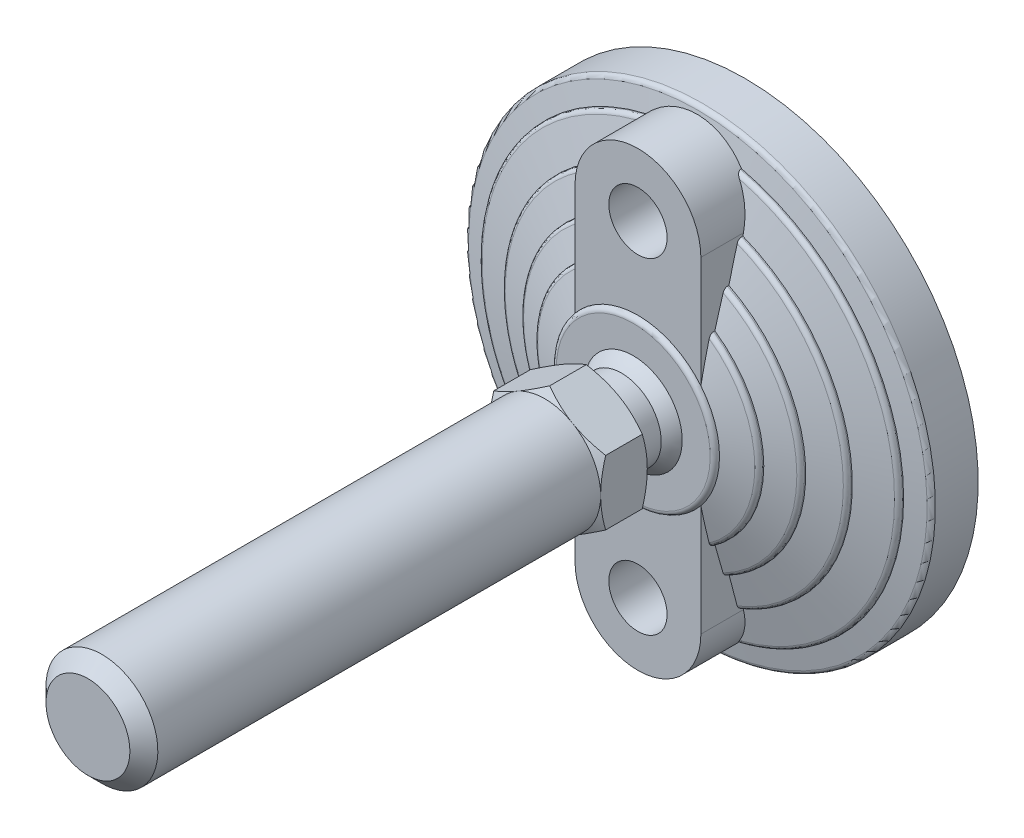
ISO-10303-21;
HEADER;
FILE_DESCRIPTION(('STEP AP214'),'2;1');
FILE_NAME('part.step','',(''),(''),'','','');
FILE_SCHEMA(('AUTOMOTIVE_DESIGN { 1 0 10303 214 1 1 1 1 }'));
ENDSEC;
DATA;
#1=APPLICATION_CONTEXT('core data for automotive mechanical design processes');
#2=APPLICATION_PROTOCOL_DEFINITION('international standard','automotive_design',2000,#1);
#3=PRODUCT_CONTEXT('',#1,'mechanical');
#4=PRODUCT('Part','Part','',(#3));
#5=PRODUCT_RELATED_PRODUCT_CATEGORY('part','',(#4));
#6=PRODUCT_DEFINITION_FORMATION('','',#4);
#7=PRODUCT_DEFINITION_CONTEXT('part definition',#1,'design');
#8=PRODUCT_DEFINITION('design','',#6,#7);
#9=PRODUCT_DEFINITION_SHAPE('','',#8);
#10=(LENGTH_UNIT() NAMED_UNIT(*) SI_UNIT(.MILLI.,.METRE.));
#11=(NAMED_UNIT(*) PLANE_ANGLE_UNIT() SI_UNIT($,.RADIAN.));
#12=(NAMED_UNIT(*) SI_UNIT($,.STERADIAN.) SOLID_ANGLE_UNIT());
#13=UNCERTAINTY_MEASURE_WITH_UNIT(LENGTH_MEASURE(1.E-05),#10,'distance_accuracy_value','');
#14=(GEOMETRIC_REPRESENTATION_CONTEXT(3) GLOBAL_UNCERTAINTY_ASSIGNED_CONTEXT((#13)) GLOBAL_UNIT_ASSIGNED_CONTEXT((#10,
#11,#12)) REPRESENTATION_CONTEXT('',''));
#15=CARTESIAN_POINT('',(0.,0.,0.));
#16=DIRECTION('',(0.,0.,1.));
#17=DIRECTION('',(1.,0.,0.));
#18=AXIS2_PLACEMENT_3D('',#15,#16,#17);
#19=CARTESIAN_POINT('',(-12.,14.022683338,36.));
#20=DIRECTION('',(0.,0.,1.));
#21=DIRECTION('',(0.,-1.,0.));
#22=AXIS2_PLACEMENT_3D('',#19,#20,#21);
#23=PLANE('',#22);
#24=CARTESIAN_POINT('',(0.,0.,36.));
#25=DIRECTION('',(0.,0.,-1.));
#26=DIRECTION('',(0.,1.,0.));
#27=AXIS2_PLACEMENT_3D('',#24,#25,#26);
#28=CIRCLE('',#27,8.5);
#29=CARTESIAN_POINT('',(0.,8.5,36.));
#30=VERTEX_POINT('',#29);
#31=EDGE_CURVE('E938',#30,#30,#28,.T.);
#32=ORIENTED_EDGE('',*,*,#31,.F.);
#33=EDGE_LOOP('',(#32));
#34=FACE_BOUND('',#33,.T.);
#35=CARTESIAN_POINT('',(0.,0.,36.));
#36=DIRECTION('',(0.,0.,1.));
#37=DIRECTION('',(0.,-1.,0.));
#38=AXIS2_PLACEMENT_3D('',#35,#36,#37);
#39=CIRCLE('',#38,12.);
#40=CARTESIAN_POINT('',(6.00000000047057,-10.3923048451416,36.));
#41=VERTEX_POINT('',#40);
#42=CARTESIAN_POINT('',(-6.00000000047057,-10.3923048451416,36.));
#43=VERTEX_POINT('',#42);
#44=EDGE_CURVE('E26',#41,#43,#39,.F.);
#45=ORIENTED_EDGE('',*,*,#44,.T.);
#46=CARTESIAN_POINT('',(-12.,0.,36.));
#47=VERTEX_POINT('',#46);
#48=EDGE_CURVE('E9',#43,#47,#39,.F.);
#49=ORIENTED_EDGE('',*,*,#48,.T.);
#50=CARTESIAN_POINT('',(-6.00000000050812,10.3923048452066,36.));
#51=VERTEX_POINT('',#50);
#52=EDGE_CURVE('E25',#47,#51,#39,.F.);
#53=ORIENTED_EDGE('',*,*,#52,.T.);
#54=CARTESIAN_POINT('',(6.00000000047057,10.3923048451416,36.));
#55=VERTEX_POINT('',#54);
#56=EDGE_CURVE('E287',#51,#55,#39,.F.);
#57=ORIENTED_EDGE('',*,*,#56,.T.);
#58=CARTESIAN_POINT('',(0.,0.,36.));
#59=DIRECTION('',(0.,0.,-1.));
#60=DIRECTION('',(0.,1.,0.));
#61=AXIS2_PLACEMENT_3D('',#58,#59,#60);
#62=CIRCLE('',#61,12.);
#63=CARTESIAN_POINT('',(12.,0.,36.));
#64=VERTEX_POINT('',#63);
#65=EDGE_CURVE('E301',#55,#64,#62,.T.);
#66=ORIENTED_EDGE('',*,*,#65,.T.);
#67=EDGE_CURVE('E310',#64,#41,#39,.F.);
#68=ORIENTED_EDGE('',*,*,#67,.T.);
#69=EDGE_LOOP('',(#45,#49,#53,#57,#66,#68));
#70=FACE_BOUND('',#69,.T.);
#71=ADVANCED_FACE('F14',(#34,#70),#23,.F.);
#72=CARTESIAN_POINT('',(-44.173478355,44.022,0.));
#73=DIRECTION('',(0.,0.,1.));
#74=DIRECTION('',(0.,-1.,0.));
#75=AXIS2_PLACEMENT_3D('',#72,#73,#74);
#76=PLANE('',#75);
#77=CARTESIAN_POINT('',(0.,0.,0.));
#78=DIRECTION('',(0.,0.,-1.));
#79=DIRECTION('',(0.,1.,0.));
#80=AXIS2_PLACEMENT_3D('',#77,#78,#79);
#81=CIRCLE('',#80,43.5);
#82=CARTESIAN_POINT('',(0.,43.5,0.));
#83=VERTEX_POINT('',#82);
#84=EDGE_CURVE('E930',#83,#83,#81,.F.);
#85=ORIENTED_EDGE('',*,*,#84,.F.);
#86=EDGE_LOOP('',(#85));
#87=FACE_BOUND('',#86,.T.);
#88=ADVANCED_FACE('F958',(#87),#76,.F.);
#89=CARTESIAN_POINT('',(0.,0.,36.));
#90=DIRECTION('',(0.,0.,-1.));
#91=DIRECTION('',(0.,1.,0.));
#92=AXIS2_PLACEMENT_3D('',#89,#90,#91);
#93=CYLINDRICAL_SURFACE('',#92,8.5);
#94=ORIENTED_EDGE('',*,*,#31,.T.);
#95=EDGE_LOOP('',(#94));
#96=FACE_BOUND('',#95,.T.);
#97=CARTESIAN_POINT('',(0.,0.,29.5000000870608));
#98=DIRECTION('',(0.,0.,-1.));
#99=DIRECTION('',(-1.,0.,0.));
#100=AXIS2_PLACEMENT_3D('',#97,#98,#99);
#101=CIRCLE('',#100,8.49999990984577);
#102=CARTESIAN_POINT('',(-8.49999990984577,0.,29.5000000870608));
#103=VERTEX_POINT('',#102);
#104=EDGE_CURVE('E926',#103,#103,#101,.T.);
#105=ORIENTED_EDGE('',*,*,#104,.F.);
#106=EDGE_LOOP('',(#105));
#107=FACE_BOUND('',#106,.T.);
#108=ADVANCED_FACE('F962',(#96,#107),#93,.T.);
#109=CARTESIAN_POINT('',(0.,0.,3.));
#110=DIRECTION('',(0.,0.,-1.));
#111=DIRECTION('',(0.,1.,0.));
#112=AXIS2_PLACEMENT_3D('',#109,#110,#111);
#113=CYLINDRICAL_SURFACE('',#112,43.5);
#114=ORIENTED_EDGE('',*,*,#84,.T.);
#115=EDGE_LOOP('',(#114));
#116=FACE_BOUND('',#115,.T.);
#117=CARTESIAN_POINT('',(0.,0.,3.));
#118=DIRECTION('',(0.,0.,-1.));
#119=DIRECTION('',(0.,1.,0.));
#120=AXIS2_PLACEMENT_3D('',#117,#118,#119);
#121=CIRCLE('',#120,43.5);
#122=CARTESIAN_POINT('',(0.,43.5,3.));
#123=VERTEX_POINT('',#122);
#124=EDGE_CURVE('E929',#123,#123,#121,.T.);
#125=ORIENTED_EDGE('',*,*,#124,.T.);
#126=EDGE_LOOP('',(#125));
#127=FACE_BOUND('',#126,.T.);
#128=ADVANCED_FACE('F417',(#116,#127),#113,.T.);
#129=CARTESIAN_POINT('',(-6.346764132,-28.675,3.));
#130=DIRECTION('',(0.,0.,1.));
#131=DIRECTION('',(0.,-1.,0.));
#132=AXIS2_PLACEMENT_3D('',#129,#130,#131);
#133=PLANE('',#132);
#134=CARTESIAN_POINT('',(0.,-35.,3.));
#135=DIRECTION('',(0.,0.,1.));
#136=DIRECTION('',(0.,-1.,0.));
#137=AXIS2_PLACEMENT_3D('',#134,#135,#136);
#138=CIRCLE('',#137,6.25);
#139=CARTESIAN_POINT('',(0.,-41.25,3.));
#140=VERTEX_POINT('',#139);
#141=EDGE_CURVE('E1023',#140,#140,#138,.T.);
#142=ORIENTED_EDGE('',*,*,#141,.T.);
#143=EDGE_LOOP('',(#142));
#144=FACE_BOUND('',#143,.T.);
#145=ADVANCED_FACE('F415',(#144),#133,.T.);
#146=CARTESIAN_POINT('',(0.,0.,20.678860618));
#147=DIRECTION('',(0.,0.,-1.));
#148=DIRECTION('',(1.,0.,0.));
#149=AXIS2_PLACEMENT_3D('',#146,#147,#148);
#150=SPHERICAL_SURFACE('',#149,12.25);
#151=CARTESIAN_POINT('',(0.,0.,27.));
#152=DIRECTION('',(0.,0.,-1.));
#153=DIRECTION('',(0.,1.,0.));
#154=AXIS2_PLACEMENT_3D('',#151,#152,#153);
#155=CIRCLE('',#154,10.4931261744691);
#156=CARTESIAN_POINT('',(0.,10.4931261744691,27.));
#157=VERTEX_POINT('',#156);
#158=EDGE_CURVE('E979',#157,#157,#155,.F.);
#159=ORIENTED_EDGE('',*,*,#158,.T.);
#160=EDGE_LOOP('',(#159));
#161=FACE_BOUND('',#160,.T.);
#162=ORIENTED_EDGE('',*,*,#104,.T.);
#163=EDGE_LOOP('',(#162));
#164=FACE_BOUND('',#163,.T.);
#165=ADVANCED_FACE('F410',(#161,#164),#150,.T.);
#166=CARTESIAN_POINT('',(-50.774113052,50.6,3.));
#167=DIRECTION('',(0.,0.,1.));
#168=DIRECTION('',(0.,-1.,0.));
#169=AXIS2_PLACEMENT_3D('',#166,#167,#168);
#170=PLANE('',#169);
#171=ORIENTED_EDGE('',*,*,#124,.F.);
#172=EDGE_LOOP('',(#171));
#173=FACE_BOUND('',#172,.T.);
#174=CARTESIAN_POINT('',(0.,0.,3.));
#175=DIRECTION('',(0.,0.,-1.));
#176=DIRECTION('',(0.,1.,0.));
#177=AXIS2_PLACEMENT_3D('',#174,#175,#176);
#178=CIRCLE('',#177,50.);
#179=CARTESIAN_POINT('',(0.,50.,3.));
#180=VERTEX_POINT('',#179);
#181=EDGE_CURVE('E456',#180,#180,#178,.F.);
#182=ORIENTED_EDGE('',*,*,#181,.F.);
#183=EDGE_LOOP('',(#182));
#184=FACE_BOUND('',#183,.T.);
#185=ADVANCED_FACE('F414',(#173,#184),#170,.F.);
#186=CARTESIAN_POINT('',(0.,-35.,3.));
#187=DIRECTION('',(0.,0.,1.));
#188=DIRECTION('',(0.,-1.,0.));
#189=AXIS2_PLACEMENT_3D('',#186,#187,#188);
#190=CYLINDRICAL_SURFACE('',#189,6.25);
#191=ORIENTED_EDGE('',*,*,#141,.F.);
#192=EDGE_LOOP('',(#191));
#193=FACE_BOUND('',#192,.T.);
#194=CARTESIAN_POINT('',(0.,-35.,26.));
#195=DIRECTION('',(0.,0.,1.));
#196=DIRECTION('',(0.,-1.,0.));
#197=AXIS2_PLACEMENT_3D('',#194,#195,#196);
#198=CIRCLE('',#197,6.25);
#199=CARTESIAN_POINT('',(0.,-41.25,26.));
#200=VERTEX_POINT('',#199);
#201=EDGE_CURVE('E903',#200,#200,#198,.T.);
#202=ORIENTED_EDGE('',*,*,#201,.T.);
#203=EDGE_LOOP('',(#202));
#204=FACE_BOUND('',#203,.T.);
#205=ADVANCED_FACE('F419',(#193,#204),#190,.F.);
#206=CARTESIAN_POINT('',(-16.755457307,-16.698,27.));
#207=DIRECTION('',(0.,0.,-1.));
#208=DIRECTION('',(0.,1.,0.));
#209=AXIS2_PLACEMENT_3D('',#206,#207,#208);
#210=PLANE('',#209);
#211=ORIENTED_EDGE('',*,*,#158,.F.);
#212=EDGE_LOOP('',(#211));
#213=FACE_BOUND('',#212,.T.);
#214=CARTESIAN_POINT('',(0.,0.,27.));
#215=DIRECTION('',(0.,0.,-1.));
#216=DIRECTION('',(0.,1.,0.));
#217=AXIS2_PLACEMENT_3D('',#214,#215,#216);
#218=CIRCLE('',#217,16.5);
#219=CARTESIAN_POINT('',(0.,16.5,27.));
#220=VERTEX_POINT('',#219);
#221=EDGE_CURVE('E902',#220,#220,#218,.T.);
#222=ORIENTED_EDGE('',*,*,#221,.F.);
#223=EDGE_LOOP('',(#222));
#224=FACE_BOUND('',#223,.T.);
#225=ADVANCED_FACE('F422',(#213,#224),#210,.F.);
#226=CARTESIAN_POINT('',(-6.346764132,41.325,3.));
#227=DIRECTION('',(0.,0.,1.));
#228=DIRECTION('',(0.,-1.,0.));
#229=AXIS2_PLACEMENT_3D('',#226,#227,#228);
#230=PLANE('',#229);
#231=CARTESIAN_POINT('',(0.,35.,3.));
#232=DIRECTION('',(0.,0.,1.));
#233=DIRECTION('',(0.,-1.,0.));
#234=AXIS2_PLACEMENT_3D('',#231,#232,#233);
#235=CIRCLE('',#234,6.25);
#236=CARTESIAN_POINT('',(0.,28.75,3.));
#237=VERTEX_POINT('',#236);
#238=EDGE_CURVE('E985',#237,#237,#235,.T.);
#239=ORIENTED_EDGE('',*,*,#238,.T.);
#240=EDGE_LOOP('',(#239));
#241=FACE_BOUND('',#240,.T.);
#242=ADVANCED_FACE('F429',(#241),#230,.T.);
#243=CARTESIAN_POINT('',(0.,0.,26.));
#244=DIRECTION('',(0.,0.,-1.));
#245=DIRECTION('',(1.,0.,0.));
#246=AXIS2_PLACEMENT_3D('',#243,#244,#245);
#247=CONICAL_SURFACE('',#246,17.5,1.27229739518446);
#248=CARTESIAN_POINT('',(0.,0.,26.));
#249=DIRECTION('',(0.,0.,1.));
#250=DIRECTION('',(0.,-1.,0.));
#251=AXIS2_PLACEMENT_3D('',#248,#249,#250);
#252=CIRCLE('',#251,17.5);
#253=CARTESIAN_POINT('',(13.5000000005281,-11.1355287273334,25.999999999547));
#254=VERTEX_POINT('',#253);
#255=CARTESIAN_POINT('',(13.5000000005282,11.1355287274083,25.9999999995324));
#256=VERTEX_POINT('',#255);
#257=EDGE_CURVE('E899',#254,#256,#252,.T.);
#258=ORIENTED_EDGE('',*,*,#257,.F.);
#259=CARTESIAN_POINT('',(13.5,-18.9832672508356,24.2172043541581));
#260=CARTESIAN_POINT('',(13.5,-18.6579649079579,24.2987714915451));
#261=CARTESIAN_POINT('',(13.5,-18.3324976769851,24.3796813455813));
#262=CARTESIAN_POINT('',(13.5,-17.6811977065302,24.5400241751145));
#263=CARTESIAN_POINT('',(13.5,-17.3553649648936,24.6194571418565));
#264=CARTESIAN_POINT('',(13.5,-16.3773825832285,24.8552688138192));
#265=CARTESIAN_POINT('',(13.5,-15.7246371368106,25.0091884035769));
#266=CARTESIAN_POINT('',(13.5,-14.4172126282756,25.3088363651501));
#267=CARTESIAN_POINT('',(13.5,-13.7625334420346,25.4545641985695));
#268=CARTESIAN_POINT('',(13.5,-12.7787974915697,25.6654071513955));
#269=CARTESIAN_POINT('',(13.5,-12.4505717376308,25.7344021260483));
#270=CARTESIAN_POINT('',(13.5,-11.7935144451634,25.8694734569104));
#271=CARTESIAN_POINT('',(13.5,-11.4646828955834,25.9355497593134));
#272=CARTESIAN_POINT('',(13.5,-11.1355287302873,25.9999999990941));
#273=B_SPLINE_CURVE_WITH_KNOTS('',3,(#259,#260,#261,#262,#263,#264,#265,#266,#267,#268,#269,
#270,#271,#272),.UNSPECIFIED.,.F.,.F.,(4,2,2,2,2,2,4),(0.,1.00611699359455,2.01223994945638,
4.02414047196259,6.03617307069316,7.04235800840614,8.04856148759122),.UNSPECIFIED.);
#274=CARTESIAN_POINT('',(13.5,-18.9832672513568,24.2172043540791));
#275=VERTEX_POINT('',#274);
#276=EDGE_CURVE('E446',#275,#254,#273,.T.);
#277=ORIENTED_EDGE('',*,*,#276,.F.);
#278=CARTESIAN_POINT('',(3.16437848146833E-10,0.,24.217204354));
#279=DIRECTION('',(0.,0.,-1.));
#280=DIRECTION('',(0.,1.,0.));
#281=AXIS2_PLACEMENT_3D('',#278,#279,#280);
#282=CIRCLE('',#281,23.2940858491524);
#283=CARTESIAN_POINT('',(13.5,18.983267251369,24.2172043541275));
#284=VERTEX_POINT('',#283);
#285=EDGE_CURVE('E407',#284,#275,#282,.T.);
#286=ORIENTED_EDGE('',*,*,#285,.F.);
#287=CARTESIAN_POINT('',(13.5,11.1355287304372,25.9999999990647));
#288=CARTESIAN_POINT('',(13.5,11.4646828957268,25.9355497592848));
#289=CARTESIAN_POINT('',(13.5,11.7935144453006,25.8694734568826));
#290=CARTESIAN_POINT('',(13.5,12.4505717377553,25.7344021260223));
#291=CARTESIAN_POINT('',(13.5,12.7787974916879,25.6654071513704));
#292=CARTESIAN_POINT('',(13.5,13.762533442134,25.4545641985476));
#293=CARTESIAN_POINT('',(13.5,14.4172126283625,25.3088363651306));
#294=CARTESIAN_POINT('',(13.5,15.7246371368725,25.0091884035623));
#295=CARTESIAN_POINT('',(13.5,16.377382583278,24.8552688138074));
#296=CARTESIAN_POINT('',(13.5,17.3553649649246,24.619457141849));
#297=CARTESIAN_POINT('',(13.5,17.681197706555,24.5400241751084));
#298=CARTESIAN_POINT('',(13.5,18.3324976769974,24.3796813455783));
#299=CARTESIAN_POINT('',(13.5,18.6579649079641,24.2987714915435));
#300=CARTESIAN_POINT('',(13.5,18.9832672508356,24.2172043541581));
#301=B_SPLINE_CURVE_WITH_KNOTS('',3,(#287,#288,#289,#290,#291,#292,#293,#294,#295,#296,#297,
#298,#299,#300),.UNSPECIFIED.,.F.,.F.,(4,2,2,2,2,2,4),(0.,1.00620347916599,2.01238841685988,
4.02442101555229,6.03632153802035,7.04244449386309,8.04856148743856),.UNSPECIFIED.);
#302=EDGE_CURVE('E437',#256,#284,#301,.T.);
#303=ORIENTED_EDGE('',*,*,#302,.F.);
#304=EDGE_LOOP('',(#258,#277,#286,#303));
#305=FACE_BOUND('',#304,.T.);
#306=ADVANCED_FACE('F424',(#305),#247,.T.);
#307=CARTESIAN_POINT('',(13.267303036,19.999466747,23.261425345));
#308=CARTESIAN_POINT('',(29.097194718,9.49818825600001,23.261425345));
#309=CARTESIAN_POINT('',(29.097194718,-9.49818825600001,23.261425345));
#310=CARTESIAN_POINT('',(13.267303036,-19.999466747,23.261425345));
#311=CARTESIAN_POINT('',(13.267303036,19.999466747,23.716888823));
#312=CARTESIAN_POINT('',(29.097194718,9.49818825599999,23.716888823));
#313=CARTESIAN_POINT('',(29.097194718,-9.49818825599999,23.716888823));
#314=CARTESIAN_POINT('',(13.267303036,-19.999466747,23.716888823));
#315=CARTESIAN_POINT('',(13.117718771,19.773979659,24.083258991));
#316=CARTESIAN_POINT('',(28.769133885,9.39109946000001,24.083258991));
#317=CARTESIAN_POINT('',(28.769133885,-9.39109946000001,24.083258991));
#318=CARTESIAN_POINT('',(13.117718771,-19.773979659,24.083258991));
#319=CARTESIAN_POINT('',(12.877070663,19.411220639,24.217204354));
#320=CARTESIAN_POINT('',(28.241356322,9.218817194,24.217204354));
#321=CARTESIAN_POINT('',(28.241356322,-9.218817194,24.217204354));
#322=CARTESIAN_POINT('',(12.877070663,-19.411220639,24.217204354));
#323=(BOUNDED_SURFACE() B_SPLINE_SURFACE(3,3,((#307,#308,#309,#310),(#311,#312,#313,#314),(#315,
#316,#317,#318),(#319,#320,#321,#322)),.UNSPECIFIED.,.F.,.F.,
.F.) B_SPLINE_SURFACE_WITH_KNOTS((4,4),(4,4),(0.,1.),(0.,1.),
.UNSPECIFIED.) GEOMETRIC_REPRESENTATION_ITEM() RATIONAL_B_SPLINE_SURFACE(((1.,0.701869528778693,
0.701869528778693,1.),(0.86959318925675,0.610340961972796,0.610340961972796,0.86959318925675),
(0.86959318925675,0.610340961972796,0.610340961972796,0.86959318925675),(1.,0.701869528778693,
0.701869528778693,1.))) REPRESENTATION_ITEM('') SURFACE());
#324=CARTESIAN_POINT('',(13.5,-19.8431348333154,23.2614253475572));
#325=CARTESIAN_POINT('',(13.5,-19.8431370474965,23.2860556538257));
#326=CARTESIAN_POINT('',(13.5,-19.8420333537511,23.3106726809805));
#327=CARTESIAN_POINT('',(13.5,-19.8376465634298,23.3597018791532));
#328=CARTESIAN_POINT('',(13.5,-19.8343643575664,23.3841141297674));
#329=CARTESIAN_POINT('',(13.5,-19.8213486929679,23.4565201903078));
#330=CARTESIAN_POINT('',(13.5,-19.8084453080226,23.5039784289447));
#331=CARTESIAN_POINT('',(13.5,-19.7748969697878,23.5959548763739));
#332=CARTESIAN_POINT('',(13.5,-19.7542611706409,23.6404764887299));
#333=CARTESIAN_POINT('',(13.5,-19.7062220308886,23.7257350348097));
#334=CARTESIAN_POINT('',(13.5,-19.6788120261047,23.7664681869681));
#335=CARTESIAN_POINT('',(13.5,-19.6164784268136,23.8458096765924));
#336=CARTESIAN_POINT('',(13.5,-19.5811980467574,23.8841360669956));
#337=CARTESIAN_POINT('',(13.5,-19.5055204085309,23.9553392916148));
#338=CARTESIAN_POINT('',(13.5,-19.465120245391,23.9882130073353));
#339=CARTESIAN_POINT('',(13.5,-19.3733614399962,24.0532792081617));
#340=CARTESIAN_POINT('',(13.5,-19.321293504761,24.0844693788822));
#341=CARTESIAN_POINT('',(13.5,-19.2133323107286,24.139175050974));
#342=CARTESIAN_POINT('',(13.5,-19.1574401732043,24.1626927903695));
#343=CARTESIAN_POINT('',(13.5,-19.0617819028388,24.1957297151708));
#344=CARTESIAN_POINT('',(13.5,-19.022719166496,24.207311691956));
#345=CARTESIAN_POINT('',(13.5,-18.9832672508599,24.2172043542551));
#346=B_SPLINE_CURVE_WITH_KNOTS('',3,(#324,#325,#326,#327,#328,#329,#330,#331,#332,#333,#334,
#335,#336,#337,#338,#339,#340,#341,#342,#343,#344,#345),.UNSPECIFIED.,.F.,.F.,(4,2,2,2,2,2,2,2,
2,2,4),(0.,0.073840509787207,0.147650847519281,0.29439860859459,0.440973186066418,
0.587692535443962,0.743377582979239,0.899151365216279,1.08055916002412,1.26191399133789,
1.38396481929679),.UNSPECIFIED.);
#347=CARTESIAN_POINT('',(13.5,-19.8431348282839,23.2614253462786));
#348=VERTEX_POINT('',#347);
#349=EDGE_CURVE('E489',#348,#275,#346,.T.);
#350=CARTESIAN_POINT('',(0.,0.,23.261425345));
#351=DIRECTION('',(0.,0.,-1.));
#352=DIRECTION('',(0.,1.,0.));
#353=AXIS2_PLACEMENT_3D('',#350,#351,#352);
#354=CIRCLE('',#353,24.);
#355=CARTESIAN_POINT('',(13.5,19.8431348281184,23.2614253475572));
#356=VERTEX_POINT('',#355);
#357=EDGE_CURVE('E924',#356,#348,#354,.T.);
#358=CARTESIAN_POINT('',(13.5,18.9832672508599,24.2172043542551));
#359=CARTESIAN_POINT('',(13.5,19.0245269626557,24.2068474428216));
#360=CARTESIAN_POINT('',(13.5,19.0653049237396,24.1946763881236));
#361=CARTESIAN_POINT('',(13.5,19.1456358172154,24.1665827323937));
#362=CARTESIAN_POINT('',(13.5,19.1851861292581,24.1506526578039));
#363=CARTESIAN_POINT('',(13.5,19.3016874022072,24.0969581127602));
#364=CARTESIAN_POINT('',(13.5,19.3761277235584,24.0533765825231));
#365=CARTESIAN_POINT('',(13.5,19.4913457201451,23.9675664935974));
#366=CARTESIAN_POINT('',(13.5,19.5352290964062,23.9294496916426));
#367=CARTESIAN_POINT('',(13.5,19.6161219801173,23.8466003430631));
#368=CARTESIAN_POINT('',(13.5,19.6531483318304,23.8018845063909));
#369=CARTESIAN_POINT('',(13.5,19.7189344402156,23.7060840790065));
#370=CARTESIAN_POINT('',(13.5,19.747615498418,23.6549449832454));
#371=CARTESIAN_POINT('',(13.5,19.7944064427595,23.5480322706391));
#372=CARTESIAN_POINT('',(13.5,19.8125331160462,23.4922661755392));
#373=CARTESIAN_POINT('',(13.5,19.8308153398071,23.4067306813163));
#374=CARTESIAN_POINT('',(13.5,19.8354249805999,23.3778585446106));
#375=CARTESIAN_POINT('',(13.5,19.8415861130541,23.3198066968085));
#376=CARTESIAN_POINT('',(13.5,19.8431393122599,23.2906271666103));
#377=CARTESIAN_POINT('',(13.5,19.8431348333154,23.2614253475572));
#378=B_SPLINE_CURVE_WITH_KNOTS('',3,(#358,#359,#360,#361,#362,#363,#364,#365,#366,#367,#368,
#369,#370,#371,#372,#373,#374,#375,#376,#377),.UNSPECIFIED.,.F.,.F.,(4,2,2,2,2,2,2,2,2,4),(0.,
0.127516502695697,0.255288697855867,0.511930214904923,0.685657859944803,0.858952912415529,
1.0338328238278,1.20843381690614,1.29600438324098,1.38352601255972),.UNSPECIFIED.);
#379=EDGE_CURVE('E563',#284,#356,#378,.T.);
#380=ORIENTED_EDGE('',*,*,#285,.T.);
#381=ORIENTED_EDGE('',*,*,#349,.F.);
#382=ORIENTED_EDGE('',*,*,#357,.F.);
#383=ORIENTED_EDGE('',*,*,#379,.F.);
#384=EDGE_LOOP('',(#380,#381,#382,#383));
#385=FACE_BOUND('',#384,.T.);
#386=ADVANCED_FACE('F428',(#385),#323,.T.);
#387=CARTESIAN_POINT('',(0.,0.,23.261425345));
#388=DIRECTION('',(0.,0.,-1.));
#389=DIRECTION('',(0.,1.,0.));
#390=AXIS2_PLACEMENT_3D('',#387,#388,#389);
#391=CYLINDRICAL_SURFACE('',#390,24.);
#392=CARTESIAN_POINT('',(0.,0.,23.));
#393=DIRECTION('',(0.,0.,-1.));
#394=DIRECTION('',(0.,1.,0.));
#395=AXIS2_PLACEMENT_3D('',#392,#393,#394);
#396=CIRCLE('',#395,24.);
#397=CARTESIAN_POINT('',(13.5,19.8431348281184,23.));
#398=VERTEX_POINT('',#397);
#399=CARTESIAN_POINT('',(13.5,-19.8431348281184,23.000000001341));
#400=VERTEX_POINT('',#399);
#401=EDGE_CURVE('E922',#398,#400,#396,.T.);
#402=ORIENTED_EDGE('',*,*,#401,.F.);
#403=DIRECTION('',(0.,0.,-1.));
#404=VECTOR('',#403,1.);
#405=CARTESIAN_POINT('',(13.5,19.8431348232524,21.4084486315));
#406=LINE('',#405,#404);
#407=EDGE_CURVE('E584',#356,#398,#406,.T.);
#408=ORIENTED_EDGE('',*,*,#407,.F.);
#409=ORIENTED_EDGE('',*,*,#357,.T.);
#410=DIRECTION('',(0.,0.,1.));
#411=VECTOR('',#410,1.);
#412=CARTESIAN_POINT('',(13.5,-19.8431348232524,21.4084486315));
#413=LINE('',#412,#411);
#414=EDGE_CURVE('E993',#400,#348,#413,.T.);
#415=ORIENTED_EDGE('',*,*,#414,.F.);
#416=EDGE_LOOP('',(#402,#408,#409,#415));
#417=FACE_BOUND('',#416,.T.);
#418=ADVANCED_FACE('F589',(#417),#391,.T.);
#419=CARTESIAN_POINT('',(0.,0.,23.));
#420=DIRECTION('',(0.,0.,-1.));
#421=DIRECTION('',(0.,1.,0.));
#422=AXIS2_PLACEMENT_3D('',#419,#420,#421);
#423=CONICAL_SURFACE('',#422,24.,1.24904577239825);
#424=ORIENTED_EDGE('',*,*,#401,.T.);
#425=CARTESIAN_POINT('',(13.5,-26.022897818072,21.2279240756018));
#426=CARTESIAN_POINT('',(13.5,-25.5091656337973,21.3799212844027));
#427=CARTESIAN_POINT('',(13.5,-24.9951778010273,21.5310587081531));
#428=CARTESIAN_POINT('',(13.5,-23.9666187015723,21.8312926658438));
#429=CARTESIAN_POINT('',(13.5,-23.4520474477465,21.9803892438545));
#430=CARTESIAN_POINT('',(13.5,-22.4222240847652,22.2762276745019));
#431=CARTESIAN_POINT('',(13.5,-21.9069719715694,22.422969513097));
#432=CARTESIAN_POINT('',(13.5,-20.8756730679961,22.713675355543));
#433=CARTESIAN_POINT('',(13.5,-20.3596262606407,22.8576392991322));
#434=CARTESIAN_POINT('',(13.5,-19.8431348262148,23.0000000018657));
#435=B_SPLINE_CURVE_WITH_KNOTS('',3,(#425,#426,#427,#428,#429,#430,#431,#432,#433,#434),
.UNSPECIFIED.,.F.,.F.,(4,2,2,2,4),(0.,1.60723934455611,3.21444392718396,4.82165809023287,
6.42890708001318),.UNSPECIFIED.);
#436=CARTESIAN_POINT('',(13.5,-26.0228978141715,21.2279240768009));
#437=VERTEX_POINT('',#436);
#438=EDGE_CURVE('E497',#437,#400,#435,.T.);
#439=ORIENTED_EDGE('',*,*,#438,.F.);
#440=CARTESIAN_POINT('',(-5.51340223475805E-10,0.,21.227924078));
#441=DIRECTION('',(0.,0.,-1.));
#442=DIRECTION('',(0.,1.,0.));
#443=AXIS2_PLACEMENT_3D('',#440,#441,#442);
#444=CIRCLE('',#443,29.3162277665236);
#445=CARTESIAN_POINT('',(13.5,26.0228978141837,21.2279240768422));
#446=VERTEX_POINT('',#445);
#447=EDGE_CURVE('E921',#446,#437,#444,.T.);
#448=ORIENTED_EDGE('',*,*,#447,.F.);
#449=CARTESIAN_POINT('',(13.5000000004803,19.8431348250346,23.0000000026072));
#450=CARTESIAN_POINT('',(13.5000000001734,20.3596262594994,22.8576392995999));
#451=CARTESIAN_POINT('',(13.5000000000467,20.8756730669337,22.7136753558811));
#452=CARTESIAN_POINT('',(13.4999999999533,21.9069719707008,22.4229695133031));
#453=CARTESIAN_POINT('',(13.4999999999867,22.4222240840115,22.2762276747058));
#454=CARTESIAN_POINT('',(13.5000000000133,23.4520474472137,21.9803892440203));
#455=CARTESIAN_POINT('',(13.5000000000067,23.9666187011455,21.8312926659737));
#456=CARTESIAN_POINT('',(13.4999999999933,24.995177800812,21.5310587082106));
#457=CARTESIAN_POINT('',(13.4999999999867,25.5091656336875,21.3799212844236));
#458=CARTESIAN_POINT('',(13.5,26.022897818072,21.2279240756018));
#459=B_SPLINE_CURVE_WITH_KNOTS('',3,(#449,#450,#451,#452,#453,#454,#455,#456,#457,#458),
.UNSPECIFIED.,.F.,.F.,(4,2,2,2,4),(0.,1.60724899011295,3.2144631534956,4.82166773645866,
6.42890708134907),.UNSPECIFIED.);
#460=EDGE_CURVE('E578',#398,#446,#459,.T.);
#461=ORIENTED_EDGE('',*,*,#460,.F.);
#462=EDGE_LOOP('',(#424,#439,#448,#461));
#463=FACE_BOUND('',#462,.T.);
#464=ADVANCED_FACE('F585',(#463),#423,.T.);
#465=CARTESIAN_POINT('',(13.143890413,26.967353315,20.27924078));
#466=CARTESIAN_POINT('',(38.983891,14.372934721,20.27924078));
#467=CARTESIAN_POINT('',(38.983891,-14.372934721,20.27924078));
#468=CARTESIAN_POINT('',(13.143890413,-26.967353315,20.27924078));
#469=CARTESIAN_POINT('',(13.143890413,26.967353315,20.725161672));
#470=CARTESIAN_POINT('',(38.983891,14.372934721,20.725161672));
#471=CARTESIAN_POINT('',(38.983891,-14.372934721,20.725161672));
#472=CARTESIAN_POINT('',(13.143890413,-26.967353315,20.725161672));
#473=CARTESIAN_POINT('',(13.029654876,26.732975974,21.086911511));
#474=CARTESIAN_POINT('',(38.645076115,14.248017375,21.086911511));
#475=CARTESIAN_POINT('',(38.645076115,-14.248017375,21.086911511));
#476=CARTESIAN_POINT('',(13.029654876,-26.732975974,21.086911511));
#477=CARTESIAN_POINT('',(12.844309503,26.352702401,21.227924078));
#478=CARTESIAN_POINT('',(38.095354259,14.045340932,21.227924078));
#479=CARTESIAN_POINT('',(38.095354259,-14.045340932,21.227924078));
#480=CARTESIAN_POINT('',(12.844309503,-26.352702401,21.227924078));
#481=(BOUNDED_SURFACE() B_SPLINE_SURFACE(3,3,((#465,#466,#467,#468),(#469,#470,#471,#472),(#473,
#474,#475,#476),(#477,#478,#479,#480)),.UNSPECIFIED.,.F.,.F.,
.F.) B_SPLINE_SURFACE_WITH_KNOTS((4,4),(4,4),(0.,1.),(0.,1.),
.UNSPECIFIED.) GEOMETRIC_REPRESENTATION_ITEM() RATIONAL_B_SPLINE_SURFACE(((1.,0.625419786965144,
0.625419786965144,1.),(0.874161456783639,0.546717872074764,0.546717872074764,0.874161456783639),
(0.874161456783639,0.546717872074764,0.546717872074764,0.874161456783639),(1.,0.625419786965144,
0.625419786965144,1.))) REPRESENTATION_ITEM('') SURFACE());
#482=CARTESIAN_POINT('',(13.5,-26.7908566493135,20.2792407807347));
#483=CARTESIAN_POINT('',(13.5,-26.7908579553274,20.3051907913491));
#484=CARTESIAN_POINT('',(13.5,-26.7897247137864,20.3311275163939));
#485=CARTESIAN_POINT('',(13.5,-26.7852140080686,20.3827974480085));
#486=CARTESIAN_POINT('',(13.5,-26.781837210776,20.4085307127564));
#487=CARTESIAN_POINT('',(13.5,-26.7684139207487,20.4849772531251));
#488=CARTESIAN_POINT('',(13.5,-26.7550740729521,20.5351491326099));
#489=CARTESIAN_POINT('',(13.5,-26.7202107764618,20.632486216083));
#490=CARTESIAN_POINT('',(13.5,-26.6986916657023,20.6796529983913));
#491=CARTESIAN_POINT('',(13.5,-26.648348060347,20.7699105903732));
#492=CARTESIAN_POINT('',(13.5,-26.6195218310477,20.8130004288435));
#493=CARTESIAN_POINT('',(13.5,-26.5542840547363,20.8959059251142));
#494=CARTESIAN_POINT('',(13.5,-26.5176080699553,20.9355124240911));
#495=CARTESIAN_POINT('',(13.5,-26.4386436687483,21.0087234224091));
#496=CARTESIAN_POINT('',(13.5,-26.3963509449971,21.0423232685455));
#497=CARTESIAN_POINT('',(13.5,-26.3267001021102,21.0898793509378));
#498=CARTESIAN_POINT('',(13.5,-26.3008113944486,21.106038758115));
#499=CARTESIAN_POINT('',(13.5,-26.2478537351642,21.1362297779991));
#500=CARTESIAN_POINT('',(13.5,-26.2207861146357,21.1502637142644));
#501=CARTESIAN_POINT('',(13.5,-26.1657188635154,21.176151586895));
#502=CARTESIAN_POINT('',(13.5,-26.1377218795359,21.1880111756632));
#503=CARTESIAN_POINT('',(13.5,-26.0808891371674,21.2095853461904));
#504=CARTESIAN_POINT('',(13.5,-26.0520527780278,21.2192983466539));
#505=CARTESIAN_POINT('',(13.5,-26.0228978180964,21.2279240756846));
#506=B_SPLINE_CURVE_WITH_KNOTS('',3,(#482,#483,#484,#485,#486,#487,#488,#489,#490,#491,#492,
#493,#494,#495,#496,#497,#498,#499,#500,#501,#502,#503,#504,#505),.UNSPECIFIED.,.F.,.F.,(4,2,2,
2,2,2,2,2,2,2,2,4),(0.,0.0777993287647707,0.155575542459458,0.310500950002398,0.465344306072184,
0.620224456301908,0.781511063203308,0.94292207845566,1.03439248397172,1.12576216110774,
1.21689083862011,1.30808642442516),.UNSPECIFIED.);
#507=CARTESIAN_POINT('',(13.5,-26.7908566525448,20.27924078));
#508=VERTEX_POINT('',#507);
#509=EDGE_CURVE('E505',#508,#437,#506,.T.);
#510=CARTESIAN_POINT('',(0.,0.,20.27924078));
#511=DIRECTION('',(0.,0.,-1.));
#512=DIRECTION('',(0.,1.,0.));
#513=AXIS2_PLACEMENT_3D('',#510,#511,#512);
#514=CIRCLE('',#513,30.);
#515=CARTESIAN_POINT('',(13.5,26.7908566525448,20.2792407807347));
#516=VERTEX_POINT('',#515);
#517=EDGE_CURVE('E919',#516,#508,#514,.T.);
#518=CARTESIAN_POINT('',(13.5,26.0228978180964,21.2279240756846));
#519=CARTESIAN_POINT('',(13.5,26.0845570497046,21.2097134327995));
#520=CARTESIAN_POINT('',(13.5,26.1448460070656,21.1865640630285));
#521=CARTESIAN_POINT('',(13.5,26.2611194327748,21.1305926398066));
#522=CARTESIAN_POINT('',(13.5,26.3170802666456,21.0977216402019));
#523=CARTESIAN_POINT('',(13.5,26.422621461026,21.022592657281));
#524=CARTESIAN_POINT('',(13.5,26.4721821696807,20.9803067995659));
#525=CARTESIAN_POINT('',(13.5,26.5625156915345,20.887307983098));
#526=CARTESIAN_POINT('',(13.5,26.6033065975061,20.8366127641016));
#527=CARTESIAN_POINT('',(13.5,26.6708532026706,20.7331354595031));
#528=CARTESIAN_POINT('',(13.5,26.6985518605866,20.6809691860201));
#529=CARTESIAN_POINT('',(13.5,26.743619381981,20.5723560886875));
#530=CARTESIAN_POINT('',(13.5,26.7610021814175,20.5159151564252));
#531=CARTESIAN_POINT('',(13.5,26.7787549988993,20.4289072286));
#532=CARTESIAN_POINT('',(13.5,26.78328761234,20.399138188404));
#533=CARTESIAN_POINT('',(13.5,26.78933789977,20.3393328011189));
#534=CARTESIAN_POINT('',(13.5,26.7908592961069,20.3092968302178));
#535=CARTESIAN_POINT('',(13.5,26.7908566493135,20.2792407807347));
#536=B_SPLINE_CURVE_WITH_KNOTS('',3,(#518,#519,#520,#521,#522,#523,#524,#525,#526,#527,#528,
#529,#530,#531,#532,#533,#534,#535),.UNSPECIFIED.,.F.,.F.,(4,2,2,2,2,2,2,2,4),(0.,
0.192810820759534,0.386609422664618,0.580989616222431,0.774964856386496,0.95118401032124,
1.12716456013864,1.21736691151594,1.30745768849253),.UNSPECIFIED.);
#537=EDGE_CURVE('E545',#446,#516,#536,.T.);
#538=ORIENTED_EDGE('',*,*,#447,.T.);
#539=ORIENTED_EDGE('',*,*,#509,.F.);
#540=ORIENTED_EDGE('',*,*,#517,.F.);
#541=ORIENTED_EDGE('',*,*,#537,.F.);
#542=EDGE_LOOP('',(#538,#539,#540,#541));
#543=FACE_BOUND('',#542,.T.);
#544=ADVANCED_FACE('F588',(#543),#481,.T.);
#545=CARTESIAN_POINT('',(0.,0.,20.27924078));
#546=DIRECTION('',(0.,0.,-1.));
#547=DIRECTION('',(0.,1.,0.));
#548=AXIS2_PLACEMENT_3D('',#545,#546,#547);
#549=CYLINDRICAL_SURFACE('',#548,30.);
#550=CARTESIAN_POINT('',(0.,0.,20.));
#551=DIRECTION('',(0.,0.,-1.));
#552=DIRECTION('',(0.,1.,0.));
#553=AXIS2_PLACEMENT_3D('',#550,#551,#552);
#554=CIRCLE('',#553,30.);
#555=CARTESIAN_POINT('',(13.5,26.7908566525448,20.));
#556=VERTEX_POINT('',#555);
#557=CARTESIAN_POINT('',(13.5,-26.7908566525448,19.9999999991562));
#558=VERTEX_POINT('',#557);
#559=EDGE_CURVE('E917',#556,#558,#554,.T.);
#560=ORIENTED_EDGE('',*,*,#559,.F.);
#561=DIRECTION('',(0.,0.,-1.));
#562=VECTOR('',#561,1.);
#563=CARTESIAN_POINT('',(13.5,26.7908566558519,21.4084486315));
#564=LINE('',#563,#562);
#565=EDGE_CURVE('E540',#516,#556,#564,.T.);
#566=ORIENTED_EDGE('',*,*,#565,.F.);
#567=ORIENTED_EDGE('',*,*,#517,.T.);
#568=DIRECTION('',(0.,0.,1.));
#569=VECTOR('',#568,1.);
#570=CARTESIAN_POINT('',(13.5,-26.7908566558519,21.4084486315));
#571=LINE('',#570,#569);
#572=EDGE_CURVE('E518',#558,#508,#571,.T.);
#573=ORIENTED_EDGE('',*,*,#572,.F.);
#574=EDGE_LOOP('',(#560,#566,#567,#573));
#575=FACE_BOUND('',#574,.T.);
#576=ADVANCED_FACE('F524',(#575),#549,.T.);
#577=CARTESIAN_POINT('',(0.,0.,20.));
#578=DIRECTION('',(0.,0.,-1.));
#579=DIRECTION('',(1.,0.,0.));
#580=AXIS2_PLACEMENT_3D('',#577,#578,#579);
#581=CONICAL_SURFACE('',#580,30.,1.29249666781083);
#582=ORIENTED_EDGE('',*,*,#559,.T.);
#583=CARTESIAN_POINT('',(13.5000000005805,-33.6690568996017,18.2072225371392));
#584=CARTESIAN_POINT('',(13.5000000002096,-33.0965095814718,18.3590521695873));
#585=CARTESIAN_POINT('',(13.5000000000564,-32.5238313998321,18.5103895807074));
#586=CARTESIAN_POINT('',(13.4999999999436,-31.3781752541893,18.8119124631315));
#587=CARTESIAN_POINT('',(13.4999999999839,-30.8051972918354,18.9620979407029));
#588=CARTESIAN_POINT('',(13.5000000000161,-29.6588964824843,19.2611513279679));
#589=CARTESIAN_POINT('',(13.5000000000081,-29.0855736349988,19.4100192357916));
#590=CARTESIAN_POINT('',(13.4999999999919,-27.9385277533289,19.7062178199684));
#591=CARTESIAN_POINT('',(13.4999999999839,-27.3648047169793,19.8535484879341));
#592=CARTESIAN_POINT('',(13.5,-26.7908566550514,19.9999999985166));
#593=B_SPLINE_CURVE_WITH_KNOTS('',3,(#583,#584,#585,#586,#587,#588,#589,#590,#591,#592),
.UNSPECIFIED.,.F.,.F.,(4,2,2,2,4),(0.,1.7770100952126,3.55401051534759,5.33101345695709,
7.10802608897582),.UNSPECIFIED.);
#594=CARTESIAN_POINT('',(13.5,-33.6690569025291,18.2072225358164));
#595=VERTEX_POINT('',#594);
#596=EDGE_CURVE('E511',#595,#558,#593,.T.);
#597=ORIENTED_EDGE('',*,*,#596,.F.);
#598=CARTESIAN_POINT('',(3.08438170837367E-10,0.,18.207222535));
#599=DIRECTION('',(0.,0.,-1.));
#600=DIRECTION('',(0.,1.,0.));
#601=AXIS2_PLACEMENT_3D('',#598,#599,#600);
#602=CIRCLE('',#601,36.2747211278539);
#603=CARTESIAN_POINT('',(13.5,33.6690569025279,18.2072225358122));
#604=VERTEX_POINT('',#603);
#605=EDGE_CURVE('E916',#604,#595,#602,.T.);
#606=ORIENTED_EDGE('',*,*,#605,.F.);
#607=CARTESIAN_POINT('',(13.5000000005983,26.790856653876,19.9999999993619));
#608=CARTESIAN_POINT('',(13.5000000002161,27.3648047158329,19.85354848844));
#609=CARTESIAN_POINT('',(13.5000000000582,27.9385277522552,19.7062178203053));
#610=CARTESIAN_POINT('',(13.4999999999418,29.0855736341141,19.4100192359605));
#611=CARTESIAN_POINT('',(13.4999999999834,29.6588964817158,19.2611513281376));
#612=CARTESIAN_POINT('',(13.5000000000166,30.8051972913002,18.9620979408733));
#613=CARTESIAN_POINT('',(13.5000000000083,31.378175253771,18.8119124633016));
#614=CARTESIAN_POINT('',(13.4999999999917,32.523831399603,18.5103895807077));
#615=CARTESIAN_POINT('',(13.4999999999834,33.0965095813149,18.359052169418));
#616=CARTESIAN_POINT('',(13.5,33.6690568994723,18.2072225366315));
#617=B_SPLINE_CURVE_WITH_KNOTS('',3,(#607,#608,#609,#610,#611,#612,#613,#614,#615,#616),
.UNSPECIFIED.,.F.,.F.,(4,2,2,2,4),(0.,1.77701263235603,3.55401557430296,5.3310159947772,
7.10802609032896),.UNSPECIFIED.);
#618=EDGE_CURVE('E532',#556,#604,#617,.T.);
#619=ORIENTED_EDGE('',*,*,#618,.F.);
#620=EDGE_LOOP('',(#582,#597,#606,#619));
#621=FACE_BOUND('',#620,.T.);
#622=ADVANCED_FACE('F519',(#621),#581,.T.);
#623=CARTESIAN_POINT('',(13.003667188,34.639639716,17.245698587));
#624=CARTESIAN_POINT('',(51.0914438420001,20.341547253,17.245698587));
#625=CARTESIAN_POINT('',(51.0914438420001,-20.341547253,17.245698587));
#626=CARTESIAN_POINT('',(13.003667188,-34.639639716,17.245698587));
#627=CARTESIAN_POINT('',(13.003667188,34.639639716,17.709515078));
#628=CARTESIAN_POINT('',(51.091443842,20.341547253,17.709515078));
#629=CARTESIAN_POINT('',(51.091443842,-20.341547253,17.709515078));
#630=CARTESIAN_POINT('',(13.003667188,-34.639639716,17.709515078));
#631=CARTESIAN_POINT('',(12.905504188,34.378149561,18.079802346));
#632=CARTESIAN_POINT('',(50.7057611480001,20.187991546,18.079802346));
#633=CARTESIAN_POINT('',(50.7057611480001,-20.187991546,18.079802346));
#634=CARTESIAN_POINT('',(12.905504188,-34.378149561,18.079802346));
#635=CARTESIAN_POINT('',(12.748767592,33.960628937,18.207222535));
#636=CARTESIAN_POINT('',(50.089942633,19.942809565,18.207222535));
#637=CARTESIAN_POINT('',(50.089942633,-19.942809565,18.207222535));
#638=CARTESIAN_POINT('',(12.748767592,-33.960628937,18.207222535));
#639=(BOUNDED_SURFACE() B_SPLINE_SURFACE(3,3,((#623,#624,#625,#626),(#627,#628,#629,#630),(#631,
#632,#633,#634),(#635,#636,#637,#638)),.UNSPECIFIED.,.F.,.F.,
.F.) B_SPLINE_SURFACE_WITH_KNOTS((4,4),(4,4),(0.,1.),(0.,1.),
.UNSPECIFIED.) GEOMETRIC_REPRESENTATION_ITEM() RATIONAL_B_SPLINE_SURFACE(((1.,0.567633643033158,
0.567633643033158,1.),(0.865565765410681,0.491324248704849,0.491324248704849,0.865565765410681),
(0.865565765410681,0.491324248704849,0.491324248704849,0.865565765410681),(1.,0.567633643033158,
0.567633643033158,1.))) REPRESENTATION_ITEM('') SURFACE());
#640=CARTESIAN_POINT('',(13.5,-34.4492380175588,17.2456985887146));
#641=CARTESIAN_POINT('',(13.5,-34.4492388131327,17.2724185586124));
#642=CARTESIAN_POINT('',(13.5,-34.4480869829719,17.2991252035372));
#643=CARTESIAN_POINT('',(13.5,-34.4434985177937,17.3523366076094));
#644=CARTESIAN_POINT('',(13.5,-34.4400623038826,17.3788414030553));
#645=CARTESIAN_POINT('',(13.5,-34.42638545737,17.457641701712));
#646=CARTESIAN_POINT('',(13.5,-34.4127763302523,17.5093910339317));
#647=CARTESIAN_POINT('',(13.5,-34.3771048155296,17.6098360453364));
#648=CARTESIAN_POINT('',(13.5,-34.3550440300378,17.6585323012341));
#649=CARTESIAN_POINT('',(13.5,-34.3032810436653,17.7516688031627));
#650=CARTESIAN_POINT('',(13.5,-34.2735788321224,17.7961090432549));
#651=CARTESIAN_POINT('',(13.5,-34.2066078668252,17.8808807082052));
#652=CARTESIAN_POINT('',(13.5,-34.1691521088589,17.9210639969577));
#653=CARTESIAN_POINT('',(13.5,-34.0883643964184,17.9950807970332));
#654=CARTESIAN_POINT('',(13.5,-34.045025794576,18.0289070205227));
#655=CARTESIAN_POINT('',(13.5,-33.9488589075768,18.0927883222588));
#656=CARTESIAN_POINT('',(13.5,-33.8955116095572,18.1220613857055));
#657=CARTESIAN_POINT('',(13.5,-33.7848588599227,18.1715344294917));
#658=CARTESIAN_POINT('',(13.5,-33.727559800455,18.1917486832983));
#659=CARTESIAN_POINT('',(13.5,-33.6690568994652,18.2072225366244));
#660=B_SPLINE_CURVE_WITH_KNOTS('',3,(#640,#641,#642,#643,#644,#645,#646,#647,#648,#649,#650,
#651,#652,#653,#654,#655,#656,#657,#658,#659),.UNSPECIFIED.,.F.,.F.,(4,2,2,2,2,2,2,2,2,4),(0.,
0.0801088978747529,0.160203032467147,0.319894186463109,0.479555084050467,0.639216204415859,
0.803305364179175,0.967581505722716,1.14930395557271,1.33073905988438),.UNSPECIFIED.);
#661=CARTESIAN_POINT('',(13.5,-34.4492380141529,17.2456985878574));
#662=VERTEX_POINT('',#661);
#663=EDGE_CURVE('E457',#662,#595,#660,.T.);
#664=CARTESIAN_POINT('',(0.,0.,17.245698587));
#665=DIRECTION('',(0.,0.,-1.));
#666=DIRECTION('',(0.,1.,0.));
#667=AXIS2_PLACEMENT_3D('',#664,#665,#666);
#668=CIRCLE('',#667,37.);
#669=CARTESIAN_POINT('',(13.5,34.4492380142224,17.2456985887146));
#670=VERTEX_POINT('',#669);
#671=EDGE_CURVE('E914',#670,#662,#668,.T.);
#672=CARTESIAN_POINT('',(13.5,33.6690568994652,18.2072225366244));
#673=CARTESIAN_POINT('',(13.5,33.7285004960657,18.1914984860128));
#674=CARTESIAN_POINT('',(13.5,33.7866931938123,18.1708859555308));
#675=CARTESIAN_POINT('',(13.5,33.8990439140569,18.1203027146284));
#676=CARTESIAN_POINT('',(13.5,33.9531903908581,18.09030640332));
#677=CARTESIAN_POINT('',(13.5,34.0556677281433,18.0214004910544));
#678=CARTESIAN_POINT('',(13.5,34.1039872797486,17.9824739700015));
#679=CARTESIAN_POINT('',(13.5,34.192879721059,17.8966704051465));
#680=CARTESIAN_POINT('',(13.5,34.2334627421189,17.8498039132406));
#681=CARTESIAN_POINT('',(13.5,34.3033335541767,17.7520897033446));
#682=CARTESIAN_POINT('',(13.5,34.3331130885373,17.7015938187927));
#683=CARTESIAN_POINT('',(13.5,34.3830581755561,17.5960457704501));
#684=CARTESIAN_POINT('',(13.5,34.4032299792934,17.5409965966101));
#685=CARTESIAN_POINT('',(13.5,34.4284319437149,17.4456451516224));
#686=CARTESIAN_POINT('',(13.5,34.4362159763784,17.4060504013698));
#687=CARTESIAN_POINT('',(13.5,34.4466250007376,17.32621177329));
#688=CARTESIAN_POINT('',(13.5,34.4492528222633,17.2859682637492));
#689=CARTESIAN_POINT('',(13.5,34.4492380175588,17.2456985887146));
#690=B_SPLINE_CURVE_WITH_KNOTS('',3,(#672,#673,#674,#675,#676,#677,#678,#679,#680,#681,#682,
#683,#684,#685,#686,#687,#688,#689),.UNSPECIFIED.,.F.,.F.,(4,2,2,2,2,2,2,2,4),(0.,
0.184329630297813,0.369166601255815,0.554356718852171,0.739302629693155,0.914257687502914,
1.08909875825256,1.2098399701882,1.33051489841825),.UNSPECIFIED.);
#691=EDGE_CURVE('E539',#604,#670,#690,.T.);
#692=ORIENTED_EDGE('',*,*,#605,.T.);
#693=ORIENTED_EDGE('',*,*,#663,.F.);
#694=ORIENTED_EDGE('',*,*,#671,.F.);
#695=ORIENTED_EDGE('',*,*,#691,.F.);
#696=EDGE_LOOP('',(#692,#693,#694,#695));
#697=FACE_BOUND('',#696,.T.);
#698=ADVANCED_FACE('F523',(#697),#639,.T.);
#699=CARTESIAN_POINT('',(0.,0.,17.245698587));
#700=DIRECTION('',(0.,0.,-1.));
#701=DIRECTION('',(1.,0.,0.));
#702=AXIS2_PLACEMENT_3D('',#699,#700,#701);
#703=CYLINDRICAL_SURFACE('',#702,37.);
#704=CARTESIAN_POINT('',(0.,0.,17.));
#705=DIRECTION('',(0.,0.,-1.));
#706=DIRECTION('',(0.,1.,0.));
#707=AXIS2_PLACEMENT_3D('',#704,#705,#706);
#708=CIRCLE('',#707,37.);
#709=CARTESIAN_POINT('',(13.5,34.4492380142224,17.000000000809));
#710=VERTEX_POINT('',#709);
#711=CARTESIAN_POINT('',(13.5,-34.4492380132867,17.0000000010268));
#712=VERTEX_POINT('',#711);
#713=EDGE_CURVE('E782',#710,#712,#708,.T.);
#714=ORIENTED_EDGE('',*,*,#713,.F.);
#715=DIRECTION('',(0.,0.,-1.));
#716=VECTOR('',#715,1.);
#717=CARTESIAN_POINT('',(13.5,34.4492380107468,21.4084486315));
#718=LINE('',#717,#716);
#719=EDGE_CURVE('E784',#670,#710,#718,.T.);
#720=ORIENTED_EDGE('',*,*,#719,.F.);
#721=ORIENTED_EDGE('',*,*,#671,.T.);
#722=DIRECTION('',(0.,0.,1.));
#723=VECTOR('',#722,1.);
#724=CARTESIAN_POINT('',(13.5,-34.4492380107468,21.4084486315));
#725=LINE('',#724,#723);
#726=EDGE_CURVE('E455',#712,#662,#725,.T.);
#727=ORIENTED_EDGE('',*,*,#726,.F.);
#728=EDGE_LOOP('',(#714,#720,#721,#727));
#729=FACE_BOUND('',#728,.T.);
#730=ADVANCED_FACE('F770',(#729),#703,.T.);
#731=CARTESIAN_POINT('',(0.,0.,12.180196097));
#732=DIRECTION('',(0.,0.,-1.));
#733=DIRECTION('',(0.,1.,0.));
#734=AXIS2_PLACEMENT_3D('',#731,#732,#733);
#735=CYLINDRICAL_SURFACE('',#734,50.);
#736=CARTESIAN_POINT('',(0.,0.,12.180196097));
#737=DIRECTION('',(0.,0.,1.));
#738=DIRECTION('',(0.,-1.,0.));
#739=AXIS2_PLACEMENT_3D('',#736,#737,#738);
#740=CIRCLE('',#739,50.);
#741=CARTESIAN_POINT('',(0.,-50.,12.180196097));
#742=VERTEX_POINT('',#741);
#743=EDGE_CURVE('E891',#742,#742,#740,.T.);
#744=ORIENTED_EDGE('',*,*,#743,.F.);
#745=EDGE_LOOP('',(#744));
#746=FACE_BOUND('',#745,.T.);
#747=ORIENTED_EDGE('',*,*,#181,.T.);
#748=EDGE_LOOP('',(#747));
#749=FACE_BOUND('',#748,.T.);
#750=ADVANCED_FACE('F471',(#746,#749),#735,.T.);
#751=CARTESIAN_POINT('',(13.5,-35.,16.816897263));
#752=DIRECTION('',(1.,0.,0.));
#753=DIRECTION('',(0.,1.,0.));
#754=AXIS2_PLACEMENT_3D('',#751,#752,#753);
#755=PLANE('',#754);
#756=ORIENTED_EDGE('',*,*,#414,.T.);
#757=ORIENTED_EDGE('',*,*,#349,.T.);
#758=ORIENTED_EDGE('',*,*,#276,.T.);
#759=DIRECTION('',(0.,-1.,0.));
#760=VECTOR('',#759,1.);
#761=CARTESIAN_POINT('',(13.5,-29.840990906,26.));
#762=LINE('',#761,#760);
#763=CARTESIAN_POINT('',(13.5,-35.0000000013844,26.));
#764=VERTEX_POINT('',#763);
#765=EDGE_CURVE('E798',#254,#764,#762,.T.);
#766=ORIENTED_EDGE('',*,*,#765,.T.);
#767=DIRECTION('',(0.,0.,1.));
#768=VECTOR('',#767,1.);
#769=CARTESIAN_POINT('',(13.5,-35.0000000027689,19.6119));
#770=LINE('',#769,#768);
#771=CARTESIAN_POINT('',(13.5,-34.9999999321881,16.8716672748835));
#772=VERTEX_POINT('',#771);
#773=EDGE_CURVE('E909',#772,#764,#770,.T.);
#774=ORIENTED_EDGE('',*,*,#773,.F.);
#775=CARTESIAN_POINT('',(13.4999999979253,-34.4492380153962,16.9999999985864));
#776=CARTESIAN_POINT('',(13.4999999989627,-34.5410365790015,16.9786323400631));
#777=CARTESIAN_POINT('',(13.4999999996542,-34.632832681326,16.9572541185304));
#778=CARTESIAN_POINT('',(13.5000000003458,-34.8164199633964,16.9144765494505));
#779=CARTESIAN_POINT('',(13.5000000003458,-34.9082111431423,16.8930772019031));
#780=CARTESIAN_POINT('',(13.5,-34.9999998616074,16.8716672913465));
#781=B_SPLINE_CURVE_WITH_KNOTS('',3,(#775,#776,#777,#778,#779,#780),.UNSPECIFIED.,.F.,.F.,(4,2,
4),(0.,0.282757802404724,0.565515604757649),.UNSPECIFIED.);
#782=EDGE_CURVE('E478',#712,#772,#781,.T.);
#783=ORIENTED_EDGE('',*,*,#782,.F.);
#784=ORIENTED_EDGE('',*,*,#726,.T.);
#785=ORIENTED_EDGE('',*,*,#663,.T.);
#786=ORIENTED_EDGE('',*,*,#596,.T.);
#787=ORIENTED_EDGE('',*,*,#572,.T.);
#788=ORIENTED_EDGE('',*,*,#509,.T.);
#789=ORIENTED_EDGE('',*,*,#438,.T.);
#790=EDGE_LOOP('',(#756,#757,#758,#766,#774,#783,#784,#785,#786,#787,#788,#789));
#791=FACE_BOUND('',#790,.T.);
#792=ADVANCED_FACE('F465',(#791),#755,.T.);
#793=CARTESIAN_POINT('',(-13.5,-48.770918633,26.));
#794=DIRECTION('',(0.,0.,-1.));
#795=DIRECTION('',(0.,1.,0.));
#796=AXIS2_PLACEMENT_3D('',#793,#794,#795);
#797=PLANE('',#796);
#798=ORIENTED_EDGE('',*,*,#201,.F.);
#799=EDGE_LOOP('',(#798));
#800=FACE_BOUND('',#799,.T.);
#801=ORIENTED_EDGE('',*,*,#765,.F.);
#802=CARTESIAN_POINT('',(0.,0.,26.));
#803=DIRECTION('',(0.,0.,-1.));
#804=DIRECTION('',(0.,1.,0.));
#805=AXIS2_PLACEMENT_3D('',#802,#803,#804);
#806=CIRCLE('',#805,17.5);
#807=CARTESIAN_POINT('',(-13.4999999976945,-11.1355287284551,26.));
#808=VERTEX_POINT('',#807);
#809=EDGE_CURVE('E983',#808,#254,#806,.F.);
#810=ORIENTED_EDGE('',*,*,#809,.F.);
#811=DIRECTION('',(0.,1.,0.));
#812=VECTOR('',#811,1.);
#813=CARTESIAN_POINT('',(-13.5,-22.996170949,26.));
#814=LINE('',#813,#812);
#815=CARTESIAN_POINT('',(-13.5,-35.,26.));
#816=VERTEX_POINT('',#815);
#817=EDGE_CURVE('E807',#816,#808,#814,.T.);
#818=ORIENTED_EDGE('',*,*,#817,.F.);
#819=CARTESIAN_POINT('',(0.,-35.,26.));
#820=DIRECTION('',(0.,0.,-1.));
#821=DIRECTION('',(1.,0.,0.));
#822=AXIS2_PLACEMENT_3D('',#819,#820,#821);
#823=CIRCLE('',#822,13.5);
#824=EDGE_CURVE('E746',#764,#816,#823,.T.);
#825=ORIENTED_EDGE('',*,*,#824,.F.);
#826=EDGE_LOOP('',(#801,#810,#818,#825));
#827=FACE_BOUND('',#826,.T.);
#828=ADVANCED_FACE('F470',(#800,#827),#797,.F.);
#829=CARTESIAN_POINT('',(0.,0.,26.));
#830=DIRECTION('',(0.,0.,-1.));
#831=DIRECTION('',(0.,1.,0.));
#832=AXIS2_PLACEMENT_3D('',#829,#830,#831);
#833=TOROIDAL_SURFACE('',#832,16.5,1.);
#834=ORIENTED_EDGE('',*,*,#221,.T.);
#835=EDGE_LOOP('',(#834));
#836=FACE_BOUND('',#835,.T.);
#837=CARTESIAN_POINT('',(0.,0.,26.));
#838=DIRECTION('',(0.,0.,-1.));
#839=DIRECTION('',(0.,1.,0.));
#840=AXIS2_PLACEMENT_3D('',#837,#838,#839);
#841=CIRCLE('',#840,17.5);
#842=CARTESIAN_POINT('',(-13.4999999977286,11.1355287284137,26.));
#843=VERTEX_POINT('',#842);
#844=EDGE_CURVE('E879',#808,#843,#841,.T.);
#845=ORIENTED_EDGE('',*,*,#844,.F.);
#846=ORIENTED_EDGE('',*,*,#809,.T.);
#847=ORIENTED_EDGE('',*,*,#257,.T.);
#848=CARTESIAN_POINT('',(0.,0.,26.));
#849=DIRECTION('',(0.,0.,-1.));
#850=DIRECTION('',(0.,1.,0.));
#851=AXIS2_PLACEMENT_3D('',#848,#849,#850);
#852=CIRCLE('',#851,17.5);
#853=EDGE_CURVE('E826',#256,#843,#852,.F.);
#854=ORIENTED_EDGE('',*,*,#853,.T.);
#855=EDGE_LOOP('',(#845,#846,#847,#854));
#856=FACE_BOUND('',#855,.T.);
#857=ADVANCED_FACE('F558',(#836,#856),#833,.T.);
#858=CARTESIAN_POINT('',(0.,35.,3.));
#859=DIRECTION('',(0.,0.,1.));
#860=DIRECTION('',(0.,-1.,0.));
#861=AXIS2_PLACEMENT_3D('',#858,#859,#860);
#862=CYLINDRICAL_SURFACE('',#861,6.25);
#863=ORIENTED_EDGE('',*,*,#238,.F.);
#864=EDGE_LOOP('',(#863));
#865=FACE_BOUND('',#864,.T.);
#866=CARTESIAN_POINT('',(0.,35.,26.));
#867=DIRECTION('',(0.,0.,1.));
#868=DIRECTION('',(0.,-1.,0.));
#869=AXIS2_PLACEMENT_3D('',#866,#867,#868);
#870=CIRCLE('',#869,6.25);
#871=CARTESIAN_POINT('',(0.,28.75,26.));
#872=VERTEX_POINT('',#871);
#873=EDGE_CURVE('E898',#872,#872,#870,.T.);
#874=ORIENTED_EDGE('',*,*,#873,.T.);
#875=EDGE_LOOP('',(#874));
#876=FACE_BOUND('',#875,.T.);
#877=ADVANCED_FACE('F556',(#865,#876),#862,.F.);
#878=CARTESIAN_POINT('',(13.5,10.992341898,16.816897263));
#879=DIRECTION('',(1.,0.,0.));
#880=DIRECTION('',(0.,1.,0.));
#881=AXIS2_PLACEMENT_3D('',#878,#879,#880);
#882=PLANE('',#881);
#883=DIRECTION('',(0.,0.,-1.));
#884=VECTOR('',#883,1.);
#885=CARTESIAN_POINT('',(13.5,34.9999999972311,19.6119));
#886=LINE('',#885,#884);
#887=CARTESIAN_POINT('',(13.5,34.9999999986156,26.));
#888=VERTEX_POINT('',#887);
#889=CARTESIAN_POINT('',(13.5,35.0000000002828,16.8716672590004));
#890=VERTEX_POINT('',#889);
#891=EDGE_CURVE('E896',#888,#890,#886,.T.);
#892=ORIENTED_EDGE('',*,*,#891,.F.);
#893=DIRECTION('',(0.,-1.,0.));
#894=VECTOR('',#893,1.);
#895=CARTESIAN_POINT('',(13.5,29.817764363,26.));
#896=LINE('',#895,#894);
#897=EDGE_CURVE('E823',#888,#256,#896,.T.);
#898=ORIENTED_EDGE('',*,*,#897,.T.);
#899=ORIENTED_EDGE('',*,*,#302,.T.);
#900=ORIENTED_EDGE('',*,*,#379,.T.);
#901=ORIENTED_EDGE('',*,*,#407,.T.);
#902=ORIENTED_EDGE('',*,*,#460,.T.);
#903=ORIENTED_EDGE('',*,*,#537,.T.);
#904=ORIENTED_EDGE('',*,*,#565,.T.);
#905=ORIENTED_EDGE('',*,*,#618,.T.);
#906=ORIENTED_EDGE('',*,*,#691,.T.);
#907=ORIENTED_EDGE('',*,*,#719,.T.);
#908=CARTESIAN_POINT('',(13.5,35.0000000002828,16.8716672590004));
#909=CARTESIAN_POINT('',(13.5,34.908211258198,16.8930771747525));
#910=CARTESIAN_POINT('',(13.5,34.8164200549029,16.9144765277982));
#911=CARTESIAN_POINT('',(13.5,34.6328327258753,16.9572541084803));
#912=CARTESIAN_POINT('',(13.5,34.5410366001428,16.9786323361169));
#913=CARTESIAN_POINT('',(13.5,34.4492380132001,17.000000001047));
#914=B_SPLINE_CURVE_WITH_KNOTS('',3,(#908,#909,#910,#911,#912,#913),.UNSPECIFIED.,.F.,.F.,(4,2,
4),(0.,0.282757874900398,0.565515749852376),.UNSPECIFIED.);
#915=EDGE_CURVE('E570',#890,#710,#914,.T.);
#916=ORIENTED_EDGE('',*,*,#915,.F.);
#917=EDGE_LOOP('',(#892,#898,#899,#900,#901,#902,#903,#904,#905,#906,#907,#916));
#918=FACE_BOUND('',#917,.T.);
#919=ADVANCED_FACE('F551',(#918),#882,.T.);
#920=CARTESIAN_POINT('',(0.,0.,17.));
#921=DIRECTION('',(0.,0.,-1.));
#922=DIRECTION('',(0.,1.,0.));
#923=AXIS2_PLACEMENT_3D('',#920,#921,#922);
#924=CONICAL_SURFACE('',#923,37.,1.32581766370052);
#925=ORIENTED_EDGE('',*,*,#915,.T.);
#926=ORIENTED_EDGE('',*,*,#713,.T.);
#927=ORIENTED_EDGE('',*,*,#782,.T.);
#928=CARTESIAN_POINT('',(10.9763923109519,-42.859313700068,15.1893660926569));
#929=CARTESIAN_POINT('',(11.0902470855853,-42.7003026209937,15.2208143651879));
#930=CARTESIAN_POINT('',(11.2005742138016,-42.5389181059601,15.2528659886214));
#931=CARTESIAN_POINT('',(11.4140175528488,-42.2116832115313,15.3181517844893));
#932=CARTESIAN_POINT('',(11.5171338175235,-42.0458328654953,15.3513859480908));
#933=CARTESIAN_POINT('',(11.8153810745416,-41.5420926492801,15.4528082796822));
#934=CARTESIAN_POINT('',(11.9994728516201,-41.1979264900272,15.522733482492));
#935=CARTESIAN_POINT('',(12.3326507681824,-40.5045455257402,15.6650837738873));
#936=CARTESIAN_POINT('',(12.4824970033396,-40.1556720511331,15.737402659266));
#937=CARTESIAN_POINT('',(12.7520641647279,-39.447292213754,15.8858534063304));
#938=CARTESIAN_POINT('',(12.8717896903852,-39.0877874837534,15.9619846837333));
#939=CARTESIAN_POINT('',(13.0622198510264,-38.4243028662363,16.1041347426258));
#940=CARTESIAN_POINT('',(13.1378349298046,-38.1216000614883,16.1695954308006));
#941=CARTESIAN_POINT('',(13.2678621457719,-37.5121519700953,16.3027279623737));
#942=CARTESIAN_POINT('',(13.322274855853,-37.2054067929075,16.3703997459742));
#943=CARTESIAN_POINT('',(13.4106518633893,-36.5828211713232,16.509215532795));
#944=CARTESIAN_POINT('',(13.444159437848,-36.2669255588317,16.5804026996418));
#945=CARTESIAN_POINT('',(13.4888437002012,-35.6339537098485,16.7246710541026));
#946=CARTESIAN_POINT('',(13.5000180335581,-35.3168773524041,16.7977524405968));
#947=CARTESIAN_POINT('',(13.5,-34.9999998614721,16.871667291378));
#948=B_SPLINE_CURVE_WITH_KNOTS('',3,(#928,#929,#930,#931,#932,#933,#934,#935,#936,#937,#938,
#939,#940,#941,#942,#943,#944,#945,#946,#947),.UNSPECIFIED.,.F.,.F.,(4,2,2,2,2,2,2,2,2,4),(0.,
0.594146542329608,1.1882886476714,2.37624851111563,3.53450882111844,4.69259215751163,
5.64827317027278,6.60392835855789,7.5797914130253,8.55575734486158),.UNSPECIFIED.);
#949=CARTESIAN_POINT('',(10.9763923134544,-42.8593136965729,15.1893660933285));
#950=VERTEX_POINT('',#949);
#951=EDGE_CURVE('E722',#950,#772,#948,.T.);
#952=ORIENTED_EDGE('',*,*,#951,.F.);
#953=CARTESIAN_POINT('',(2.4252648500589E-10,0.,15.189366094));
#954=DIRECTION('',(0.,0.,-1.));
#955=DIRECTION('',(0.,1.,0.));
#956=AXIS2_PLACEMENT_3D('',#953,#954,#955);
#957=CIRCLE('',#956,44.2425356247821);
#958=CARTESIAN_POINT('',(10.9763923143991,42.8593136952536,15.1893660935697));
#959=VERTEX_POINT('',#958);
#960=EDGE_CURVE('E788',#959,#950,#957,.T.);
#961=ORIENTED_EDGE('',*,*,#960,.F.);
#962=CARTESIAN_POINT('',(13.5,35.0000000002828,16.8716672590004));
#963=CARTESIAN_POINT('',(13.5000427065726,35.388203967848,16.7811118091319));
#964=CARTESIAN_POINT('',(13.483257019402,35.7767153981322,16.6918094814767));
#965=CARTESIAN_POINT('',(13.4161694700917,36.5515574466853,16.5160966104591));
#966=CARTESIAN_POINT('',(13.3658621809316,36.9378877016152,16.4296865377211));
#967=CARTESIAN_POINT('',(13.2335638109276,37.6957533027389,16.2623134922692));
#968=CARTESIAN_POINT('',(13.1524048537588,38.0674159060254,16.1812680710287));
#969=CARTESIAN_POINT('',(12.9587932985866,38.8031976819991,16.0226641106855));
#970=CARTESIAN_POINT('',(12.846347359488,39.1673184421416,15.9451048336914));
#971=CARTESIAN_POINT('',(12.6145915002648,39.8185376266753,15.8078727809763));
#972=CARTESIAN_POINT('',(12.5004567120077,40.1073551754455,15.7475582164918));
#973=CARTESIAN_POINT('',(12.2523231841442,40.6768873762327,15.6295958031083));
#974=CARTESIAN_POINT('',(12.1183253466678,40.9576023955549,15.5719478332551));
#975=CARTESIAN_POINT('',(11.8279807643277,41.5153469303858,15.4582871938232));
#976=CARTESIAN_POINT('',(11.6712235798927,41.7921750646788,15.4023343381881));
#977=CARTESIAN_POINT('',(11.3382342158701,42.3345673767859,15.2935032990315));
#978=CARTESIAN_POINT('',(11.1619981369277,42.6001292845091,15.2406257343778));
#979=CARTESIAN_POINT('',(10.9763923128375,42.8593136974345,15.1893660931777));
#980=B_SPLINE_CURVE_WITH_KNOTS('',3,(#962,#963,#964,#965,#966,#967,#968,#969,#970,#971,#972,
#973,#974,#975,#976,#977,#978,#979),.UNSPECIFIED.,.F.,.F.,(4,2,2,2,2,2,2,2,4),(0.,
1.19554847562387,2.3912905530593,3.55683895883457,4.7221394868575,5.67049672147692,
6.6188108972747,7.58705133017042,8.55548594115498),.UNSPECIFIED.);
#981=EDGE_CURVE('E651',#890,#959,#980,.T.);
#982=ORIENTED_EDGE('',*,*,#981,.F.);
#983=EDGE_LOOP('',(#925,#926,#927,#952,#961,#982));
#984=FACE_BOUND('',#983,.T.);
#985=ADVANCED_FACE('F555',(#984),#924,.T.);
#986=CARTESIAN_POINT('',(9.509200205,43.983805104,14.219223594));
#987=CARTESIAN_POINT('',(69.9472960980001,30.917224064,14.219223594));
#988=CARTESIAN_POINT('',(69.9472960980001,-30.917224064,14.219223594));
#989=CARTESIAN_POINT('',(9.509200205,-43.983805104,14.219223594));
#990=CARTESIAN_POINT('',(9.509200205,43.983805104,14.696951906));
#991=CARTESIAN_POINT('',(69.947296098,30.917224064,14.696951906));
#992=CARTESIAN_POINT('',(69.947296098,-30.917224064,14.696951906));
#993=CARTESIAN_POINT('',(9.509200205,-43.983805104,14.696951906));
#994=CARTESIAN_POINT('',(9.447073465,43.696444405,15.073499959));
#995=CARTESIAN_POINT('',(69.490307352,30.715231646,15.073499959));
#996=CARTESIAN_POINT('',(69.490307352,-30.715231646,15.073499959));
#997=CARTESIAN_POINT('',(9.447073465,-43.696444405,15.073499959));
#998=CARTESIAN_POINT('',(9.349136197,43.243445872,15.189366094));
#999=CARTESIAN_POINT('',(68.769905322,30.396808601,15.189366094));
#1000=CARTESIAN_POINT('',(68.769905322,-30.396808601,15.189366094));
#1001=CARTESIAN_POINT('',(9.349136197,-43.243445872,15.189366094));
#1002=(BOUNDED_SURFACE() B_SPLINE_SURFACE(3,3,((#986,#987,#988,#989),(#990,#991,#992,#993),
(#994,#995,#996,#997),(#998,#999,#1000,#1001)),.UNSPECIFIED.,.F.,.F.,
.F.) B_SPLINE_SURFACE_WITH_KNOTS((4,4),(4,4),(0.,1.),(0.,1.),
.UNSPECIFIED.) GEOMETRIC_REPRESENTATION_ITEM() RATIONAL_B_SPLINE_SURFACE(((1.,0.474210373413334,
0.474210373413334,1.),(0.858803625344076,0.407253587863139,0.407253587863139,0.858803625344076),
(0.858803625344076,0.407253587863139,0.407253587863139,0.858803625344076),(1.,0.474210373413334,
0.474210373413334,1.))) REPRESENTATION_ITEM('') SURFACE());
#1003=CARTESIAN_POINT('',(0.,0.,14.219223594));
#1004=DIRECTION('',(0.,0.,-1.));
#1005=DIRECTION('',(0.,1.,0.));
#1006=AXIS2_PLACEMENT_3D('',#1003,#1004,#1005);
#1007=CIRCLE('',#1006,45.);
#1008=CARTESIAN_POINT('',(10.2161330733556,43.8250000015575,14.2192235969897));
#1009=VERTEX_POINT('',#1008);
#1010=CARTESIAN_POINT('',(10.216133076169,-43.8249999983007,14.2192235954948));
#1011=VERTEX_POINT('',#1010);
#1012=EDGE_CURVE('E806',#1009,#1011,#1007,.T.);
#1013=CARTESIAN_POINT('',(10.9763923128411,42.8593136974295,15.1893660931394));
#1014=CARTESIAN_POINT('',(10.9414184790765,42.9081655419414,15.1796813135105));
#1015=CARTESIAN_POINT('',(10.906315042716,42.9564954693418,15.1677025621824));
#1016=CARTESIAN_POINT('',(10.8360680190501,43.0519016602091,15.1389495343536));
#1017=CARTESIAN_POINT('',(10.8009246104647,43.0989738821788,15.1221614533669));
#1018=CARTESIAN_POINT('',(10.7305792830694,43.1919542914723,15.0833916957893));
#1019=CARTESIAN_POINT('',(10.6953822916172,43.2378400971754,15.0613467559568));
#1020=CARTESIAN_POINT('',(10.6259110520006,43.3272572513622,15.0118633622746));
#1021=CARTESIAN_POINT('',(10.5916356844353,43.370791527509,14.9844318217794));
#1022=CARTESIAN_POINT('',(10.5256394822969,43.4536161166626,14.9245405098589));
#1023=CARTESIAN_POINT('',(10.4938728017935,43.4929947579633,14.8922570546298));
#1024=CARTESIAN_POINT('',(10.4481189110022,43.5491166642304,14.8392517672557));
#1025=CARTESIAN_POINT('',(10.4332041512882,43.5673083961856,14.8208503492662));
#1026=CARTESIAN_POINT('',(10.4041301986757,43.6025925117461,14.78238705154));
#1027=CARTESIAN_POINT('',(10.3899723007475,43.6196830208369,14.7623224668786));
#1028=CARTESIAN_POINT('',(10.3542455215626,43.662608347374,14.7076181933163));
#1029=CARTESIAN_POINT('',(10.3334614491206,43.6873719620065,14.6715913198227));
#1030=CARTESIAN_POINT('',(10.2956896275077,43.732103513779,14.5949209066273));
#1031=CARTESIAN_POINT('',(10.2786908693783,43.7520853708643,14.5542912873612));
#1032=CARTESIAN_POINT('',(10.2536278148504,43.7814230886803,14.4795639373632));
#1033=CARTESIAN_POINT('',(10.2443910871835,43.7921884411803,14.446417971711));
#1034=CARTESIAN_POINT('',(10.2295810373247,43.8094156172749,14.3782664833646));
#1035=CARTESIAN_POINT('',(10.2239986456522,43.8158880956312,14.3432657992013));
#1036=CARTESIAN_POINT('',(10.2190506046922,43.8216216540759,14.2931619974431));
#1037=CARTESIAN_POINT('',(10.2179590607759,43.8228858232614,14.2784273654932));
#1038=CARTESIAN_POINT('',(10.216499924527,43.8245753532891,14.248872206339));
#1039=CARTESIAN_POINT('',(10.2161324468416,43.8250005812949,14.2340516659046));
#1040=CARTESIAN_POINT('',(10.2161330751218,43.8249999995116,14.21922359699));
#1041=B_SPLINE_CURVE_WITH_KNOTS('',3,(#1013,#1014,#1015,#1016,#1017,#1018,#1019,#1020,#1021,
#1022,#1023,#1024,#1025,#1026,#1027,#1028,#1029,#1030,#1031,#1032,#1033,#1034,#1035,#1036,#1037,
#1038,#1039,#1040),.UNSPECIFIED.,.F.,.F.,(4,2,2,2,2,2,2,2,2,2,2,2,2,4),(0.,0.182552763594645,
0.365634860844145,0.551042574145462,0.736213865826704,0.915808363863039,1.00534306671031,
1.09502635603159,1.2397543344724,1.38405573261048,1.49181113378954,1.59929807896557,
1.64375005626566,1.68820907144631),.UNSPECIFIED.);
#1042=EDGE_CURVE('E643',#959,#1009,#1041,.T.);
#1043=CARTESIAN_POINT('',(10.2161330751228,-43.8249999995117,14.2192235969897));
#1044=CARTESIAN_POINT('',(10.2161249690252,-43.8250086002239,14.2397973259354));
#1045=CARTESIAN_POINT('',(10.2168379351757,-43.824184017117,14.2603638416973));
#1046=CARTESIAN_POINT('',(10.2196429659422,-43.8209356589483,14.3012464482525));
#1047=CARTESIAN_POINT('',(10.2217330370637,-43.8185141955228,14.321562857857));
#1048=CARTESIAN_POINT('',(10.2271943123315,-43.8121797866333,14.3615120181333));
#1049=CARTESIAN_POINT('',(10.2305487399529,-43.8082863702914,14.3811501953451));
#1050=CARTESIAN_POINT('',(10.2384364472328,-43.7991167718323,14.4198571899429));
#1051=CARTESIAN_POINT('',(10.242970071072,-43.7938401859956,14.4389258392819));
#1052=CARTESIAN_POINT('',(10.2581066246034,-43.7761886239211,14.4948727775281));
#1053=CARTESIAN_POINT('',(10.2702836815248,-43.7619475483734,14.5307547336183));
#1054=CARTESIAN_POINT('',(10.2978960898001,-43.7294783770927,14.5993915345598));
#1055=CARTESIAN_POINT('',(10.313342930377,-43.7112362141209,14.6321347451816));
#1056=CARTESIAN_POINT('',(10.3565346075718,-43.6599003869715,14.7128958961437));
#1057=CARTESIAN_POINT('',(10.3861274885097,-43.6244290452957,14.7584076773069));
#1058=CARTESIAN_POINT('',(10.4489566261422,-43.5482023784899,14.8418473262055));
#1059=CARTESIAN_POINT('',(10.4822021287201,-43.5074335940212,14.879755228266));
#1060=CARTESIAN_POINT('',(10.5436529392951,-43.4310889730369,14.9415576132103));
#1061=CARTESIAN_POINT('',(10.5714611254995,-43.3962063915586,14.9667253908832));
#1062=CARTESIAN_POINT('',(10.6279526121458,-43.3245847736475,15.0131545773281));
#1063=CARTESIAN_POINT('',(10.6566364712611,-43.2878445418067,15.0344134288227));
#1064=CARTESIAN_POINT('',(10.7434400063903,-43.1754150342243,15.092711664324));
#1065=CARTESIAN_POINT('',(10.8023642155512,-43.097451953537,15.1243230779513));
#1066=CARTESIAN_POINT('',(10.8805294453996,-42.9915669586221,15.1573317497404));
#1067=CARTESIAN_POINT('',(10.8997568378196,-42.9653233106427,15.1647354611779));
#1068=CARTESIAN_POINT('',(10.9381278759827,-42.9125478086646,15.178109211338));
#1069=CARTESIAN_POINT('',(10.957271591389,-42.8860171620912,15.1840838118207));
#1070=CARTESIAN_POINT('',(10.9763923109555,-42.859313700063,15.1893660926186));
#1071=B_SPLINE_CURVE_WITH_KNOTS('',3,(#1043,#1044,#1045,#1046,#1047,#1048,#1049,#1050,#1051,
#1052,#1053,#1054,#1055,#1056,#1057,#1058,#1059,#1060,#1061,#1062,#1063,#1064,#1065,#1066,#1067,
#1068,#1069,#1070),.UNSPECIFIED.,.F.,.F.,(4,2,2,2,2,2,2,2,2,2,2,2,2,4),(0.,0.0616807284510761,
0.123272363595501,0.184073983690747,0.244893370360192,0.365736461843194,0.487011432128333,
0.680458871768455,0.874407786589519,1.02785807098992,1.18140839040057,1.48821944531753,
1.58829974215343,1.68805618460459),.UNSPECIFIED.);
#1072=EDGE_CURVE('E731',#1011,#950,#1071,.T.);
#1073=ORIENTED_EDGE('',*,*,#1012,.F.);
#1074=ORIENTED_EDGE('',*,*,#1042,.F.);
#1075=ORIENTED_EDGE('',*,*,#960,.T.);
#1076=ORIENTED_EDGE('',*,*,#1072,.F.);
#1077=EDGE_LOOP('',(#1073,#1074,#1075,#1076));
#1078=FACE_BOUND('',#1077,.T.);
#1079=ADVANCED_FACE('F747',(#1078),#1002,.T.);
#1080=CARTESIAN_POINT('',(0.,0.,14.219223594));
#1081=DIRECTION('',(0.,0.,-1.));
#1082=DIRECTION('',(1.,0.,0.));
#1083=AXIS2_PLACEMENT_3D('',#1080,#1081,#1082);
#1084=CYLINDRICAL_SURFACE('',#1083,45.);
#1085=CARTESIAN_POINT('',(0.,0.,14.));
#1086=DIRECTION('',(0.,0.,-1.));
#1087=DIRECTION('',(0.,1.,0.));
#1088=AXIS2_PLACEMENT_3D('',#1085,#1086,#1087);
#1089=CIRCLE('',#1088,45.);
#1090=CARTESIAN_POINT('',(10.2161330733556,43.8250000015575,14.));
#1091=VERTEX_POINT('',#1090);
#1092=CARTESIAN_POINT('',(10.2161330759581,-43.8249999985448,14.0000000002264));
#1093=VERTEX_POINT('',#1092);
#1094=EDGE_CURVE('E888',#1091,#1093,#1089,.T.);
#1095=ORIENTED_EDGE('',*,*,#1094,.F.);
#1096=DIRECTION('',(0.,0.,-1.));
#1097=VECTOR('',#1096,1.);
#1098=CARTESIAN_POINT('',(10.2161330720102,43.825000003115,19.6119));
#1099=LINE('',#1098,#1097);
#1100=EDGE_CURVE('E892',#1009,#1091,#1099,.T.);
#1101=ORIENTED_EDGE('',*,*,#1100,.F.);
#1102=ORIENTED_EDGE('',*,*,#1012,.T.);
#1103=DIRECTION('',(0.,0.,1.));
#1104=VECTOR('',#1103,1.);
#1105=CARTESIAN_POINT('',(10.2161330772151,-43.8249999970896,19.6119));
#1106=LINE('',#1105,#1104);
#1107=EDGE_CURVE('E739',#1093,#1011,#1106,.T.);
#1108=ORIENTED_EDGE('',*,*,#1107,.F.);
#1109=EDGE_LOOP('',(#1095,#1101,#1102,#1108));
#1110=FACE_BOUND('',#1109,.T.);
#1111=ADVANCED_FACE('F716',(#1110),#1084,.T.);
#1112=CARTESIAN_POINT('',(0.,0.,12.180196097));
#1113=DIRECTION('',(0.,0.,-1.));
#1114=DIRECTION('',(0.,1.,0.));
#1115=AXIS2_PLACEMENT_3D('',#1112,#1113,#1114);
#1116=TOROIDAL_SURFACE('',#1115,48.9999999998,1.0000000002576);
#1117=CARTESIAN_POINT('',(0.,0.,13.160776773));
#1118=DIRECTION('',(0.,0.,-1.));
#1119=DIRECTION('',(0.,1.,0.));
#1120=AXIS2_PLACEMENT_3D('',#1117,#1118,#1119);
#1121=CIRCLE('',#1120,49.196116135);
#1122=CARTESIAN_POINT('',(0.,49.196116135,13.160776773));
#1123=VERTEX_POINT('',#1122);
#1124=EDGE_CURVE('E859',#1123,#1123,#1121,.F.);
#1125=ORIENTED_EDGE('',*,*,#1124,.F.);
#1126=EDGE_LOOP('',(#1125));
#1127=FACE_BOUND('',#1126,.T.);
#1128=ORIENTED_EDGE('',*,*,#743,.T.);
#1129=EDGE_LOOP('',(#1128));
#1130=FACE_BOUND('',#1129,.T.);
#1131=ADVANCED_FACE('F559',(#1127,#1130),#1116,.T.);
#1132=CARTESIAN_POINT('',(0.,-35.,26.));
#1133=DIRECTION('',(0.,0.,-1.));
#1134=DIRECTION('',(1.,0.,0.));
#1135=AXIS2_PLACEMENT_3D('',#1132,#1133,#1134);
#1136=CYLINDRICAL_SURFACE('',#1135,13.5);
#1137=ORIENTED_EDGE('',*,*,#1107,.T.);
#1138=ORIENTED_EDGE('',*,*,#1072,.T.);
#1139=ORIENTED_EDGE('',*,*,#951,.T.);
#1140=ORIENTED_EDGE('',*,*,#773,.T.);
#1141=ORIENTED_EDGE('',*,*,#824,.T.);
#1142=DIRECTION('',(0.,0.,1.));
#1143=VECTOR('',#1142,1.);
#1144=CARTESIAN_POINT('',(-13.5,-35.,21.4084486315));
#1145=LINE('',#1144,#1143);
#1146=CARTESIAN_POINT('',(-13.5,-34.999999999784,16.8716672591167));
#1147=VERTEX_POINT('',#1146);
#1148=EDGE_CURVE('E738',#1147,#816,#1145,.T.);
#1149=ORIENTED_EDGE('',*,*,#1148,.F.);
#1150=CARTESIAN_POINT('',(-10.9763923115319,-42.8593136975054,15.1893660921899));
#1151=CARTESIAN_POINT('',(-11.0902470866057,-42.7003026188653,15.220814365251));
#1152=CARTESIAN_POINT('',(-11.2005742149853,-42.5389181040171,15.2528659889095));
#1153=CARTESIAN_POINT('',(-11.4140175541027,-42.2116832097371,15.3181517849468));
#1154=CARTESIAN_POINT('',(-11.5171338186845,-42.0458328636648,15.3513859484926));
#1155=CARTESIAN_POINT('',(-11.8153810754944,-41.5420926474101,15.4528082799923));
#1156=CARTESIAN_POINT('',(-11.9994728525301,-41.1979264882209,15.5227334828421));
#1157=CARTESIAN_POINT('',(-12.3326507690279,-40.5045455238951,15.6650837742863));
#1158=CARTESIAN_POINT('',(-12.4824970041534,-40.1556720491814,15.7374026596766));
#1159=CARTESIAN_POINT('',(-12.7520641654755,-39.4472922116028,15.8858534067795));
#1160=CARTESIAN_POINT('',(-12.8717896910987,-39.0877874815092,15.9619846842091));
#1161=CARTESIAN_POINT('',(-13.0622198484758,-38.4243028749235,16.1041347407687));
#1162=CARTESIAN_POINT('',(-13.1378349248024,-38.1216000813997,16.1695954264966));
#1163=CARTESIAN_POINT('',(-13.2678621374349,-37.5121520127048,16.3027279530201));
#1164=CARTESIAN_POINT('',(-13.322274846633,-37.2054068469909,16.3703997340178));
#1165=CARTESIAN_POINT('',(-13.4106518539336,-36.58282124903,16.5092155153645));
#1166=CARTESIAN_POINT('',(-13.444159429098,-36.2669256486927,16.5804026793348));
#1167=CARTESIAN_POINT('',(-13.4888436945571,-35.633953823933,16.7246710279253));
#1168=CARTESIAN_POINT('',(-13.5000180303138,-35.3168774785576,16.7977524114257));
#1169=CARTESIAN_POINT('',(-13.5,-34.9999999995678,16.8716672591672));
#1170=B_SPLINE_CURVE_WITH_KNOTS('',3,(#1150,#1151,#1152,#1153,#1154,#1155,#1156,#1157,#1158,
#1159,#1160,#1161,#1162,#1163,#1164,#1165,#1166,#1167,#1168,#1169),.UNSPECIFIED.,.F.,.F.,(4,2,2,
2,2,2,2,2,2,4),(0.,0.594146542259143,1.18828864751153,2.37624851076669,3.53450882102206,
4.69259215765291,5.64827313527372,6.60392828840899,7.57979130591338,8.55575720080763),.UNSPECIFIED.);
#1171=CARTESIAN_POINT('',(-10.9763923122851,-42.859313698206,15.1893660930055));
#1172=VERTEX_POINT('',#1171);
#1173=EDGE_CURVE('E698',#1172,#1147,#1170,.T.);
#1174=ORIENTED_EDGE('',*,*,#1173,.F.);
#1175=CARTESIAN_POINT('',(-10.2161330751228,-43.8249999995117,14.219223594));
#1176=CARTESIAN_POINT('',(-10.2161249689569,-43.825008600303,14.2397973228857));
#1177=CARTESIAN_POINT('',(-10.2168379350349,-43.82418401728,14.2603638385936));
#1178=CARTESIAN_POINT('',(-10.2196429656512,-43.8209356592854,14.3012464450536));
#1179=CARTESIAN_POINT('',(-10.221733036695,-43.8185141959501,14.3215628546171));
#1180=CARTESIAN_POINT('',(-10.2271943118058,-43.8121797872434,14.3615120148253));
#1181=CARTESIAN_POINT('',(-10.2305487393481,-43.8082863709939,14.3811501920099));
#1182=CARTESIAN_POINT('',(-10.2384364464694,-43.7991167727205,14.4198571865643));
#1183=CARTESIAN_POINT('',(-10.2429700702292,-43.7938401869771,14.4389258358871));
#1184=CARTESIAN_POINT('',(-10.2581066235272,-43.7761886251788,14.4948727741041));
#1185=CARTESIAN_POINT('',(-10.2702836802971,-43.7619475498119,14.5307547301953));
#1186=CARTESIAN_POINT('',(-10.2978960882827,-43.7294783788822,14.5993915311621));
#1187=CARTESIAN_POINT('',(-10.3133429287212,-43.7112362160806,14.6321347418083));
#1188=CARTESIAN_POINT('',(-10.3565346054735,-43.6599003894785,14.7128958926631));
#1189=CARTESIAN_POINT('',(-10.3861274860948,-43.6244290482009,14.7584076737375));
#1190=CARTESIAN_POINT('',(-10.4489566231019,-43.5482023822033,14.8418473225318));
#1191=CARTESIAN_POINT('',(-10.4822021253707,-43.5074335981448,14.8797552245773));
#1192=CARTESIAN_POINT('',(-10.5436529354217,-43.4310889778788,14.941557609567));
#1193=CARTESIAN_POINT('',(-10.5714611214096,-43.3962063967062,14.9667253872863));
#1194=CARTESIAN_POINT('',(-10.6279526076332,-43.3245847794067,15.0131545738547));
#1195=CARTESIAN_POINT('',(-10.6566364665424,-43.287844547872,15.0344134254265));
#1196=CARTESIAN_POINT('',(-10.7434400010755,-43.1754150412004,15.0927116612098));
#1197=CARTESIAN_POINT('',(-10.8023642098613,-43.0974519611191,15.1243230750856));
#1198=CARTESIAN_POINT('',(-10.8805294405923,-42.9915669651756,15.1573317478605));
#1199=CARTESIAN_POINT('',(-10.8997568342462,-42.965323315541,15.1647354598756));
#1200=CARTESIAN_POINT('',(-10.9381278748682,-42.9125478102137,15.1781092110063));
#1201=CARTESIAN_POINT('',(-10.9572715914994,-42.8860171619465,15.1840838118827));
#1202=CARTESIAN_POINT('',(-10.9763923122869,-42.8593136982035,15.1893660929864));
#1203=B_SPLINE_CURVE_WITH_KNOTS('',3,(#1175,#1176,#1177,#1178,#1179,#1180,#1181,#1182,#1183,
#1184,#1185,#1186,#1187,#1188,#1189,#1190,#1191,#1192,#1193,#1194,#1195,#1196,#1197,#1198,#1199,
#1200,#1201,#1202),.UNSPECIFIED.,.F.,.F.,(4,2,2,2,2,2,2,2,2,2,2,2,2,4),(0.,0.0616807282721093,
0.123272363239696,0.184073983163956,0.244893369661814,0.365736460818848,0.487011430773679,
0.680458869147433,0.874407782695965,1.02785806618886,1.18140838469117,1.48821943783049,
1.58829974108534,1.68805618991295),.UNSPECIFIED.);
#1204=CARTESIAN_POINT('',(-10.2161330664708,-43.8250000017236,14.219223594));
#1205=VERTEX_POINT('',#1204);
#1206=EDGE_CURVE('E689',#1205,#1172,#1203,.T.);
#1207=ORIENTED_EDGE('',*,*,#1206,.F.);
#1208=DIRECTION('',(0.,0.,1.));
#1209=VECTOR('',#1208,1.);
#1210=CARTESIAN_POINT('',(-10.2161330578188,-43.8250000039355,14.109611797));
#1211=LINE('',#1210,#1209);
#1212=CARTESIAN_POINT('',(-10.216133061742,-43.8250000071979,13.9999999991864));
#1213=VERTEX_POINT('',#1212);
#1214=EDGE_CURVE('E829',#1213,#1205,#1211,.T.);
#1215=ORIENTED_EDGE('',*,*,#1214,.F.);
#1216=CARTESIAN_POINT('',(10.2161330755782,-43.8249999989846,14.000000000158));
#1217=CARTESIAN_POINT('',(9.97020847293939,-44.1097543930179,13.955706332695));
#1218=CARTESIAN_POINT('',(9.71217126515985,-44.3843445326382,13.9133179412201));
#1219=CARTESIAN_POINT('',(9.17374577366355,-44.9113062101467,13.8324868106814));
#1220=CARTESIAN_POINT('',(8.89335691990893,-45.1636771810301,13.7940441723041));
#1221=CARTESIAN_POINT('',(8.31182712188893,-45.6445337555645,13.7212058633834));
#1222=CARTESIAN_POINT('',(8.01066589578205,-45.8729954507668,13.6868142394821));
#1223=CARTESIAN_POINT('',(7.38995533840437,-46.3040391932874,13.6222415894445));
#1224=CARTESIAN_POINT('',(7.07040692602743,-46.506622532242,13.592060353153));
#1225=CARTESIAN_POINT('',(6.41484825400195,-46.8845701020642,13.5359848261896));
#1226=CARTESIAN_POINT('',(6.07882327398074,-47.0599093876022,13.510094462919));
#1227=CARTESIAN_POINT('',(5.39296621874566,-47.3818181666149,13.4627230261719));
#1228=CARTESIAN_POINT('',(5.04313419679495,-47.5283877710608,13.4412419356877));
#1229=CARTESIAN_POINT('',(4.33283427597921,-47.7913913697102,13.4027991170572));
#1230=CARTESIAN_POINT('',(3.97238786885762,-47.9078821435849,13.3858288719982));
#1231=CARTESIAN_POINT('',(3.24293849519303,-48.1101705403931,13.3564169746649));
#1232=CARTESIAN_POINT('',(2.87393835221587,-48.1959781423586,13.3439738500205));
#1233=CARTESIAN_POINT('',(2.08991768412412,-48.343836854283,13.3225586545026));
#1234=CARTESIAN_POINT('',(1.674210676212,-48.4023470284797,13.314102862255));
#1235=CARTESIAN_POINT('',(0.838994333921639,-48.4804318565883,13.3028230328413));
#1236=CARTESIAN_POINT('',(0.419484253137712,-48.4999986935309,13.3000001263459));
#1237=CARTESIAN_POINT('',(-0.376171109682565,-48.5000011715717,13.2999998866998));
#1238=CARTESIAN_POINT('',(-0.752321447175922,-48.4842686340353,13.3022697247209));
#1239=CARTESIAN_POINT('',(-1.50207049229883,-48.4214504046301,13.3113426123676));
#1240=CARTESIAN_POINT('',(-1.87566835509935,-48.374354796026,13.3181470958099));
#1241=CARTESIAN_POINT('',(-2.61798377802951,-48.2490764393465,13.3362793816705));
#1242=CARTESIAN_POINT('',(-2.98669461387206,-48.1708546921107,13.3476128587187));
#1243=CARTESIAN_POINT('',(-3.71613465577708,-47.9839169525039,13.3747648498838));
#1244=CARTESIAN_POINT('',(-4.07686384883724,-47.8752009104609,13.3905833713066));
#1245=CARTESIAN_POINT('',(-4.78761683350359,-47.6281514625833,13.426643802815));
#1246=CARTESIAN_POINT('',(-5.13764551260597,-47.4898318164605,13.4468836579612));
#1247=CARTESIAN_POINT('',(-5.82473732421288,-47.184571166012,13.4917245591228));
#1248=CARTESIAN_POINT('',(-6.16179924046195,-47.0176274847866,13.5163260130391));
#1249=CARTESIAN_POINT('',(-6.82029215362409,-46.6565209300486,13.5697840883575));
#1250=CARTESIAN_POINT('',(-7.14173617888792,-46.4623812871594,13.5986370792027));
#1251=CARTESIAN_POINT('',(-7.76695354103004,-46.0483044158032,13.6605027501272));
#1252=CARTESIAN_POINT('',(-8.07073211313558,-45.8283748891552,13.6935141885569));
#1253=CARTESIAN_POINT('',(-8.70112684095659,-45.3307278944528,13.7686595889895));
#1254=CARTESIAN_POINT('',(-9.02472178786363,-45.0492503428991,13.8114226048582));
#1255=CARTESIAN_POINT('',(-9.4883175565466,-44.6056004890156,13.8793534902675));
#1256=CARTESIAN_POINT('',(-9.6391185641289,-44.4542585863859,13.9026105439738));
#1257=CARTESIAN_POINT('',(-9.9332747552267,-44.1447042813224,13.9503733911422));
#1258=CARTESIAN_POINT('',(-10.0766302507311,-43.9864921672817,13.9748791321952));
#1259=CARTESIAN_POINT('',(-10.2161330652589,-43.8250000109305,13.9999999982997));
#1260=B_SPLINE_CURVE_WITH_KNOTS('',3,(#1216,#1217,#1218,#1219,#1220,#1221,#1222,#1223,#1224,
#1225,#1226,#1227,#1228,#1229,#1230,#1231,#1232,#1233,#1234,#1235,#1236,#1237,#1238,#1239,#1240,
#1241,#1242,#1243,#1244,#1245,#1246,#1247,#1248,#1249,#1250,#1251,#1252,#1253,#1254,#1255,#1256,
#1257,#1258,#1259),.UNSPECIFIED.,.F.,.F.,(4,2,2,2,2,2,2,2,2,2,2,2,2,2,2,2,2,2,2,2,2,4),(0.,
1.13621447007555,2.27245792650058,3.40982694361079,4.54713917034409,5.68548668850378,
6.82382981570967,7.96000812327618,9.09581657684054,10.3536032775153,11.611642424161,
12.7397847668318,13.8682839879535,14.9982016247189,16.1281211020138,17.257516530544,
18.3870176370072,19.5155597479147,20.6437656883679,21.9346193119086,22.5791427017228,
23.2236390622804),.UNSPECIFIED.);
#1261=EDGE_CURVE('E704',#1093,#1213,#1260,.T.);
#1262=ORIENTED_EDGE('',*,*,#1261,.F.);
#1263=EDGE_LOOP('',(#1137,#1138,#1139,#1140,#1141,#1149,#1174,#1207,#1215,#1262));
#1264=FACE_BOUND('',#1263,.T.);
#1265=ADVANCED_FACE('F709',(#1264),#1136,.T.);
#1266=CARTESIAN_POINT('',(-13.5,-10.992341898,16.816897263));
#1267=DIRECTION('',(-1.,0.,0.));
#1268=DIRECTION('',(0.,-1.,0.));
#1269=AXIS2_PLACEMENT_3D('',#1266,#1267,#1268);
#1270=PLANE('',#1269);
#1271=ORIENTED_EDGE('',*,*,#1148,.T.);
#1272=ORIENTED_EDGE('',*,*,#817,.T.);
#1273=CARTESIAN_POINT('',(-13.5000000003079,-18.983267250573,24.2172043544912));
#1274=CARTESIAN_POINT('',(-13.5000000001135,-18.6579649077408,24.2987714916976));
#1275=CARTESIAN_POINT('',(-13.5000000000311,-18.3324976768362,24.3796813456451));
#1276=CARTESIAN_POINT('',(-13.4999999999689,-17.6811977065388,24.5400241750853));
#1277=CARTESIAN_POINT('',(-13.4999999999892,-17.3553649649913,24.6194571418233));
#1278=CARTESIAN_POINT('',(-13.5000000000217,-16.3773825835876,24.855268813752));
#1279=CARTESIAN_POINT('',(-13.5000000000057,-15.7246371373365,25.0091884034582));
#1280=CARTESIAN_POINT('',(-13.4999999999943,-14.4172126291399,25.3088363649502));
#1281=CARTESIAN_POINT('',(-13.4999999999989,-13.7625334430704,25.4545641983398));
#1282=CARTESIAN_POINT('',(-13.5000000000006,-12.7787974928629,25.6654071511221));
#1283=CARTESIAN_POINT('',(-13.5000000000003,-12.45057173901,25.7344021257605));
#1284=CARTESIAN_POINT('',(-13.4999999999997,-11.7935144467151,25.8694734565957));
#1285=CARTESIAN_POINT('',(-13.4999999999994,-11.4646828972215,25.9355497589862));
#1286=CARTESIAN_POINT('',(-13.5,-11.1355287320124,25.9999999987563));
#1287=B_SPLINE_CURVE_WITH_KNOTS('',3,(#1273,#1274,#1275,#1276,#1277,#1278,#1279,#1280,#1281,
#1282,#1283,#1284,#1285,#1286),.UNSPECIFIED.,.F.,.F.,(4,2,2,2,2,2,4),(0.,1.00611699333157,
2.01223994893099,4.02414047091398,6.03617306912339,7.04235800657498,8.04856148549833),.UNSPECIFIED.);
#1288=CARTESIAN_POINT('',(-13.5,-18.9832672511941,24.2172043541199));
#1289=VERTEX_POINT('',#1288);
#1290=EDGE_CURVE('E740',#1289,#808,#1287,.T.);
#1291=ORIENTED_EDGE('',*,*,#1290,.F.);
#1292=CARTESIAN_POINT('',(-13.5,-19.8431348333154,23.2614253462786));
#1293=CARTESIAN_POINT('',(-13.5,-19.8431370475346,23.2860556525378));
#1294=CARTESIAN_POINT('',(-13.5,-19.8420333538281,23.310672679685));
#1295=CARTESIAN_POINT('',(-13.5,-19.8376465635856,23.3597018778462));
#1296=CARTESIAN_POINT('',(-13.5,-19.8343643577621,23.3841141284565));
#1297=CARTESIAN_POINT('',(-13.5,-19.8213486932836,23.456520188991));
#1298=CARTESIAN_POINT('',(-13.5,-19.8084453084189,23.5039784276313));
#1299=CARTESIAN_POINT('',(-13.5,-19.7748969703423,23.5959548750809));
#1300=CARTESIAN_POINT('',(-13.5,-19.7542611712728,23.6404764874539));
#1301=CARTESIAN_POINT('',(-13.5,-19.7062220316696,23.7257350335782));
#1302=CARTESIAN_POINT('',(-13.5,-19.6788120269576,23.7664681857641));
#1303=CARTESIAN_POINT('',(-13.5,-19.6164784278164,23.8458096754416));
#1304=CARTESIAN_POINT('',(-13.5,-19.5811980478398,23.8841360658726));
#1305=CARTESIAN_POINT('',(-13.5,-19.5055204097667,23.955339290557));
#1306=CARTESIAN_POINT('',(-13.5,-19.4651202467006,23.9882130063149));
#1307=CARTESIAN_POINT('',(-13.5,-19.3733614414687,24.0532792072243));
#1308=CARTESIAN_POINT('',(-13.5,-19.3212935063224,24.0844693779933));
#1309=CARTESIAN_POINT('',(-13.5,-19.2133323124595,24.1391750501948));
#1310=CARTESIAN_POINT('',(-13.5,-19.1574401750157,24.1626927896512));
#1311=CARTESIAN_POINT('',(-13.5,-19.06178190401,24.1957297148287));
#1312=CARTESIAN_POINT('',(-13.5,-19.0227191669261,24.207311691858));
#1313=CARTESIAN_POINT('',(-13.5,-18.9832672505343,24.2172043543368));
#1314=B_SPLINE_CURVE_WITH_KNOTS('',3,(#1292,#1293,#1294,#1295,#1296,#1297,#1298,#1299,#1300,
#1301,#1302,#1303,#1304,#1305,#1306,#1307,#1308,#1309,#1310,#1311,#1312,#1313),.UNSPECIFIED.,
.F.,.F.,(4,2,2,2,2,2,2,2,2,2,4),(0.,0.0738405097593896,0.14765084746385,0.294398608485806,
0.440973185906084,0.587692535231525,0.743377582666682,0.899151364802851,1.08055915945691,
1.26191399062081,1.38396482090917),.UNSPECIFIED.);
#1315=CARTESIAN_POINT('',(-13.499999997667,-19.8431348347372,23.2614253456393));
#1316=VERTEX_POINT('',#1315);
#1317=EDGE_CURVE('E818',#1316,#1289,#1314,.T.);
#1318=ORIENTED_EDGE('',*,*,#1317,.F.);
#1319=DIRECTION('',(0.,0.,1.));
#1320=VECTOR('',#1319,1.);
#1321=CARTESIAN_POINT('',(-13.499999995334,-19.8431348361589,23.1307126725));
#1322=LINE('',#1321,#1320);
#1323=CARTESIAN_POINT('',(-13.499999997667,-19.8431348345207,23.0000000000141));
#1324=VERTEX_POINT('',#1323);
#1325=EDGE_CURVE('E822',#1324,#1316,#1322,.T.);
#1326=ORIENTED_EDGE('',*,*,#1325,.F.);
#1327=CARTESIAN_POINT('',(-13.5000000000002,-26.0228978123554,21.2279240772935));
#1328=CARTESIAN_POINT('',(-13.5000000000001,-25.5091656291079,21.3799212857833));
#1329=CARTESIAN_POINT('',(-13.5,-24.9951777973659,21.5310587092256));
#1330=CARTESIAN_POINT('',(-13.5,-23.9666186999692,21.8312926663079));
#1331=CARTESIAN_POINT('',(-13.5,-23.4520474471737,21.9803892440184));
#1332=CARTESIAN_POINT('',(-13.5,-22.4222240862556,22.2762276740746));
#1333=CARTESIAN_POINT('',(-13.5,-21.9069719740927,22.4229695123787));
#1334=CARTESIAN_POINT('',(-13.5,-20.8756730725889,22.7136753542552));
#1335=CARTESIAN_POINT('',(-13.5,-20.35962626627,22.8576392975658));
#1336=CARTESIAN_POINT('',(-13.5,-19.8431348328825,23.0000000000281));
#1337=B_SPLINE_CURVE_WITH_KNOTS('',3,(#1327,#1328,#1329,#1330,#1331,#1332,#1333,#1334,#1335,
#1336),.UNSPECIFIED.,.F.,.F.,(4,2,2,2,4),(0.,1.60723934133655,3.21444392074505,4.82165808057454,
6.4289070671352),.UNSPECIFIED.);
#1338=CARTESIAN_POINT('',(-13.5,-26.0228978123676,21.2279240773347));
#1339=VERTEX_POINT('',#1338);
#1340=EDGE_CURVE('E863',#1339,#1324,#1337,.T.);
#1341=ORIENTED_EDGE('',*,*,#1340,.F.);
#1342=CARTESIAN_POINT('',(-13.5,-26.7908566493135,20.2792407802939));
#1343=CARTESIAN_POINT('',(-13.5,-26.7908579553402,20.3051907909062));
#1344=CARTESIAN_POINT('',(-13.5,-26.7897247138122,20.3311275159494));
#1345=CARTESIAN_POINT('',(-13.5,-26.7852140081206,20.3827974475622));
#1346=CARTESIAN_POINT('',(-13.5,-26.7818372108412,20.4085307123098));
#1347=CARTESIAN_POINT('',(-13.5,-26.7684139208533,20.4849772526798));
#1348=CARTESIAN_POINT('',(-13.5,-26.7550740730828,20.5351491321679));
#1349=CARTESIAN_POINT('',(-13.5,-26.7202107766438,20.6324862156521));
#1350=CARTESIAN_POINT('',(-13.5,-26.6986916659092,20.6796529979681));
#1351=CARTESIAN_POINT('',(-13.5,-26.648348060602,20.7699105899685));
#1352=CARTESIAN_POINT('',(-13.5,-26.6195218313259,20.8130004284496));
#1353=CARTESIAN_POINT('',(-13.5,-26.5542840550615,20.8959059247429));
#1354=CARTESIAN_POINT('',(-13.5,-26.5176080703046,20.935512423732));
#1355=CARTESIAN_POINT('',(-13.5,-26.438643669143,21.0087234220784));
#1356=CARTESIAN_POINT('',(-13.5,-26.3963509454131,21.0423232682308));
#1357=CARTESIAN_POINT('',(-13.5,-26.3267001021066,21.0898793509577));
#1358=CARTESIAN_POINT('',(-13.5,-26.3008113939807,21.1060387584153));
#1359=CARTESIAN_POINT('',(-13.5,-26.2478537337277,21.1362297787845));
#1360=CARTESIAN_POINT('',(-13.5,-26.2207861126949,21.1502637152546));
#1361=CARTESIAN_POINT('',(-13.5,-26.1657188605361,21.176151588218));
#1362=CARTESIAN_POINT('',(-13.5,-26.1377218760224,21.1880111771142));
#1363=CARTESIAN_POINT('',(-13.5,-26.0808891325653,21.2095853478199));
#1364=CARTESIAN_POINT('',(-13.5,-26.0520527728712,21.2192983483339));
#1365=CARTESIAN_POINT('',(-13.5,-26.0228978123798,21.227924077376));
#1366=B_SPLINE_CURVE_WITH_KNOTS('',3,(#1342,#1343,#1344,#1345,#1346,#1347,#1348,#1349,#1350,
#1351,#1352,#1353,#1354,#1355,#1356,#1357,#1358,#1359,#1360,#1361,#1362,#1363,#1364,#1365),
.UNSPECIFIED.,.F.,.F.,(4,2,2,2,2,2,2,2,2,2,2,4),(0.,0.0777993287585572,0.1555755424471,
0.310500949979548,0.465344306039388,0.620224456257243,0.781511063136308,0.942922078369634,
1.03439248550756,1.1257621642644,1.21689084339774,1.30808643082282),.UNSPECIFIED.);
#1367=CARTESIAN_POINT('',(-13.5000000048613,-26.7908566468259,20.2792407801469));
#1368=VERTEX_POINT('',#1367);
#1369=EDGE_CURVE('E867',#1368,#1339,#1366,.T.);
#1370=ORIENTED_EDGE('',*,*,#1369,.F.);
#1371=DIRECTION('',(0.,0.,1.));
#1372=VECTOR('',#1371,1.);
#1373=CARTESIAN_POINT('',(-13.5000000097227,-26.7908566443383,20.13962039));
#1374=LINE('',#1373,#1372);
#1375=CARTESIAN_POINT('',(-13.5000000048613,-26.7908566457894,20.0000000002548));
#1376=VERTEX_POINT('',#1375);
#1377=EDGE_CURVE('E871',#1376,#1368,#1374,.T.);
#1378=ORIENTED_EDGE('',*,*,#1377,.F.);
#1379=CARTESIAN_POINT('',(-13.5000000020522,-33.6690569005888,18.2072225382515));
#1380=CARTESIAN_POINT('',(-13.5000000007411,-33.0965095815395,18.3590521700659));
#1381=CARTESIAN_POINT('',(-13.5000000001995,-32.5238313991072,18.5103895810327));
#1382=CARTESIAN_POINT('',(-13.4999999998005,-31.3781752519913,18.8119124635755));
#1383=CARTESIAN_POINT('',(-13.499999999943,-30.8051972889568,18.9620979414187));
#1384=CARTESIAN_POINT('',(-13.500000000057,-29.6588964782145,19.261151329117));
#1385=CARTESIAN_POINT('',(-13.5000000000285,-29.0855736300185,19.4100192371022));
#1386=CARTESIAN_POINT('',(-13.4999999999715,-27.9385277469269,19.7062178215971));
#1387=CARTESIAN_POINT('',(-13.499999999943,-27.364804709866,19.8535484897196));
#1388=CARTESIAN_POINT('',(-13.5,-26.7908566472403,20.0000000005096));
#1389=B_SPLINE_CURVE_WITH_KNOTS('',3,(#1379,#1380,#1381,#1382,#1383,#1384,#1385,#1386,#1387,
#1388),.UNSPECIFIED.,.F.,.F.,(4,2,2,2,4),(0.,1.77701009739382,3.55401051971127,5.33101346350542,
7.10802609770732),.UNSPECIFIED.);
#1390=CARTESIAN_POINT('',(-13.5,-33.669056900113,18.2072225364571));
#1391=VERTEX_POINT('',#1390);
#1392=EDGE_CURVE('E872',#1391,#1376,#1389,.T.);
#1393=ORIENTED_EDGE('',*,*,#1392,.F.);
#1394=CARTESIAN_POINT('',(-13.5,-34.4492380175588,17.2456985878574));
#1395=CARTESIAN_POINT('',(-13.5,-34.4492388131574,17.2724185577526));
#1396=CARTESIAN_POINT('',(-13.5,-34.4480869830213,17.2991252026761));
#1397=CARTESIAN_POINT('',(-13.5,-34.4434985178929,17.3523366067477));
#1398=CARTESIAN_POINT('',(-13.5,-34.4400623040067,17.3788414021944));
#1399=CARTESIAN_POINT('',(-13.5,-34.4263854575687,17.4576417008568));
#1400=CARTESIAN_POINT('',(-13.5,-34.4127763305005,17.5093910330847));
#1401=CARTESIAN_POINT('',(-13.5,-34.3771048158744,17.609836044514));
#1402=CARTESIAN_POINT('',(-13.5,-34.3550440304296,17.6585323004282));
#1403=CARTESIAN_POINT('',(-13.5,-34.3032810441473,17.7516688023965));
#1404=CARTESIAN_POINT('',(-13.5,-34.2735788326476,17.7961090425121));
#1405=CARTESIAN_POINT('',(-13.5,-34.2066078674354,17.8808807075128));
#1406=CARTESIAN_POINT('',(-13.5,-34.1691521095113,17.921063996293));
#1407=CARTESIAN_POINT('',(-13.5,-34.0883643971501,17.9950807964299));
#1408=CARTESIAN_POINT('',(-13.5,-34.0450257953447,18.0289070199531));
#1409=CARTESIAN_POINT('',(-13.5,-33.9488589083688,18.0927883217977));
#1410=CARTESIAN_POINT('',(-13.5,-33.8955116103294,18.1220613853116));
#1411=CARTESIAN_POINT('',(-13.5,-33.7848588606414,18.1715344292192));
#1412=CARTESIAN_POINT('',(-13.5,-33.72755980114,18.1917486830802));
#1413=CARTESIAN_POINT('',(-13.5,-33.6690569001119,18.2072225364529));
#1414=B_SPLINE_CURVE_WITH_KNOTS('',3,(#1394,#1395,#1396,#1397,#1398,#1399,#1400,#1401,#1402,
#1403,#1404,#1405,#1406,#1407,#1408,#1409,#1410,#1411,#1412,#1413),.UNSPECIFIED.,.F.,.F.,(4,2,2,
2,2,2,2,2,2,4),(0.,0.0801088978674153,0.160203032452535,0.319894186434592,0.479555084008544,
0.639216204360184,0.803305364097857,0.967581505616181,1.14930395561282,1.33073906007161),.UNSPECIFIED.);
#1415=CARTESIAN_POINT('',(-13.4999999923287,-34.4492380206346,17.2456985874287));
#1416=VERTEX_POINT('',#1415);
#1417=EDGE_CURVE('E813',#1416,#1391,#1414,.T.);
#1418=ORIENTED_EDGE('',*,*,#1417,.F.);
#1419=DIRECTION('',(0.,0.,1.));
#1420=VECTOR('',#1419,1.);
#1421=CARTESIAN_POINT('',(-13.4999999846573,-34.4492380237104,17.1228492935));
#1422=LINE('',#1421,#1420);
#1423=CARTESIAN_POINT('',(-13.4999999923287,-34.4492380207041,17.));
#1424=VERTEX_POINT('',#1423);
#1425=EDGE_CURVE('E814',#1424,#1416,#1422,.T.);
#1426=ORIENTED_EDGE('',*,*,#1425,.F.);
#1427=CARTESIAN_POINT('',(-13.5,-34.9999999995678,16.8716672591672));
#1428=CARTESIAN_POINT('',(-13.5,-34.9082112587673,16.8930771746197));
#1429=CARTESIAN_POINT('',(-13.5,-34.8164200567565,16.914476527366));
#1430=CARTESIAN_POINT('',(-13.5,-34.6328327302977,16.9572541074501));
#1431=CARTESIAN_POINT('',(-13.5,-34.5410366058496,16.978632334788));
#1432=CARTESIAN_POINT('',(-13.5,-34.4492380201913,16.9999999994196));
#1433=B_SPLINE_CURVE_WITH_KNOTS('',3,(#1427,#1428,#1429,#1430,#1431,#1432),.UNSPECIFIED.,.F.,
.F.,(4,2,4),(0.,0.282757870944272,0.565515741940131),.UNSPECIFIED.);
#1434=EDGE_CURVE('E878',#1147,#1424,#1433,.T.);
#1435=ORIENTED_EDGE('',*,*,#1434,.F.);
#1436=EDGE_LOOP('',(#1271,#1272,#1291,#1318,#1326,#1341,#1370,#1378,#1393,#1418,#1426,#1435));
#1437=FACE_BOUND('',#1436,.T.);
#1438=ADVANCED_FACE('F714',(#1437),#1270,.T.);
#1439=CARTESIAN_POINT('',(0.,0.,26.));
#1440=DIRECTION('',(0.,0.,-1.));
#1441=DIRECTION('',(1.,0.,0.));
#1442=AXIS2_PLACEMENT_3D('',#1439,#1440,#1441);
#1443=CONICAL_SURFACE('',#1442,17.5,1.27229739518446);
#1444=ORIENTED_EDGE('',*,*,#844,.T.);
#1445=CARTESIAN_POINT('',(-13.5,18.9832672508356,24.2172043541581));
#1446=CARTESIAN_POINT('',(-13.5,18.6579649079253,24.2987714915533));
#1447=CARTESIAN_POINT('',(-13.5,18.3324976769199,24.3796813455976));
#1448=CARTESIAN_POINT('',(-13.5,17.6811977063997,24.5400241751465));
#1449=CARTESIAN_POINT('',(-13.5,17.3553649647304,24.6194571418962));
#1450=CARTESIAN_POINT('',(-13.5,16.3773825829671,24.8552688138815));
#1451=CARTESIAN_POINT('',(-13.5,15.7246371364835,25.0091884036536));
#1452=CARTESIAN_POINT('',(-13.5,14.4172126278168,25.3088363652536));
#1453=CARTESIAN_POINT('',(-13.5,13.7625334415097,25.4545641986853));
#1454=CARTESIAN_POINT('',(-13.5,12.7787974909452,25.6654071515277));
#1455=CARTESIAN_POINT('',(-13.5,12.450571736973,25.7344021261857));
#1456=CARTESIAN_POINT('',(-13.5,11.793514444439,25.8694734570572));
#1457=CARTESIAN_POINT('',(-13.5,11.4646828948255,25.9355497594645));
#1458=CARTESIAN_POINT('',(-13.5,11.135528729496,25.9999999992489));
#1459=B_SPLINE_CURVE_WITH_KNOTS('',3,(#1445,#1446,#1447,#1448,#1449,#1450,#1451,#1452,#1453,
#1454,#1455,#1456,#1457,#1458),.UNSPECIFIED.,.F.,.F.,(4,2,2,2,2,2,4),(0.,1.00611699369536,
2.01223994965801,4.02414047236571,6.03617307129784,7.04235800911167,8.04856148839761),.UNSPECIFIED.);
#1460=CARTESIAN_POINT('',(-13.5,18.9832672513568,24.2172043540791));
#1461=VERTEX_POINT('',#1460);
#1462=EDGE_CURVE('E848',#1461,#843,#1459,.T.);
#1463=ORIENTED_EDGE('',*,*,#1462,.F.);
#1464=CARTESIAN_POINT('',(-3.16437848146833E-10,0.,24.217204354));
#1465=DIRECTION('',(0.,0.,-1.));
#1466=DIRECTION('',(0.,1.,0.));
#1467=AXIS2_PLACEMENT_3D('',#1464,#1465,#1466);
#1468=CIRCLE('',#1467,23.2940858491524);
#1469=EDGE_CURVE('E819',#1289,#1461,#1468,.T.);
#1470=ORIENTED_EDGE('',*,*,#1469,.F.);
#1471=ORIENTED_EDGE('',*,*,#1290,.T.);
#1472=EDGE_LOOP('',(#1444,#1463,#1470,#1471));
#1473=FACE_BOUND('',#1472,.T.);
#1474=ADVANCED_FACE('F717',(#1473),#1443,.T.);
#1475=CARTESIAN_POINT('',(0.,0.,17.245698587));
#1476=DIRECTION('',(0.,0.,-1.));
#1477=DIRECTION('',(1.,0.,0.));
#1478=AXIS2_PLACEMENT_3D('',#1475,#1476,#1477);
#1479=CYLINDRICAL_SURFACE('',#1478,37.);
#1480=CARTESIAN_POINT('',(0.,0.,17.));
#1481=DIRECTION('',(0.,0.,-1.));
#1482=DIRECTION('',(0.,1.,0.));
#1483=AXIS2_PLACEMENT_3D('',#1480,#1481,#1482);
#1484=CIRCLE('',#1483,37.);
#1485=CARTESIAN_POINT('',(-13.5,34.4492380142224,17.000000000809));
#1486=VERTEX_POINT('',#1485);
#1487=EDGE_CURVE('E876',#1424,#1486,#1484,.T.);
#1488=ORIENTED_EDGE('',*,*,#1487,.F.);
#1489=ORIENTED_EDGE('',*,*,#1425,.T.);
#1490=CARTESIAN_POINT('',(1.28203871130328E-10,0.,17.245698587));
#1491=DIRECTION('',(0.,0.,1.));
#1492=DIRECTION('',(0.,-1.,0.));
#1493=AXIS2_PLACEMENT_3D('',#1490,#1491,#1492);
#1494=CIRCLE('',#1493,36.9999999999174);
#1495=CARTESIAN_POINT('',(-13.5,34.4492380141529,17.2456985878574));
#1496=VERTEX_POINT('',#1495);
#1497=EDGE_CURVE('E810',#1496,#1416,#1494,.T.);
#1498=ORIENTED_EDGE('',*,*,#1497,.F.);
#1499=DIRECTION('',(0.,0.,1.));
#1500=VECTOR('',#1499,1.);
#1501=CARTESIAN_POINT('',(-13.5,34.4492380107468,21.4084486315));
#1502=LINE('',#1501,#1500);
#1503=EDGE_CURVE('E840',#1486,#1496,#1502,.T.);
#1504=ORIENTED_EDGE('',*,*,#1503,.F.);
#1505=EDGE_LOOP('',(#1488,#1489,#1498,#1504));
#1506=FACE_BOUND('',#1505,.T.);
#1507=ADVANCED_FACE('F1559',(#1506),#1479,.T.);
#1508=CARTESIAN_POINT('',(-13.003667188,-34.639639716,17.245698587));
#1509=CARTESIAN_POINT('',(-51.0914438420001,-20.341547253,17.245698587));
#1510=CARTESIAN_POINT('',(-51.0914438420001,20.341547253,17.245698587));
#1511=CARTESIAN_POINT('',(-13.003667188,34.639639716,17.245698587));
#1512=CARTESIAN_POINT('',(-13.003667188,-34.639639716,17.709515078));
#1513=CARTESIAN_POINT('',(-51.091443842,-20.341547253,17.709515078));
#1514=CARTESIAN_POINT('',(-51.091443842,20.341547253,17.709515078));
#1515=CARTESIAN_POINT('',(-13.003667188,34.639639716,17.709515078));
#1516=CARTESIAN_POINT('',(-12.905504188,-34.378149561,18.079802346));
#1517=CARTESIAN_POINT('',(-50.7057611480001,-20.187991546,18.079802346));
#1518=CARTESIAN_POINT('',(-50.7057611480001,20.187991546,18.079802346));
#1519=CARTESIAN_POINT('',(-12.905504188,34.378149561,18.079802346));
#1520=CARTESIAN_POINT('',(-12.748767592,-33.960628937,18.207222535));
#1521=CARTESIAN_POINT('',(-50.089942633,-19.942809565,18.207222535));
#1522=CARTESIAN_POINT('',(-50.089942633,19.942809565,18.207222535));
#1523=CARTESIAN_POINT('',(-12.748767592,33.960628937,18.207222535));
#1524=(BOUNDED_SURFACE() B_SPLINE_SURFACE(3,3,((#1508,#1509,#1510,#1511),(#1512,#1513,#1514,
#1515),(#1516,#1517,#1518,#1519),(#1520,#1521,#1522,#1523)),.UNSPECIFIED.,.F.,.F.,
.F.) B_SPLINE_SURFACE_WITH_KNOTS((4,4),(4,4),(0.,1.),(0.,1.),
.UNSPECIFIED.) GEOMETRIC_REPRESENTATION_ITEM() RATIONAL_B_SPLINE_SURFACE(((1.,0.567633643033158,
0.567633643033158,1.),(0.865565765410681,0.491324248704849,0.491324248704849,0.865565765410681),
(0.865565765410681,0.491324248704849,0.491324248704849,0.865565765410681),(1.,0.567633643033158,
0.567633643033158,1.))) REPRESENTATION_ITEM('') SURFACE());
#1525=CARTESIAN_POINT('',(0.,0.,18.207222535));
#1526=DIRECTION('',(0.,0.,-1.));
#1527=DIRECTION('',(0.,1.,0.));
#1528=AXIS2_PLACEMENT_3D('',#1525,#1526,#1527);
#1529=CIRCLE('',#1528,36.274721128);
#1530=CARTESIAN_POINT('',(-13.5,33.6690569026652,18.2072225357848));
#1531=VERTEX_POINT('',#1530);
#1532=EDGE_CURVE('E873',#1531,#1391,#1529,.F.);
#1533=CARTESIAN_POINT('',(-13.5,34.4492380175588,17.2456985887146));
#1534=CARTESIAN_POINT('',(-13.5,34.4492388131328,17.2724185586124));
#1535=CARTESIAN_POINT('',(-13.5,34.4480869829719,17.2991252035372));
#1536=CARTESIAN_POINT('',(-13.5,34.4434985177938,17.3523366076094));
#1537=CARTESIAN_POINT('',(-13.5,34.4400623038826,17.3788414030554));
#1538=CARTESIAN_POINT('',(-13.5,34.42638545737,17.457641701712));
#1539=CARTESIAN_POINT('',(-13.5,34.4127763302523,17.5093910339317));
#1540=CARTESIAN_POINT('',(-13.5,34.3771048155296,17.6098360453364));
#1541=CARTESIAN_POINT('',(-13.5,34.3550440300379,17.6585323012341));
#1542=CARTESIAN_POINT('',(-13.5,34.3032810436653,17.7516688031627));
#1543=CARTESIAN_POINT('',(-13.5,34.2735788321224,17.7961090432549));
#1544=CARTESIAN_POINT('',(-13.5,34.2066078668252,17.8808807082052));
#1545=CARTESIAN_POINT('',(-13.5,34.1691521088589,17.9210639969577));
#1546=CARTESIAN_POINT('',(-13.5,34.0883643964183,17.9950807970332));
#1547=CARTESIAN_POINT('',(-13.5,34.0450257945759,18.0289070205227));
#1548=CARTESIAN_POINT('',(-13.5,33.9488589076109,18.0927883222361));
#1549=CARTESIAN_POINT('',(-13.5,33.8955116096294,18.1220613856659));
#1550=CARTESIAN_POINT('',(-13.5,33.7848588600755,18.1715344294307));
#1551=CARTESIAN_POINT('',(-13.5,33.7275598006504,18.1917486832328));
#1552=CARTESIAN_POINT('',(-13.5,33.6690568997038,18.2072225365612));
#1553=B_SPLINE_CURVE_WITH_KNOTS('',3,(#1533,#1534,#1535,#1536,#1537,#1538,#1539,#1540,#1541,
#1542,#1543,#1544,#1545,#1546,#1547,#1548,#1549,#1550,#1551,#1552),.UNSPECIFIED.,.F.,.F.,(4,2,2,
2,2,2,2,2,2,4),(0.,0.0801088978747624,0.160203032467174,0.319894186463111,0.479555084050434,
0.63921620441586,0.803305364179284,0.967581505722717,1.14930395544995,1.33073905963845),.UNSPECIFIED.);
#1554=EDGE_CURVE('E843',#1496,#1531,#1553,.T.);
#1555=ORIENTED_EDGE('',*,*,#1497,.T.);
#1556=ORIENTED_EDGE('',*,*,#1417,.T.);
#1557=ORIENTED_EDGE('',*,*,#1532,.F.);
#1558=ORIENTED_EDGE('',*,*,#1554,.F.);
#1559=EDGE_LOOP('',(#1555,#1556,#1557,#1558));
#1560=FACE_BOUND('',#1559,.T.);
#1561=ADVANCED_FACE('F1549',(#1560),#1524,.T.);
#1562=CARTESIAN_POINT('',(0.,0.,20.));
#1563=DIRECTION('',(0.,0.,-1.));
#1564=DIRECTION('',(1.,0.,0.));
#1565=AXIS2_PLACEMENT_3D('',#1562,#1563,#1564);
#1566=CONICAL_SURFACE('',#1565,30.,1.29249666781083);
#1567=CARTESIAN_POINT('',(0.,0.,20.));
#1568=DIRECTION('',(0.,0.,-1.));
#1569=DIRECTION('',(0.,1.,0.));
#1570=AXIS2_PLACEMENT_3D('',#1567,#1568,#1569);
#1571=CIRCLE('',#1570,30.);
#1572=CARTESIAN_POINT('',(-13.5,26.7908566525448,19.9999999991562));
#1573=VERTEX_POINT('',#1572);
#1574=EDGE_CURVE('E868',#1573,#1376,#1571,.F.);
#1575=ORIENTED_EDGE('',*,*,#1574,.F.);
#1576=CARTESIAN_POINT('',(-13.5000000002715,33.6690568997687,18.2072225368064));
#1577=CARTESIAN_POINT('',(-13.500000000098,33.0965095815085,18.3590521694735));
#1578=CARTESIAN_POINT('',(-13.5000000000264,32.5238313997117,18.5103895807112));
#1579=CARTESIAN_POINT('',(-13.4999999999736,31.3781752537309,18.81191246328));
#1580=CARTESIAN_POINT('',(-13.4999999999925,30.805197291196,18.9620979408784));
#1581=CARTESIAN_POINT('',(-13.5000000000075,29.6588964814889,19.2611513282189));
#1582=CARTESIAN_POINT('',(-13.5000000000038,29.0855736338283,19.4100192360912));
#1583=CARTESIAN_POINT('',(-13.4999999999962,27.9385277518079,19.7062178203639));
#1584=CARTESIAN_POINT('',(-13.4999999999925,27.3648047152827,19.853548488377));
#1585=CARTESIAN_POINT('',(-13.5,26.7908566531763,19.9999999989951));
#1586=B_SPLINE_CURVE_WITH_KNOTS('',3,(#1576,#1577,#1578,#1579,#1580,#1581,#1582,#1583,#1584,
#1585),.UNSPECIFIED.,.F.,.F.,(4,2,2,2,4),(0.,1.77701009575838,3.55401051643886,5.33101345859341,
7.10802609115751),.UNSPECIFIED.);
#1587=EDGE_CURVE('E839',#1531,#1573,#1586,.T.);
#1588=ORIENTED_EDGE('',*,*,#1587,.F.);
#1589=ORIENTED_EDGE('',*,*,#1532,.T.);
#1590=ORIENTED_EDGE('',*,*,#1392,.T.);
#1591=EDGE_LOOP('',(#1575,#1588,#1589,#1590));
#1592=FACE_BOUND('',#1591,.T.);
#1593=ADVANCED_FACE('F1539',(#1592),#1566,.T.);
#1594=CARTESIAN_POINT('',(0.,0.,20.27924078));
#1595=DIRECTION('',(0.,0.,-1.));
#1596=DIRECTION('',(0.,1.,0.));
#1597=AXIS2_PLACEMENT_3D('',#1594,#1595,#1596);
#1598=CYLINDRICAL_SURFACE('',#1597,30.);
#1599=ORIENTED_EDGE('',*,*,#1574,.T.);
#1600=ORIENTED_EDGE('',*,*,#1377,.T.);
#1601=CARTESIAN_POINT('',(0.,0.,20.27924078));
#1602=DIRECTION('',(0.,0.,-1.));
#1603=DIRECTION('',(0.,1.,0.));
#1604=AXIS2_PLACEMENT_3D('',#1601,#1602,#1603);
#1605=CIRCLE('',#1604,30.);
#1606=CARTESIAN_POINT('',(-13.5,26.7908566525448,20.27924078));
#1607=VERTEX_POINT('',#1606);
#1608=EDGE_CURVE('E906',#1607,#1368,#1605,.F.);
#1609=ORIENTED_EDGE('',*,*,#1608,.F.);
#1610=DIRECTION('',(0.,0.,1.));
#1611=VECTOR('',#1610,1.);
#1612=CARTESIAN_POINT('',(-13.5,26.7908566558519,21.4084486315));
#1613=LINE('',#1612,#1611);
#1614=EDGE_CURVE('E835',#1573,#1607,#1613,.T.);
#1615=ORIENTED_EDGE('',*,*,#1614,.F.);
#1616=EDGE_LOOP('',(#1599,#1600,#1609,#1615));
#1617=FACE_BOUND('',#1616,.T.);
#1618=ADVANCED_FACE('F1529',(#1617),#1598,.T.);
#1619=CARTESIAN_POINT('',(-13.143890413,-26.967353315,20.27924078));
#1620=CARTESIAN_POINT('',(-38.983891,-14.372934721,20.27924078));
#1621=CARTESIAN_POINT('',(-38.983891,14.372934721,20.27924078));
#1622=CARTESIAN_POINT('',(-13.143890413,26.967353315,20.27924078));
#1623=CARTESIAN_POINT('',(-13.143890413,-26.967353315,20.725161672));
#1624=CARTESIAN_POINT('',(-38.983891,-14.372934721,20.725161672));
#1625=CARTESIAN_POINT('',(-38.983891,14.372934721,20.725161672));
#1626=CARTESIAN_POINT('',(-13.143890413,26.967353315,20.725161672));
#1627=CARTESIAN_POINT('',(-13.029654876,-26.732975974,21.086911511));
#1628=CARTESIAN_POINT('',(-38.645076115,-14.248017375,21.086911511));
#1629=CARTESIAN_POINT('',(-38.645076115,14.248017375,21.086911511));
#1630=CARTESIAN_POINT('',(-13.029654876,26.732975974,21.086911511));
#1631=CARTESIAN_POINT('',(-12.844309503,-26.352702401,21.227924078));
#1632=CARTESIAN_POINT('',(-38.095354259,-14.045340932,21.227924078));
#1633=CARTESIAN_POINT('',(-38.095354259,14.045340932,21.227924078));
#1634=CARTESIAN_POINT('',(-12.844309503,26.352702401,21.227924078));
#1635=(BOUNDED_SURFACE() B_SPLINE_SURFACE(3,3,((#1619,#1620,#1621,#1622),(#1623,#1624,#1625,
#1626),(#1627,#1628,#1629,#1630),(#1631,#1632,#1633,#1634)),.UNSPECIFIED.,.F.,.F.,
.F.) B_SPLINE_SURFACE_WITH_KNOTS((4,4),(4,4),(0.,1.),(0.,1.),
.UNSPECIFIED.) GEOMETRIC_REPRESENTATION_ITEM() RATIONAL_B_SPLINE_SURFACE(((1.,0.625419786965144,
0.625419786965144,1.),(0.87416145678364,0.546717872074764,0.546717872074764,0.87416145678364),
(0.87416145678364,0.546717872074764,0.546717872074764,0.87416145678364),(1.,0.625419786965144,
0.625419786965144,1.))) REPRESENTATION_ITEM('') SURFACE());
#1636=CARTESIAN_POINT('',(0.,0.,21.227924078));
#1637=DIRECTION('',(0.,0.,-1.));
#1638=DIRECTION('',(0.,1.,0.));
#1639=AXIS2_PLACEMENT_3D('',#1636,#1637,#1638);
#1640=CIRCLE('',#1639,29.316227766);
#1641=CARTESIAN_POINT('',(-13.5,26.0228978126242,21.2279240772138));
#1642=VERTEX_POINT('',#1641);
#1643=EDGE_CURVE('E864',#1642,#1339,#1640,.F.);
#1644=CARTESIAN_POINT('',(-13.5,26.7908566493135,20.2792407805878));
#1645=CARTESIAN_POINT('',(-13.5,26.7908579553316,20.3051907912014));
#1646=CARTESIAN_POINT('',(-13.5,26.789724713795,20.3311275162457));
#1647=CARTESIAN_POINT('',(-13.5,26.785214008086,20.3827974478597));
#1648=CARTESIAN_POINT('',(-13.5,26.7818372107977,20.4085307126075));
#1649=CARTESIAN_POINT('',(-13.5,26.7684139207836,20.4849772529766));
#1650=CARTESIAN_POINT('',(-13.5,26.7550740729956,20.5351491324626));
#1651=CARTESIAN_POINT('',(-13.5,26.7202107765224,20.6324862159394));
#1652=CARTESIAN_POINT('',(-13.5,26.6986916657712,20.6796529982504));
#1653=CARTESIAN_POINT('',(-13.5,26.648348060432,20.7699105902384));
#1654=CARTESIAN_POINT('',(-13.5,26.6195218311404,20.8130004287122));
#1655=CARTESIAN_POINT('',(-13.5,26.5542840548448,20.8959059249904));
#1656=CARTESIAN_POINT('',(-13.5,26.5176080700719,20.9355124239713));
#1657=CARTESIAN_POINT('',(-13.5,26.43864366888,21.0087234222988));
#1658=CARTESIAN_POINT('',(-13.5,26.3963509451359,21.0423232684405));
#1659=CARTESIAN_POINT('',(-13.5,26.3267001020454,21.0898793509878));
#1660=CARTESIAN_POINT('',(-13.5,26.3008113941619,21.1060387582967));
#1661=CARTESIAN_POINT('',(-13.5,26.247853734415,21.136229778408));
#1662=CARTESIAN_POINT('',(-13.5,26.2207861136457,21.1502637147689));
#1663=CARTESIAN_POINT('',(-13.5,26.1657188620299,21.1761515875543));
#1664=CARTESIAN_POINT('',(-13.5,26.1377218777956,21.1880111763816));
#1665=CARTESIAN_POINT('',(-13.5,26.080889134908,21.2095853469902));
#1666=CARTESIAN_POINT('',(-13.5,26.0520527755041,21.2192983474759));
#1667=CARTESIAN_POINT('',(-13.5,26.0228978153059,21.2279240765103));
#1668=B_SPLINE_CURVE_WITH_KNOTS('',3,(#1644,#1645,#1646,#1647,#1648,#1649,#1650,#1651,#1652,
#1653,#1654,#1655,#1656,#1657,#1658,#1659,#1660,#1661,#1662,#1663,#1664,#1665,#1666,#1667),
.UNSPECIFIED.,.F.,.F.,(4,2,2,2,2,2,2,2,2,2,2,4),(0.,0.0777993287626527,0.155575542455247,
0.310500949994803,0.465344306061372,0.620224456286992,0.781511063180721,0.942922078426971,
1.03439248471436,1.12576216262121,1.21689084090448,1.30808642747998),.UNSPECIFIED.);
#1669=EDGE_CURVE('E838',#1607,#1642,#1668,.T.);
#1670=ORIENTED_EDGE('',*,*,#1608,.T.);
#1671=ORIENTED_EDGE('',*,*,#1369,.T.);
#1672=ORIENTED_EDGE('',*,*,#1643,.F.);
#1673=ORIENTED_EDGE('',*,*,#1669,.F.);
#1674=EDGE_LOOP('',(#1670,#1671,#1672,#1673));
#1675=FACE_BOUND('',#1674,.T.);
#1676=ADVANCED_FACE('F1519',(#1675),#1635,.T.);
#1677=CARTESIAN_POINT('',(0.,0.,23.));
#1678=DIRECTION('',(0.,0.,-1.));
#1679=DIRECTION('',(0.,1.,0.));
#1680=AXIS2_PLACEMENT_3D('',#1677,#1678,#1679);
#1681=CONICAL_SURFACE('',#1680,24.,1.24904577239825);
#1682=CARTESIAN_POINT('',(0.,0.,23.));
#1683=DIRECTION('',(0.,0.,-1.));
#1684=DIRECTION('',(0.,1.,0.));
#1685=AXIS2_PLACEMENT_3D('',#1682,#1683,#1684);
#1686=CIRCLE('',#1685,24.);
#1687=CARTESIAN_POINT('',(-13.5,19.8431348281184,23.0000000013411));
#1688=VERTEX_POINT('',#1687);
#1689=EDGE_CURVE('E860',#1688,#1324,#1686,.F.);
#1690=ORIENTED_EDGE('',*,*,#1689,.F.);
#1691=CARTESIAN_POINT('',(-13.5,26.0228978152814,21.2279240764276));
#1692=CARTESIAN_POINT('',(-13.5,25.5091656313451,21.3799212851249));
#1693=CARTESIAN_POINT('',(-13.5,24.9951777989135,21.5310587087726));
#1694=CARTESIAN_POINT('',(-13.5,23.9666187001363,21.8312926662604));
#1695=CARTESIAN_POINT('',(-13.5,23.4520474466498,21.9803892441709));
#1696=CARTESIAN_POINT('',(-13.5,22.4222240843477,22.2762276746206));
#1697=CARTESIAN_POINT('',(-13.5,21.9069719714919,22.4229695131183));
#1698=CARTESIAN_POINT('',(-13.5,20.8756730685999,22.7136753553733));
#1699=CARTESIAN_POINT('',(-13.5,20.3596262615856,22.8576392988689));
#1700=CARTESIAN_POINT('',(-13.5,19.8431348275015,23.0000000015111));
#1701=B_SPLINE_CURVE_WITH_KNOTS('',3,(#1691,#1692,#1693,#1694,#1695,#1696,#1697,#1698,#1699,
#1700),.UNSPECIFIED.,.F.,.F.,(4,2,2,2,4),(0.,1.60723934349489,3.21444392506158,4.82165808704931,
6.42890707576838),.UNSPECIFIED.);
#1702=EDGE_CURVE('E834',#1642,#1688,#1701,.T.);
#1703=ORIENTED_EDGE('',*,*,#1702,.F.);
#1704=ORIENTED_EDGE('',*,*,#1643,.T.);
#1705=ORIENTED_EDGE('',*,*,#1340,.T.);
#1706=EDGE_LOOP('',(#1690,#1703,#1704,#1705));
#1707=FACE_BOUND('',#1706,.T.);
#1708=ADVANCED_FACE('F1509',(#1707),#1681,.T.);
#1709=CARTESIAN_POINT('',(0.,0.,23.261425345));
#1710=DIRECTION('',(0.,0.,-1.));
#1711=DIRECTION('',(0.,1.,0.));
#1712=AXIS2_PLACEMENT_3D('',#1709,#1710,#1711);
#1713=CYLINDRICAL_SURFACE('',#1712,24.);
#1714=ORIENTED_EDGE('',*,*,#1689,.T.);
#1715=ORIENTED_EDGE('',*,*,#1325,.T.);
#1716=CARTESIAN_POINT('',(6.05879929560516E-10,0.,23.261425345));
#1717=DIRECTION('',(0.,0.,1.));
#1718=DIRECTION('',(0.,-1.,0.));
#1719=AXIS2_PLACEMENT_3D('',#1716,#1717,#1718);
#1720=CIRCLE('',#1719,24.0000000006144);
#1721=CARTESIAN_POINT('',(-13.5,19.8431348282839,23.2614253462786));
#1722=VERTEX_POINT('',#1721);
#1723=EDGE_CURVE('E815',#1722,#1316,#1720,.T.);
#1724=ORIENTED_EDGE('',*,*,#1723,.F.);
#1725=DIRECTION('',(0.,0.,1.));
#1726=VECTOR('',#1725,1.);
#1727=CARTESIAN_POINT('',(-13.5,19.8431348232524,21.4084486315));
#1728=LINE('',#1727,#1726);
#1729=EDGE_CURVE('E830',#1688,#1722,#1728,.T.);
#1730=ORIENTED_EDGE('',*,*,#1729,.F.);
#1731=EDGE_LOOP('',(#1714,#1715,#1724,#1730));
#1732=FACE_BOUND('',#1731,.T.);
#1733=ADVANCED_FACE('F1499',(#1732),#1713,.T.);
#1734=CARTESIAN_POINT('',(-13.267303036,-19.999466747,23.261425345));
#1735=CARTESIAN_POINT('',(-29.097194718,-9.49818825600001,23.261425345));
#1736=CARTESIAN_POINT('',(-29.097194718,9.49818825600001,23.261425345));
#1737=CARTESIAN_POINT('',(-13.267303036,19.999466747,23.261425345));
#1738=CARTESIAN_POINT('',(-13.267303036,-19.999466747,23.716888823));
#1739=CARTESIAN_POINT('',(-29.097194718,-9.49818825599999,23.716888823));
#1740=CARTESIAN_POINT('',(-29.097194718,9.49818825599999,23.716888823));
#1741=CARTESIAN_POINT('',(-13.267303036,19.999466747,23.716888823));
#1742=CARTESIAN_POINT('',(-13.117718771,-19.773979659,24.083258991));
#1743=CARTESIAN_POINT('',(-28.769133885,-9.39109946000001,24.083258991));
#1744=CARTESIAN_POINT('',(-28.769133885,9.39109946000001,24.083258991));
#1745=CARTESIAN_POINT('',(-13.117718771,19.773979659,24.083258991));
#1746=CARTESIAN_POINT('',(-12.877070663,-19.411220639,24.217204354));
#1747=CARTESIAN_POINT('',(-28.241356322,-9.218817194,24.217204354));
#1748=CARTESIAN_POINT('',(-28.241356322,9.218817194,24.217204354));
#1749=CARTESIAN_POINT('',(-12.877070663,19.411220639,24.217204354));
#1750=(BOUNDED_SURFACE() B_SPLINE_SURFACE(3,3,((#1734,#1735,#1736,#1737),(#1738,#1739,#1740,
#1741),(#1742,#1743,#1744,#1745),(#1746,#1747,#1748,#1749)),.UNSPECIFIED.,.F.,.F.,
.F.) B_SPLINE_SURFACE_WITH_KNOTS((4,4),(4,4),(0.,1.),(0.,1.),
.UNSPECIFIED.) GEOMETRIC_REPRESENTATION_ITEM() RATIONAL_B_SPLINE_SURFACE(((1.,0.701869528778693,
0.701869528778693,1.),(0.86959318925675,0.610340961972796,0.610340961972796,0.86959318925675),
(0.86959318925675,0.610340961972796,0.610340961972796,0.86959318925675),(1.,0.701869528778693,
0.701869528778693,1.))) REPRESENTATION_ITEM('') SURFACE());
#1751=CARTESIAN_POINT('',(-13.5,19.8431348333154,23.2614253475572));
#1752=CARTESIAN_POINT('',(-13.5,19.8431370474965,23.2860556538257));
#1753=CARTESIAN_POINT('',(-13.5,19.8420333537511,23.3106726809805));
#1754=CARTESIAN_POINT('',(-13.5,19.8376465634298,23.3597018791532));
#1755=CARTESIAN_POINT('',(-13.5,19.8343643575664,23.3841141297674));
#1756=CARTESIAN_POINT('',(-13.5,19.8213486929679,23.4565201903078));
#1757=CARTESIAN_POINT('',(-13.5,19.8084453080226,23.5039784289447));
#1758=CARTESIAN_POINT('',(-13.5,19.7748969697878,23.5959548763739));
#1759=CARTESIAN_POINT('',(-13.5,19.7542611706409,23.6404764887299));
#1760=CARTESIAN_POINT('',(-13.5,19.7062220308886,23.7257350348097));
#1761=CARTESIAN_POINT('',(-13.5,19.6788120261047,23.7664681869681));
#1762=CARTESIAN_POINT('',(-13.5,19.6164784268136,23.8458096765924));
#1763=CARTESIAN_POINT('',(-13.5,19.5811980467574,23.8841360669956));
#1764=CARTESIAN_POINT('',(-13.5,19.5055204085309,23.9553392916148));
#1765=CARTESIAN_POINT('',(-13.5,19.465120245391,23.9882130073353));
#1766=CARTESIAN_POINT('',(-13.5,19.3733614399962,24.0532792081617));
#1767=CARTESIAN_POINT('',(-13.5,19.321293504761,24.0844693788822));
#1768=CARTESIAN_POINT('',(-13.5,19.2133323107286,24.139175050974));
#1769=CARTESIAN_POINT('',(-13.5,19.1574401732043,24.1626927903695));
#1770=CARTESIAN_POINT('',(-13.5,19.0617819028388,24.1957297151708));
#1771=CARTESIAN_POINT('',(-13.5,19.022719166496,24.207311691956));
#1772=CARTESIAN_POINT('',(-13.5,18.9832672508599,24.2172043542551));
#1773=B_SPLINE_CURVE_WITH_KNOTS('',3,(#1751,#1752,#1753,#1754,#1755,#1756,#1757,#1758,#1759,
#1760,#1761,#1762,#1763,#1764,#1765,#1766,#1767,#1768,#1769,#1770,#1771,#1772),.UNSPECIFIED.,
.F.,.F.,(4,2,2,2,2,2,2,2,2,2,4),(0.,0.073840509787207,0.147650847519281,0.29439860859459,
0.440973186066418,0.587692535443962,0.743377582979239,0.899151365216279,1.08055916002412,
1.26191399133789,1.38396481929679),.UNSPECIFIED.);
#1774=EDGE_CURVE('E833',#1722,#1461,#1773,.T.);
#1775=ORIENTED_EDGE('',*,*,#1723,.T.);
#1776=ORIENTED_EDGE('',*,*,#1317,.T.);
#1777=ORIENTED_EDGE('',*,*,#1469,.T.);
#1778=ORIENTED_EDGE('',*,*,#1774,.F.);
#1779=EDGE_LOOP('',(#1775,#1776,#1777,#1778));
#1780=FACE_BOUND('',#1779,.T.);
#1781=ADVANCED_FACE('F1490',(#1780),#1750,.T.);
#1782=CARTESIAN_POINT('',(-13.5,10.911341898,26.));
#1783=DIRECTION('',(0.,0.,-1.));
#1784=DIRECTION('',(0.,1.,0.));
#1785=AXIS2_PLACEMENT_3D('',#1782,#1783,#1784);
#1786=PLANE('',#1785);
#1787=ORIENTED_EDGE('',*,*,#873,.F.);
#1788=EDGE_LOOP('',(#1787));
#1789=FACE_BOUND('',#1788,.T.);
#1790=ORIENTED_EDGE('',*,*,#853,.F.);
#1791=ORIENTED_EDGE('',*,*,#897,.F.);
#1792=CARTESIAN_POINT('',(0.,35.,26.));
#1793=DIRECTION('',(0.,0.,-1.));
#1794=DIRECTION('',(1.,0.,0.));
#1795=AXIS2_PLACEMENT_3D('',#1792,#1793,#1794);
#1796=CIRCLE('',#1795,13.5);
#1797=CARTESIAN_POINT('',(-13.5,34.9999999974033,26.));
#1798=VERTEX_POINT('',#1797);
#1799=EDGE_CURVE('E1640',#1798,#888,#1796,.T.);
#1800=ORIENTED_EDGE('',*,*,#1799,.F.);
#1801=DIRECTION('',(0.,1.,0.));
#1802=VECTOR('',#1801,1.);
#1803=CARTESIAN_POINT('',(-13.5,22.996170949,26.));
#1804=LINE('',#1803,#1802);
#1805=EDGE_CURVE('E845',#843,#1798,#1804,.T.);
#1806=ORIENTED_EDGE('',*,*,#1805,.F.);
#1807=EDGE_LOOP('',(#1790,#1791,#1800,#1806));
#1808=FACE_BOUND('',#1807,.T.);
#1809=ADVANCED_FACE('F1481',(#1789,#1808),#1786,.F.);
#1810=CARTESIAN_POINT('',(0.,0.,14.));
#1811=DIRECTION('',(0.,0.,-1.));
#1812=DIRECTION('',(1.,0.,0.));
#1813=AXIS2_PLACEMENT_3D('',#1810,#1811,#1812);
#1814=CONICAL_SURFACE('',#1813,45.,1.37340076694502);
#1815=ORIENTED_EDGE('',*,*,#1094,.T.);
#1816=ORIENTED_EDGE('',*,*,#1261,.T.);
#1817=CARTESIAN_POINT('',(0.,0.,14.));
#1818=DIRECTION('',(0.,0.,-1.));
#1819=DIRECTION('',(0.,1.,0.));
#1820=AXIS2_PLACEMENT_3D('',#1817,#1818,#1819);
#1821=CIRCLE('',#1820,45.);
#1822=CARTESIAN_POINT('',(-10.216133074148,43.8250000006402,13.9999999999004));
#1823=VERTEX_POINT('',#1822);
#1824=EDGE_CURVE('E856',#1823,#1213,#1821,.F.);
#1825=ORIENTED_EDGE('',*,*,#1824,.F.);
#1826=CARTESIAN_POINT('',(10.2161330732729,43.8250000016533,13.9999999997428));
#1827=CARTESIAN_POINT('',(9.97020847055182,44.1097543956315,13.9557063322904));
#1828=CARTESIAN_POINT('',(9.71217126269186,44.3843445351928,13.9133179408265));
#1829=CARTESIAN_POINT('',(9.17374577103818,44.9113062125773,13.8324868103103));
#1830=CARTESIAN_POINT('',(8.89335691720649,45.1636771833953,13.7940441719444));
#1831=CARTESIAN_POINT('',(8.31182711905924,45.6445337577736,13.7212058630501));
#1832=CARTESIAN_POINT('',(8.01066589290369,45.8729954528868,13.6868142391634));
#1833=CARTESIAN_POINT('',(7.38995533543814,46.304039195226,13.6222415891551));
#1834=CARTESIAN_POINT('',(7.07040692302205,46.5066225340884,13.5920603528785));
#1835=CARTESIAN_POINT('',(6.41484825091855,46.8845701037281,13.5359848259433));
#1836=CARTESIAN_POINT('',(6.07882327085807,47.0599093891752,13.5100944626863));
#1837=CARTESIAN_POINT('',(5.3929662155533,47.3818181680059,13.4627230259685));
#1838=CARTESIAN_POINT('',(5.04313419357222,47.5283877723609,13.4412419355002));
#1839=CARTESIAN_POINT('',(4.33283427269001,47.7913913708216,13.4027991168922));
#1840=CARTESIAN_POINT('',(3.97238786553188,47.9078821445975,13.3858288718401));
#1841=CARTESIAN_POINT('',(3.24293849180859,48.1101705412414,13.3564169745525));
#1842=CARTESIAN_POINT('',(2.87393834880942,48.195978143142,13.3439738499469));
#1843=CARTESIAN_POINT('',(2.08991768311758,48.3438368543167,13.3225586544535));
#1844=CARTESIAN_POINT('',(1.67421067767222,48.4023470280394,13.3141028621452));
#1845=CARTESIAN_POINT('',(0.838994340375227,48.4804318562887,13.302823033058));
#1846=CARTESIAN_POINT('',(0.41948426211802,48.4999986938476,13.3000001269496));
#1847=CARTESIAN_POINT('',(-0.376171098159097,48.5000011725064,13.2999998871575));
#1848=CARTESIAN_POINT('',(-0.752321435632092,48.4842686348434,13.3022697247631));
#1849=CARTESIAN_POINT('',(-1.50207048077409,48.4214504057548,13.3113426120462));
#1850=CARTESIAN_POINT('',(-1.87566834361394,48.3743547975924,13.3181470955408));
#1851=CARTESIAN_POINT('',(-2.61798376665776,48.2490764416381,13.3362793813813));
#1852=CARTESIAN_POINT('',(-2.98669460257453,48.1708546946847,13.3476128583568));
#1853=CARTESIAN_POINT('',(-3.71613464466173,47.9839169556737,13.3747648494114));
#1854=CARTESIAN_POINT('',(-4.0768638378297,47.8752009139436,13.3905833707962));
#1855=CARTESIAN_POINT('',(-4.78761682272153,47.6281514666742,13.4266438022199));
#1856=CARTESIAN_POINT('',(-5.13764550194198,47.489831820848,13.4468836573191));
#1857=CARTESIAN_POINT('',(-5.82473731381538,47.1845711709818,13.4917245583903));
#1858=CARTESIAN_POINT('',(-6.16179923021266,47.0176274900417,13.5163260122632));
#1859=CARTESIAN_POINT('',(-6.82029214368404,46.6565209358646,13.5697840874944));
#1860=CARTESIAN_POINT('',(-7.14173616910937,46.4623812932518,13.5986370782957));
#1861=CARTESIAN_POINT('',(-7.7669535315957,46.0483044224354,13.6605027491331));
#1862=CARTESIAN_POINT('',(-8.07073210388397,45.8283748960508,13.6935141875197));
#1863=CARTESIAN_POINT('',(-8.70112683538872,45.3307278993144,13.7686595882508));
#1864=CARTESIAN_POINT('',(-9.02472178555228,45.049250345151,13.811422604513));
#1865=CARTESIAN_POINT('',(-9.48831755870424,44.6056004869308,13.8793534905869));
#1866=CARTESIAN_POINT('',(-9.63911856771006,44.4542585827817,13.9026105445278));
#1867=CARTESIAN_POINT('',(-9.93327476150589,44.1447042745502,13.9503733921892));
#1868=CARTESIAN_POINT('',(-10.0766302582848,43.9864921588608,13.9748791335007));
#1869=CARTESIAN_POINT('',(-10.2161330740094,43.8250000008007,13.9999999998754));
#1870=B_SPLINE_CURVE_WITH_KNOTS('',3,(#1826,#1827,#1828,#1829,#1830,#1831,#1832,#1833,#1834,
#1835,#1836,#1837,#1838,#1839,#1840,#1841,#1842,#1843,#1844,#1845,#1846,#1847,#1848,#1849,#1850,
#1851,#1852,#1853,#1854,#1855,#1856,#1857,#1858,#1859,#1860,#1861,#1862,#1863,#1864,#1865,#1866,
#1867,#1868,#1869),.UNSPECIFIED.,.F.,.F.,(4,2,2,2,2,2,2,2,2,2,2,2,2,2,2,2,2,2,2,2,2,4),(0.,
1.13621447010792,2.27245792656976,3.40982694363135,4.54713917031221,5.68548668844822,
6.82382981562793,7.96000812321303,9.09581657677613,10.3536032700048,11.611642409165,
12.7397847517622,13.8682839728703,14.9982016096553,16.1281210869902,17.2575165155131,
18.387017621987,19.5155597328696,20.6437656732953,21.9346193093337,22.5791427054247,
23.2236390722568),.UNSPECIFIED.);
#1871=EDGE_CURVE('E632',#1091,#1823,#1870,.T.);
#1872=ORIENTED_EDGE('',*,*,#1871,.F.);
#1873=EDGE_LOOP('',(#1815,#1816,#1825,#1872));
#1874=FACE_BOUND('',#1873,.T.);
#1875=ORIENTED_EDGE('',*,*,#1124,.T.);
#1876=EDGE_LOOP('',(#1875));
#1877=FACE_BOUND('',#1876,.T.);
#1878=ADVANCED_FACE('F1472',(#1874,#1877),#1814,.T.);
#1879=CARTESIAN_POINT('',(0.,0.,14.219223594));
#1880=DIRECTION('',(0.,0.,-1.));
#1881=DIRECTION('',(1.,0.,0.));
#1882=AXIS2_PLACEMENT_3D('',#1879,#1880,#1881);
#1883=CYLINDRICAL_SURFACE('',#1882,45.);
#1884=CARTESIAN_POINT('',(-2.73740231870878E-10,0.,14.219223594));
#1885=DIRECTION('',(0.,0.,1.));
#1886=DIRECTION('',(0.,-1.,0.));
#1887=AXIS2_PLACEMENT_3D('',#1884,#1885,#1886);
#1888=CIRCLE('',#1887,44.999999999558);
#1889=CARTESIAN_POINT('',(-10.2161330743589,43.825000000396,14.2192235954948));
#1890=VERTEX_POINT('',#1889);
#1891=EDGE_CURVE('E697',#1890,#1205,#1888,.T.);
#1892=ORIENTED_EDGE('',*,*,#1891,.F.);
#1893=DIRECTION('',(0.,0.,1.));
#1894=VECTOR('',#1893,1.);
#1895=CARTESIAN_POINT('',(-10.216133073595,43.8250000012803,19.6119));
#1896=LINE('',#1895,#1894);
#1897=EDGE_CURVE('E673',#1823,#1890,#1896,.T.);
#1898=ORIENTED_EDGE('',*,*,#1897,.F.);
#1899=ORIENTED_EDGE('',*,*,#1824,.T.);
#1900=ORIENTED_EDGE('',*,*,#1214,.T.);
#1901=EDGE_LOOP('',(#1892,#1898,#1899,#1900));
#1902=FACE_BOUND('',#1901,.T.);
#1903=ADVANCED_FACE('F680',(#1902),#1883,.T.);
#1904=CARTESIAN_POINT('',(-9.509200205,-43.983805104,14.219223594));
#1905=CARTESIAN_POINT('',(-69.9472960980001,-30.917224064,14.219223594));
#1906=CARTESIAN_POINT('',(-69.9472960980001,30.917224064,14.219223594));
#1907=CARTESIAN_POINT('',(-9.509200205,43.983805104,14.219223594));
#1908=CARTESIAN_POINT('',(-9.509200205,-43.983805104,14.696951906));
#1909=CARTESIAN_POINT('',(-69.947296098,-30.917224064,14.696951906));
#1910=CARTESIAN_POINT('',(-69.947296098,30.917224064,14.696951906));
#1911=CARTESIAN_POINT('',(-9.509200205,43.983805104,14.696951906));
#1912=CARTESIAN_POINT('',(-9.447073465,-43.696444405,15.073499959));
#1913=CARTESIAN_POINT('',(-69.490307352,-30.715231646,15.073499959));
#1914=CARTESIAN_POINT('',(-69.490307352,30.715231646,15.073499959));
#1915=CARTESIAN_POINT('',(-9.447073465,43.696444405,15.073499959));
#1916=CARTESIAN_POINT('',(-9.349136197,-43.243445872,15.189366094));
#1917=CARTESIAN_POINT('',(-68.769905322,-30.396808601,15.189366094));
#1918=CARTESIAN_POINT('',(-68.769905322,30.396808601,15.189366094));
#1919=CARTESIAN_POINT('',(-9.349136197,43.243445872,15.189366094));
#1920=(BOUNDED_SURFACE() B_SPLINE_SURFACE(3,3,((#1904,#1905,#1906,#1907),(#1908,#1909,#1910,
#1911),(#1912,#1913,#1914,#1915),(#1916,#1917,#1918,#1919)),.UNSPECIFIED.,.F.,.F.,
.F.) B_SPLINE_SURFACE_WITH_KNOTS((4,4),(4,4),(0.,1.),(0.,1.),
.UNSPECIFIED.) GEOMETRIC_REPRESENTATION_ITEM() RATIONAL_B_SPLINE_SURFACE(((1.,0.474210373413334,
0.474210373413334,1.),(0.858803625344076,0.407253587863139,0.407253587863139,0.858803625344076),
(0.858803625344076,0.407253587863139,0.407253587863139,0.858803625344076),(1.,0.474210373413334,
0.474210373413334,1.))) REPRESENTATION_ITEM('') SURFACE());
#1921=CARTESIAN_POINT('',(0.,0.,15.1893660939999));
#1922=DIRECTION('',(0.,0.,-1.));
#1923=DIRECTION('',(0.,1.,0.));
#1924=AXIS2_PLACEMENT_3D('',#1921,#1922,#1923);
#1925=CIRCLE('',#1924,44.242535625);
#1926=CARTESIAN_POINT('',(-10.9763923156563,42.8593136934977,15.1893660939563));
#1927=VERTEX_POINT('',#1926);
#1928=EDGE_CURVE('E696',#1927,#1172,#1925,.F.);
#1929=CARTESIAN_POINT('',(-10.2161330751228,43.8249999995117,14.2192235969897));
#1930=CARTESIAN_POINT('',(-10.2161249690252,43.8250086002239,14.2397973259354));
#1931=CARTESIAN_POINT('',(-10.2168379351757,43.824184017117,14.2603638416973));
#1932=CARTESIAN_POINT('',(-10.2196429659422,43.8209356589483,14.3012464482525));
#1933=CARTESIAN_POINT('',(-10.2217330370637,43.8185141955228,14.321562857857));
#1934=CARTESIAN_POINT('',(-10.2271943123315,43.8121797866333,14.3615120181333));
#1935=CARTESIAN_POINT('',(-10.2305487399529,43.8082863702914,14.3811501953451));
#1936=CARTESIAN_POINT('',(-10.2384364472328,43.7991167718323,14.4198571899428));
#1937=CARTESIAN_POINT('',(-10.242970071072,43.7938401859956,14.4389258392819));
#1938=CARTESIAN_POINT('',(-10.2581066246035,43.7761886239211,14.4948727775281));
#1939=CARTESIAN_POINT('',(-10.2702836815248,43.7619475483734,14.5307547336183));
#1940=CARTESIAN_POINT('',(-10.2978960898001,43.7294783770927,14.5993915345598));
#1941=CARTESIAN_POINT('',(-10.313342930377,43.711236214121,14.6321347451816));
#1942=CARTESIAN_POINT('',(-10.3565346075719,43.6599003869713,14.7128958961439));
#1943=CARTESIAN_POINT('',(-10.3861274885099,43.6244290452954,14.7584076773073));
#1944=CARTESIAN_POINT('',(-10.4489566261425,43.5482023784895,14.8418473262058));
#1945=CARTESIAN_POINT('',(-10.4822021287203,43.507433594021,14.8797552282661));
#1946=CARTESIAN_POINT('',(-10.5436529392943,43.4310889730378,14.9415576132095));
#1947=CARTESIAN_POINT('',(-10.571461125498,43.3962063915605,14.9667253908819));
#1948=CARTESIAN_POINT('',(-10.6279526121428,43.3245847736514,15.0131545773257));
#1949=CARTESIAN_POINT('',(-10.6566364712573,43.2878445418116,15.0344134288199));
#1950=CARTESIAN_POINT('',(-10.743440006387,43.1754150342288,15.0927116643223));
#1951=CARTESIAN_POINT('',(-10.8023642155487,43.0974519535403,15.1243230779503));
#1952=CARTESIAN_POINT('',(-10.8805294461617,42.9915669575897,15.1573317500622));
#1953=CARTESIAN_POINT('',(-10.8997568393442,42.9653233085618,15.1647354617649));
#1954=CARTESIAN_POINT('',(-10.9381278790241,42.9125478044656,15.1781092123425));
#1955=CARTESIAN_POINT('',(-10.9572715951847,42.8860171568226,15.184083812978));
#1956=CARTESIAN_POINT('',(-10.9763923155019,42.8593136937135,15.1893660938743));
#1957=B_SPLINE_CURVE_WITH_KNOTS('',3,(#1929,#1930,#1931,#1932,#1933,#1934,#1935,#1936,#1937,
#1938,#1939,#1940,#1941,#1942,#1943,#1944,#1945,#1946,#1947,#1948,#1949,#1950,#1951,#1952,#1953,
#1954,#1955,#1956),.UNSPECIFIED.,.F.,.F.,(4,2,2,2,2,2,2,2,2,2,2,2,2,4),(0.,0.0616807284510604,
0.123272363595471,0.184073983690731,0.244893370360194,0.365736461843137,0.487011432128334,
0.68045887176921,0.874407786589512,1.02785807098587,1.18140839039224,1.48821944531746,
1.58829974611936,1.68805619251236),.UNSPECIFIED.);
#1958=EDGE_CURVE('E665',#1890,#1927,#1957,.T.);
#1959=ORIENTED_EDGE('',*,*,#1928,.F.);
#1960=ORIENTED_EDGE('',*,*,#1958,.F.);
#1961=ORIENTED_EDGE('',*,*,#1891,.T.);
#1962=ORIENTED_EDGE('',*,*,#1206,.T.);
#1963=EDGE_LOOP('',(#1959,#1960,#1961,#1962));
#1964=FACE_BOUND('',#1963,.T.);
#1965=ADVANCED_FACE('F674',(#1964),#1920,.T.);
#1966=CARTESIAN_POINT('',(0.,0.,17.));
#1967=DIRECTION('',(0.,0.,-1.));
#1968=DIRECTION('',(0.,1.,0.));
#1969=AXIS2_PLACEMENT_3D('',#1966,#1967,#1968);
#1970=CONICAL_SURFACE('',#1969,37.,1.32581766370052);
#1971=CARTESIAN_POINT('',(-13.5,34.9999998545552,16.8716672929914));
#1972=CARTESIAN_POINT('',(-13.5,34.9082111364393,16.8930772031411));
#1973=CARTESIAN_POINT('',(-13.5,34.8164199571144,16.9144765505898));
#1974=CARTESIAN_POINT('',(-13.5,34.6328326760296,16.957254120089));
#1975=CARTESIAN_POINT('',(-13.5,34.5410365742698,16.9786323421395));
#1976=CARTESIAN_POINT('',(-13.5,34.449238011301,17.000000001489));
#1977=B_SPLINE_CURVE_WITH_KNOTS('',3,(#1971,#1972,#1973,#1974,#1975,#1976),.UNSPECIFIED.,.F.,
.F.,(4,2,4),(0.,0.282757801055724,0.565515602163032),.UNSPECIFIED.);
#1978=CARTESIAN_POINT('',(-13.5,34.999999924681,16.8716672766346));
#1979=VERTEX_POINT('',#1978);
#1980=EDGE_CURVE('E844',#1979,#1486,#1977,.T.);
#1981=ORIENTED_EDGE('',*,*,#1980,.F.);
#1982=CARTESIAN_POINT('',(-10.9763923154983,42.8593136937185,15.1893660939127));
#1983=CARTESIAN_POINT('',(-11.0902470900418,42.7003026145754,15.2208143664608));
#1984=CARTESIAN_POINT('',(-11.2005742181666,42.5389180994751,15.2528659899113));
#1985=CARTESIAN_POINT('',(-11.4140175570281,42.2116832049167,15.3181517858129));
#1986=CARTESIAN_POINT('',(-11.5171338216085,42.045832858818,15.351385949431));
#1987=CARTESIAN_POINT('',(-11.8153810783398,41.5420926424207,15.4528082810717));
#1988=CARTESIAN_POINT('',(-11.9994728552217,41.1979264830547,15.5227334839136));
#1989=CARTESIAN_POINT('',(-12.3326507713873,40.5045455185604,15.6650837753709));
#1990=CARTESIAN_POINT('',(-12.4824970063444,40.1556720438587,15.7374026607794));
#1991=CARTESIAN_POINT('',(-12.7520641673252,39.4472922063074,15.8858534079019));
#1992=CARTESIAN_POINT('',(-12.8717896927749,39.0877874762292,15.9619846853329));
#1993=CARTESIAN_POINT('',(-13.0622198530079,38.4243028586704,16.104134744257));
#1994=CARTESIAN_POINT('',(-13.1378349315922,38.121600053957,16.1695954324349));
#1995=CARTESIAN_POINT('',(-13.2678621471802,37.512151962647,16.3027279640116));
#1996=CARTESIAN_POINT('',(-13.3222748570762,37.2054067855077,16.3703997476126));
#1997=CARTESIAN_POINT('',(-13.4106518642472,36.5828211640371,16.5092155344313));
#1998=CARTESIAN_POINT('',(-13.4441594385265,36.266925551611,16.5804027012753));
#1999=CARTESIAN_POINT('',(-13.4888437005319,35.633953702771,16.724671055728));
#2000=CARTESIAN_POINT('',(-13.5000180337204,35.3168773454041,16.7977524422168));
#2001=CARTESIAN_POINT('',(-13.5,34.9999998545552,16.8716672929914));
#2002=B_SPLINE_CURVE_WITH_KNOTS('',3,(#1982,#1983,#1984,#1985,#1986,#1987,#1988,#1989,#1990,
#1991,#1992,#1993,#1994,#1995,#1996,#1997,#1998,#1999,#2000,#2001),.UNSPECIFIED.,.F.,.F.,(4,2,2,
2,2,2,2,2,2,4),(0.,0.594146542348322,1.18828864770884,2.3762485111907,3.53450882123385,
4.69259215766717,5.64827317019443,6.60392835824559,7.57979141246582,8.55575734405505),.UNSPECIFIED.);
#2003=EDGE_CURVE('E658',#1927,#1979,#2002,.T.);
#2004=ORIENTED_EDGE('',*,*,#2003,.F.);
#2005=ORIENTED_EDGE('',*,*,#1928,.T.);
#2006=ORIENTED_EDGE('',*,*,#1173,.T.);
#2007=ORIENTED_EDGE('',*,*,#1434,.T.);
#2008=ORIENTED_EDGE('',*,*,#1487,.T.);
#2009=EDGE_LOOP('',(#1981,#2004,#2005,#2006,#2007,#2008));
#2010=FACE_BOUND('',#2009,.T.);
#2011=ADVANCED_FACE('F621',(#2010),#1970,.T.);
#2012=CARTESIAN_POINT('',(-13.5,35.,16.816897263));
#2013=DIRECTION('',(-1.,0.,0.));
#2014=DIRECTION('',(0.,-1.,0.));
#2015=AXIS2_PLACEMENT_3D('',#2012,#2013,#2014);
#2016=PLANE('',#2015);
#2017=ORIENTED_EDGE('',*,*,#1729,.T.);
#2018=ORIENTED_EDGE('',*,*,#1774,.T.);
#2019=ORIENTED_EDGE('',*,*,#1462,.T.);
#2020=ORIENTED_EDGE('',*,*,#1805,.T.);
#2021=DIRECTION('',(0.,0.,1.));
#2022=VECTOR('',#2021,1.);
#2023=CARTESIAN_POINT('',(-13.5,34.9999999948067,19.6119));
#2024=LINE('',#2023,#2022);
#2025=EDGE_CURVE('E664',#1979,#1798,#2024,.T.);
#2026=ORIENTED_EDGE('',*,*,#2025,.F.);
#2027=ORIENTED_EDGE('',*,*,#1980,.T.);
#2028=ORIENTED_EDGE('',*,*,#1503,.T.);
#2029=ORIENTED_EDGE('',*,*,#1554,.T.);
#2030=ORIENTED_EDGE('',*,*,#1587,.T.);
#2031=ORIENTED_EDGE('',*,*,#1614,.T.);
#2032=ORIENTED_EDGE('',*,*,#1669,.T.);
#2033=ORIENTED_EDGE('',*,*,#1702,.T.);
#2034=EDGE_LOOP('',(#2017,#2018,#2019,#2020,#2026,#2027,#2028,#2029,#2030,#2031,#2032,#2033));
#2035=FACE_BOUND('',#2034,.T.);
#2036=ADVANCED_FACE('F16',(#2035),#2016,.T.);
#2037=CARTESIAN_POINT('',(0.,35.,26.));
#2038=DIRECTION('',(0.,0.,-1.));
#2039=DIRECTION('',(1.,0.,0.));
#2040=AXIS2_PLACEMENT_3D('',#2037,#2038,#2039);
#2041=CYLINDRICAL_SURFACE('',#2040,13.5);
#2042=ORIENTED_EDGE('',*,*,#2003,.T.);
#2043=ORIENTED_EDGE('',*,*,#2025,.T.);
#2044=ORIENTED_EDGE('',*,*,#1799,.T.);
#2045=ORIENTED_EDGE('',*,*,#891,.T.);
#2046=ORIENTED_EDGE('',*,*,#981,.T.);
#2047=ORIENTED_EDGE('',*,*,#1042,.T.);
#2048=ORIENTED_EDGE('',*,*,#1100,.T.);
#2049=ORIENTED_EDGE('',*,*,#1871,.T.);
#2050=ORIENTED_EDGE('',*,*,#1897,.T.);
#2051=ORIENTED_EDGE('',*,*,#1958,.T.);
#2052=EDGE_LOOP('',(#2042,#2043,#2044,#2045,#2046,#2047,#2048,#2049,#2050,#2051));
#2053=FACE_BOUND('',#2052,.T.);
#2054=ADVANCED_FACE('F609',(#2053),#2041,.T.);
#2055=CARTESIAN_POINT('',(0.,0.,38.3799970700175));
#2056=DIRECTION('',(0.,0.,1.));
#2057=DIRECTION('',(0.,-1.,0.));
#2058=AXIS2_PLACEMENT_3D('',#2055,#2056,#2057);
#2059=CONICAL_SURFACE('',#2058,16.1222758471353,1.0471975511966);
#2060=CARTESIAN_POINT('',(12.0002,-6.92808775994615,37.0718634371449));
#2061=CARTESIAN_POINT('',(11.7364142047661,-7.08038455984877,36.9839496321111));
#2062=CARTESIAN_POINT('',(11.4716448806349,-7.23324920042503,36.9000259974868));
#2063=CARTESIAN_POINT('',(10.939982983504,-7.54020433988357,36.7412662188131));
#2064=CARTESIAN_POINT('',(10.6730897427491,-7.69429522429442,36.6664330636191));
#2065=CARTESIAN_POINT('',(9.86810959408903,-8.15905072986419,36.4570175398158));
#2066=CARTESIAN_POINT('',(9.32684492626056,-8.47155003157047,36.3379032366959));
#2067=CARTESIAN_POINT('',(8.51686717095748,-8.93919090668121,36.1982310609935));
#2068=CARTESIAN_POINT('',(8.25057389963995,-9.09293539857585,36.1584437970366));
#2069=CARTESIAN_POINT('',(7.71675440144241,-9.4011362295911,36.0917233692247));
#2070=CARTESIAN_POINT('',(7.44922815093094,-9.55559258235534,36.0647904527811));
#2071=CARTESIAN_POINT('',(6.91372963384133,-9.86476279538,36.0244685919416));
#2072=CARTESIAN_POINT('',(6.64575827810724,-10.0194761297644,36.0110635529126));
#2073=CARTESIAN_POINT('',(6.10956726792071,-10.329046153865,35.9980830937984));
#2074=CARTESIAN_POINT('',(5.84134762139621,-10.4839028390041,35.9985072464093));
#2075=CARTESIAN_POINT('',(5.33991062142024,-10.7734076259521,36.0122200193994));
#2076=CARTESIAN_POINT('',(5.10665750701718,-10.9080763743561,36.0238359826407));
#2077=CARTESIAN_POINT('',(4.64068775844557,-11.1771041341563,36.0573080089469));
#2078=CARTESIAN_POINT('',(4.40797116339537,-11.3114631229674,36.0791647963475));
#2079=CARTESIAN_POINT('',(3.943200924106,-11.5797983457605,36.1327374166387));
#2080=CARTESIAN_POINT('',(3.71114798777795,-11.7137741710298,36.1644613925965));
#2081=CARTESIAN_POINT('',(3.24813003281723,-11.981097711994,36.2372117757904));
#2082=CARTESIAN_POINT('',(3.01716508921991,-12.1144453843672,36.2782388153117));
#2083=CARTESIAN_POINT('',(2.31605804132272,-12.5192297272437,36.4163116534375));
#2084=CARTESIAN_POINT('',(1.84794625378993,-12.7894941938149,36.5271248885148));
#2085=CARTESIAN_POINT('',(0.918702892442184,-13.3259930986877,36.7786257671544));
#2086=CARTESIAN_POINT('',(0.457559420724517,-13.5922344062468,36.9192543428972));
#2087=CARTESIAN_POINT('',(-0.000199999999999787,-13.8565219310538,37.0718634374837));
#2088=B_SPLINE_CURVE_WITH_KNOTS('',3,(#2060,#2061,#2062,#2063,#2064,#2065,#2066,#2067,#2068,
#2069,#2070,#2071,#2072,#2073,#2074,#2075,#2076,#2077,#2078,#2079,#2080,#2081,#2082,#2083,#2084,
#2085,#2086,#2087),.UNSPECIFIED.,.F.,.F.,(4,2,2,2,2,2,2,2,2,2,2,2,2,4),(0.,0.951004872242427,
1.90232158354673,3.80900466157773,4.73894551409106,5.66890426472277,6.59775529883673,
7.52657763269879,8.33514643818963,9.1437724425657,9.95306755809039,10.7624176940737,
12.4167102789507,14.0677556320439),.UNSPECIFIED.);
#2089=CARTESIAN_POINT('',(0.,-13.856406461,37.0717967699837));
#2090=VERTEX_POINT('',#2089);
#2091=EDGE_CURVE('E365',#41,#2090,#2088,.T.);
#2092=ORIENTED_EDGE('',*,*,#2091,.T.);
#2093=CARTESIAN_POINT('',(0.0002,-13.8565219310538,37.0718634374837));
#2094=CARTESIAN_POINT('',(-0.263585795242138,-13.7042251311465,36.9839496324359));
#2095=CARTESIAN_POINT('',(-0.528355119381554,-13.5513604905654,36.9000259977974));
#2096=CARTESIAN_POINT('',(-1.06001701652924,-13.2444053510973,36.7412662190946));
#2097=CARTESIAN_POINT('',(-1.32691025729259,-13.0903144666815,36.6664330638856));
#2098=CARTESIAN_POINT('',(-2.13189040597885,-12.6255589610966,36.4570175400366));
#2099=CARTESIAN_POINT('',(-2.67315507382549,-12.3130596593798,36.337903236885));
#2100=CARTESIAN_POINT('',(-3.4831328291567,-11.8454187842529,36.1982310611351));
#2101=CARTESIAN_POINT('',(-3.7494261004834,-11.6916742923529,36.1584437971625));
#2102=CARTESIAN_POINT('',(-4.28324559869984,-11.3834734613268,36.0917233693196));
#2103=CARTESIAN_POINT('',(-4.55077184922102,-11.2290171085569,36.0647904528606));
#2104=CARTESIAN_POINT('',(-5.08627036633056,-10.9198468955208,36.0244685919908));
#2105=CARTESIAN_POINT('',(-5.35424172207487,-10.7651335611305,36.011063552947));
#2106=CARTESIAN_POINT('',(-5.89043273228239,-10.4555635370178,35.9980830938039));
#2107=CARTESIAN_POINT('',(-6.15865237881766,-10.3007068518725,35.9985072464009));
#2108=CARTESIAN_POINT('',(-6.66008937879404,-10.0112020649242,36.0122200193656));
#2109=CARTESIAN_POINT('',(-6.8933424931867,-9.87653331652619,36.0238359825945));
#2110=CARTESIAN_POINT('',(-7.35931224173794,-9.60750555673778,36.0573080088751));
#2111=CARTESIAN_POINT('',(-7.59202883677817,-9.47314656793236,36.0791647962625));
#2112=CARTESIAN_POINT('',(-8.05679907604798,-9.20481134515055,36.1327374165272));
#2113=CARTESIAN_POINT('',(-8.28885201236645,-9.07083551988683,36.1644613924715));
#2114=CARTESIAN_POINT('',(-8.75186996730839,-8.80351197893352,36.2372117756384));
#2115=CARTESIAN_POINT('',(-8.98283491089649,-8.67016430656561,36.2782388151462));
#2116=CARTESIAN_POINT('',(-9.68394195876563,-8.26537996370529,36.4163116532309));
#2117=CARTESIAN_POINT('',(-10.1520537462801,-7.99511549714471,36.5271248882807));
#2118=CARTESIAN_POINT('',(-11.0812971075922,-7.45861659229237,36.7786257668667));
#2119=CARTESIAN_POINT('',(-11.5424405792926,-7.19237528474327,36.9192543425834));
#2120=CARTESIAN_POINT('',(-12.0002,-6.92808775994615,37.0718634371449));
#2121=B_SPLINE_CURVE_WITH_KNOTS('',3,(#2093,#2094,#2095,#2096,#2097,#2098,#2099,#2100,#2101,
#2102,#2103,#2104,#2105,#2106,#2107,#2108,#2109,#2110,#2111,#2112,#2113,#2114,#2115,#2116,#2117,
#2118,#2119,#2120),.UNSPECIFIED.,.F.,.F.,(4,2,2,2,2,2,2,2,2,2,2,2,2,4),(0.,0.951004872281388,
1.90232158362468,3.80900466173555,4.73894551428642,5.66890426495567,6.59775529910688,
7.52657763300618,8.33514643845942,9.14377244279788,9.95306755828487,10.7624176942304,
12.4167102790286,14.0677556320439),.UNSPECIFIED.);
#2122=EDGE_CURVE('E364',#2090,#43,#2121,.T.);
#2123=ORIENTED_EDGE('',*,*,#2122,.T.);
#2124=ORIENTED_EDGE('',*,*,#44,.F.);
#2125=EDGE_LOOP('',(#2092,#2123,#2124));
#2126=FACE_BOUND('',#2125,.T.);
#2127=ADVANCED_FACE('F611',(#2126),#2059,.T.);
#2128=CARTESIAN_POINT('',(12.,-6.92820323,37.0717967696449));
#2129=VERTEX_POINT('',#2128);
#2130=EDGE_CURVE('E1083',#2129,#41,#2088,.T.);
#2131=ORIENTED_EDGE('',*,*,#2130,.T.);
#2132=ORIENTED_EDGE('',*,*,#67,.F.);
#2133=CARTESIAN_POINT('',(12.,18.5566874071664,41.8304624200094));
#2134=CARTESIAN_POINT('',(12.,18.2948642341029,41.7035297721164));
#2135=CARTESIAN_POINT('',(12.,18.0327323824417,41.5772341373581));
#2136=CARTESIAN_POINT('',(12.,17.5077868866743,41.3260612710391));
#2137=CARTESIAN_POINT('',(12.,17.24497323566,41.2011840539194));
#2138=CARTESIAN_POINT('',(12.,16.4553422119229,40.8288633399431));
#2139=CARTESIAN_POINT('',(12.,15.9274130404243,40.5837688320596));
#2140=CARTESIAN_POINT('',(12.,14.8651052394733,40.1000049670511));
#2141=CARTESIAN_POINT('',(12.,14.330707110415,39.8613783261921));
#2142=CARTESIAN_POINT('',(12.,13.2576423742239,39.3939578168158));
#2143=CARTESIAN_POINT('',(12.,12.7189759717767,39.1651634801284));
#2144=CARTESIAN_POINT('',(12.,11.6193189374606,38.7129382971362));
#2145=CARTESIAN_POINT('',(12.,11.0581625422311,38.489908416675));
#2146=CARTESIAN_POINT('',(12.,9.92926085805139,38.0608571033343));
#2147=CARTESIAN_POINT('',(12.,9.3615148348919,37.8548375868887));
#2148=CARTESIAN_POINT('',(12.,8.21962942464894,37.4652576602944));
#2149=CARTESIAN_POINT('',(12.,7.64550583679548,37.2816513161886));
#2150=CARTESIAN_POINT('',(12.,6.48896873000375,36.9428146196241));
#2151=CARTESIAN_POINT('',(12.,5.90655790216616,36.7875752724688));
#2152=CARTESIAN_POINT('',(12.,5.02824148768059,36.5820599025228));
#2153=CARTESIAN_POINT('',(12.,4.73548354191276,36.51824796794));
#2154=CARTESIAN_POINT('',(12.,4.14797732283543,36.4005035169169));
#2155=CARTESIAN_POINT('',(12.,3.8532290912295,36.346570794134));
#2156=CARTESIAN_POINT('',(12.,3.26194898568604,36.2495399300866));
#2157=CARTESIAN_POINT('',(12.,2.96541713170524,36.2064416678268));
#2158=CARTESIAN_POINT('',(12.,2.37088890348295,36.1319415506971));
#2159=CARTESIAN_POINT('',(12.,2.07289258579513,36.1005392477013));
#2160=CARTESIAN_POINT('',(12.,1.47971861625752,36.0504455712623));
#2161=CARTESIAN_POINT('',(12.,1.18455452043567,36.0315946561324));
#2162=CARTESIAN_POINT('',(12.,0.593694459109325,36.0063882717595));
#2163=CARTESIAN_POINT('',(12.,0.297998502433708,36.0000325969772));
#2164=CARTESIAN_POINT('',(12.,-0.293398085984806,35.9999676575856));
#2165=CARTESIAN_POINT('',(12.,-0.589098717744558,36.0062584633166));
#2166=CARTESIAN_POINT('',(12.,-1.17997331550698,36.0313339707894));
#2167=CARTESIAN_POINT('',(12.,-1.47514725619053,36.0501192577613));
#2168=CARTESIAN_POINT('',(12.,-2.18617912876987,36.1100230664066));
#2169=CARTESIAN_POINT('',(12.,-2.60153875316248,36.1571606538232));
#2170=CARTESIAN_POINT('',(12.,-3.42914241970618,36.2735963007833));
#2171=CARTESIAN_POINT('',(12.,-3.84138602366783,36.3428974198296));
#2172=CARTESIAN_POINT('',(12.,-4.66237646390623,36.5011947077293));
#2173=CARTESIAN_POINT('',(12.,-5.07112027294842,36.5902064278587));
#2174=CARTESIAN_POINT('',(12.,-5.88449148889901,36.7852115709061));
#2175=CARTESIAN_POINT('',(12.,-6.28911896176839,36.891204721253));
#2176=CARTESIAN_POINT('',(12.,-7.10309356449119,37.1200844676));
#2177=CARTESIAN_POINT('',(12.,-7.51235046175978,37.2432897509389));
#2178=CARTESIAN_POINT('',(12.,-8.32683216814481,37.5023087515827));
#2179=CARTESIAN_POINT('',(12.,-8.73205695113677,37.6381225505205));
#2180=CARTESIAN_POINT('',(12.,-9.5386765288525,37.920212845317));
#2181=CARTESIAN_POINT('',(12.,-9.94007257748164,38.0664857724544));
#2182=CARTESIAN_POINT('',(12.,-10.739547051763,38.3677854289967));
#2183=CARTESIAN_POINT('',(12.,-11.1376255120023,38.5228120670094));
#2184=CARTESIAN_POINT('',(12.,-12.0591505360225,38.891499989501));
#2185=CARTESIAN_POINT('',(12.,-12.5814969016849,39.107906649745));
#2186=CARTESIAN_POINT('',(12.,-13.6218841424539,39.5508615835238));
#2187=CARTESIAN_POINT('',(12.,-14.1399247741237,39.777410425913));
#2188=CARTESIAN_POINT('',(12.,-15.1724779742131,40.2386692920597));
#2189=CARTESIAN_POINT('',(12.,-15.6869897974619,40.4733809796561));
#2190=CARTESIAN_POINT('',(12.,-16.7129523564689,40.9493609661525));
#2191=CARTESIAN_POINT('',(12.,-17.224403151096,41.1906291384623));
#2192=CARTESIAN_POINT('',(12.,-18.245262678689,41.6787754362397));
#2193=CARTESIAN_POINT('',(12.,-18.7546687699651,41.9256590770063));
#2194=CARTESIAN_POINT('',(12.,-19.7713095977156,42.4238562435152));
#2195=CARTESIAN_POINT('',(12.,-20.2785443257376,42.675169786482));
#2196=CARTESIAN_POINT('',(12.,-21.2911085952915,43.1814534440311));
#2197=CARTESIAN_POINT('',(12.,-21.7964383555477,43.436423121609));
#2198=CARTESIAN_POINT('',(12.,-22.805522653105,43.9494624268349));
#2199=CARTESIAN_POINT('',(12.,-23.3092771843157,44.2075320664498));
#2200=CARTESIAN_POINT('',(12.,-24.7370234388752,44.9436438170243));
#2201=CARTESIAN_POINT('',(12.,-25.6594128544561,45.424793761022));
#2202=CARTESIAN_POINT('',(12.,-27.5007336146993,46.3937220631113));
#2203=CARTESIAN_POINT('',(12.,-28.4196648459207,46.8815006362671));
#2204=CARTESIAN_POINT('',(12.,-30.2526336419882,47.8609936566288));
#2205=CARTESIAN_POINT('',(12.,-31.1666776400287,48.3526960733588));
#2206=CARTESIAN_POINT('',(12.,-32.5361030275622,49.0932232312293));
#2207=CARTESIAN_POINT('',(12.,-32.9922930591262,49.3405548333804));
#2208=CARTESIAN_POINT('',(12.,-33.9041870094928,49.836110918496));
#2209=CARTESIAN_POINT('',(12.,-34.3598909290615,50.0843354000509));
#2210=CARTESIAN_POINT('',(12.,-34.8153789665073,50.3329555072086));
#2211=B_SPLINE_CURVE_WITH_KNOTS('',3,(#2133,#2134,#2135,#2136,#2137,#2138,#2139,#2140,#2141,
#2142,#2143,#2144,#2145,#2146,#2147,#2148,#2149,#2150,#2151,#2152,#2153,#2154,#2155,#2156,#2157,
#2158,#2159,#2160,#2161,#2162,#2163,#2164,#2165,#2166,#2167,#2168,#2169,#2170,#2171,#2172,#2173,
#2174,#2175,#2176,#2177,#2178,#2179,#2180,#2181,#2182,#2183,#2184,#2185,#2186,#2187,#2188,#2189,
#2190,#2191,#2192,#2193,#2194,#2195,#2196,#2197,#2198,#2199,#2200,#2201,#2202,#2203,#2204,#2205,
#2206,#2207,#2208,#2209,#2210),.UNSPECIFIED.,.F.,.F.,(4,2,2,2,2,2,2,2,2,2,2,2,2,2,2,2,2,2,2,2,2,
2,2,2,2,2,2,2,2,2,2,2,2,2,2,2,2,2,4),(0.,0.872907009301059,1.7458228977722,3.49191575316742,
5.24760519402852,7.00321094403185,8.81456035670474,10.6261135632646,12.4338894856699,
14.2410911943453,15.1398466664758,16.0385833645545,16.9373100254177,17.8360022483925,
18.7230411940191,19.6100655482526,20.4970948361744,21.3841656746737,22.6375482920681,
23.8911040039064,25.145652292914,26.4001804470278,27.6821373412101,28.964102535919,
30.2456323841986,31.5271488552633,33.2232065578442,34.9193595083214,36.6158602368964,
38.3123282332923,40.0105412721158,41.708760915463,43.4067792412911,45.1048041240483,
48.225783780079,51.346864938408,54.4605678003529,56.0173394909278,57.574108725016),.UNSPECIFIED.);
#2212=EDGE_CURVE('E319',#64,#2129,#2211,.T.);
#2213=ORIENTED_EDGE('',*,*,#2212,.T.);
#2214=EDGE_LOOP('',(#2131,#2132,#2213));
#2215=FACE_BOUND('',#2214,.T.);
#2216=ADVANCED_FACE('F344',(#2215),#2059,.T.);
#2217=CARTESIAN_POINT('',(12.,6.92820323,37.0717967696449));
#2218=VERTEX_POINT('',#2217);
#2219=EDGE_CURVE('E304',#2218,#64,#2211,.T.);
#2220=ORIENTED_EDGE('',*,*,#2219,.T.);
#2221=ORIENTED_EDGE('',*,*,#65,.F.);
#2222=CARTESIAN_POINT('',(-0.0002,13.8565219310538,37.0718634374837));
#2223=CARTESIAN_POINT('',(0.263585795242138,13.7042251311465,36.9839496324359));
#2224=CARTESIAN_POINT('',(0.528355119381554,13.5513604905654,36.9000259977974));
#2225=CARTESIAN_POINT('',(1.06001701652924,13.2444053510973,36.7412662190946));
#2226=CARTESIAN_POINT('',(1.32691025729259,13.0903144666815,36.6664330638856));
#2227=CARTESIAN_POINT('',(2.13189040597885,12.6255589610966,36.4570175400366));
#2228=CARTESIAN_POINT('',(2.67315507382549,12.3130596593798,36.337903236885));
#2229=CARTESIAN_POINT('',(3.4831328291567,11.8454187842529,36.1982310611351));
#2230=CARTESIAN_POINT('',(3.7494261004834,11.6916742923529,36.1584437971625));
#2231=CARTESIAN_POINT('',(4.28324559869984,11.3834734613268,36.0917233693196));
#2232=CARTESIAN_POINT('',(4.55077184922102,11.2290171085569,36.0647904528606));
#2233=CARTESIAN_POINT('',(5.08627036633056,10.9198468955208,36.0244685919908));
#2234=CARTESIAN_POINT('',(5.35424172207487,10.7651335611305,36.011063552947));
#2235=CARTESIAN_POINT('',(5.89043273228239,10.4555635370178,35.9980830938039));
#2236=CARTESIAN_POINT('',(6.15865237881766,10.3007068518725,35.9985072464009));
#2237=CARTESIAN_POINT('',(6.66008937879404,10.0112020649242,36.0122200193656));
#2238=CARTESIAN_POINT('',(6.8933424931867,9.87653331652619,36.0238359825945));
#2239=CARTESIAN_POINT('',(7.35931224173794,9.60750555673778,36.0573080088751));
#2240=CARTESIAN_POINT('',(7.59202883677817,9.47314656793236,36.0791647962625));
#2241=CARTESIAN_POINT('',(8.05679907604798,9.20481134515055,36.1327374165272));
#2242=CARTESIAN_POINT('',(8.28885201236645,9.07083551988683,36.1644613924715));
#2243=CARTESIAN_POINT('',(8.75186996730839,8.80351197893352,36.2372117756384));
#2244=CARTESIAN_POINT('',(8.98283491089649,8.67016430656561,36.2782388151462));
#2245=CARTESIAN_POINT('',(9.68394195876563,8.26537996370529,36.4163116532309));
#2246=CARTESIAN_POINT('',(10.1520537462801,7.99511549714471,36.5271248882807));
#2247=CARTESIAN_POINT('',(11.0812971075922,7.45861659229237,36.7786257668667));
#2248=CARTESIAN_POINT('',(11.5424405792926,7.19237528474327,36.9192543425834));
#2249=CARTESIAN_POINT('',(12.0002,6.92808775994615,37.0718634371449));
#2250=B_SPLINE_CURVE_WITH_KNOTS('',3,(#2222,#2223,#2224,#2225,#2226,#2227,#2228,#2229,#2230,
#2231,#2232,#2233,#2234,#2235,#2236,#2237,#2238,#2239,#2240,#2241,#2242,#2243,#2244,#2245,#2246,
#2247,#2248,#2249),.UNSPECIFIED.,.F.,.F.,(4,2,2,2,2,2,2,2,2,2,2,2,2,4),(0.,0.951004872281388,
1.90232158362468,3.80900466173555,4.73894551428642,5.66890426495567,6.59775529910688,
7.52657763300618,8.33514643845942,9.14377244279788,9.95306755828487,10.7624176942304,
12.4167102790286,14.0677556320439),.UNSPECIFIED.);
#2251=EDGE_CURVE('E298',#55,#2218,#2250,.T.);
#2252=ORIENTED_EDGE('',*,*,#2251,.T.);
#2253=EDGE_LOOP('',(#2220,#2221,#2252));
#2254=FACE_BOUND('',#2253,.T.);
#2255=ADVANCED_FACE('F302',(#2254),#2059,.T.);
#2256=CARTESIAN_POINT('',(0.,13.856406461,37.0717967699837));
#2257=VERTEX_POINT('',#2256);
#2258=EDGE_CURVE('E284',#2257,#55,#2250,.T.);
#2259=ORIENTED_EDGE('',*,*,#2258,.T.);
#2260=ORIENTED_EDGE('',*,*,#56,.F.);
#2261=CARTESIAN_POINT('',(-12.0002,6.92808775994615,37.0718634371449));
#2262=CARTESIAN_POINT('',(-11.7364142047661,7.08038455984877,36.9839496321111));
#2263=CARTESIAN_POINT('',(-11.4716448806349,7.23324920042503,36.9000259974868));
#2264=CARTESIAN_POINT('',(-10.939982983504,7.54020433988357,36.7412662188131));
#2265=CARTESIAN_POINT('',(-10.6730897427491,7.69429522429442,36.6664330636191));
#2266=CARTESIAN_POINT('',(-9.86810959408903,8.15905072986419,36.4570175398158));
#2267=CARTESIAN_POINT('',(-9.32684492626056,8.47155003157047,36.3379032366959));
#2268=CARTESIAN_POINT('',(-8.51686717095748,8.93919090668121,36.1982310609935));
#2269=CARTESIAN_POINT('',(-8.25057389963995,9.09293539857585,36.1584437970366));
#2270=CARTESIAN_POINT('',(-7.71675440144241,9.4011362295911,36.0917233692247));
#2271=CARTESIAN_POINT('',(-7.44922815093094,9.55559258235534,36.0647904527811));
#2272=CARTESIAN_POINT('',(-6.91372963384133,9.86476279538,36.0244685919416));
#2273=CARTESIAN_POINT('',(-6.64575827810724,10.0194761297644,36.0110635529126));
#2274=CARTESIAN_POINT('',(-6.10956726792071,10.329046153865,35.9980830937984));
#2275=CARTESIAN_POINT('',(-5.84134762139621,10.4839028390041,35.9985072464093));
#2276=CARTESIAN_POINT('',(-5.33991062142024,10.7734076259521,36.0122200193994));
#2277=CARTESIAN_POINT('',(-5.10665750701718,10.9080763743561,36.0238359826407));
#2278=CARTESIAN_POINT('',(-4.64068775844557,11.1771041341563,36.0573080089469));
#2279=CARTESIAN_POINT('',(-4.40797116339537,11.3114631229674,36.0791647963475));
#2280=CARTESIAN_POINT('',(-3.943200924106,11.5797983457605,36.1327374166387));
#2281=CARTESIAN_POINT('',(-3.71114798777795,11.7137741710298,36.1644613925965));
#2282=CARTESIAN_POINT('',(-3.24813003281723,11.981097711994,36.2372117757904));
#2283=CARTESIAN_POINT('',(-3.01716508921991,12.1144453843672,36.2782388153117));
#2284=CARTESIAN_POINT('',(-2.31605804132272,12.5192297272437,36.4163116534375));
#2285=CARTESIAN_POINT('',(-1.84794625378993,12.7894941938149,36.5271248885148));
#2286=CARTESIAN_POINT('',(-0.918702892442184,13.3259930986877,36.7786257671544));
#2287=CARTESIAN_POINT('',(-0.457559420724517,13.5922344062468,36.9192543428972));
#2288=CARTESIAN_POINT('',(0.000199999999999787,13.8565219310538,37.0718634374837));
#2289=B_SPLINE_CURVE_WITH_KNOTS('',3,(#2261,#2262,#2263,#2264,#2265,#2266,#2267,#2268,#2269,
#2270,#2271,#2272,#2273,#2274,#2275,#2276,#2277,#2278,#2279,#2280,#2281,#2282,#2283,#2284,#2285,
#2286,#2287,#2288),.UNSPECIFIED.,.F.,.F.,(4,2,2,2,2,2,2,2,2,2,2,2,2,4),(0.,0.951004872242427,
1.90232158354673,3.80900466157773,4.73894551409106,5.66890426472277,6.59775529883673,
7.52657763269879,8.33514643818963,9.1437724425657,9.95306755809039,10.7624176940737,
12.4167102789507,14.0677556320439),.UNSPECIFIED.);
#2290=EDGE_CURVE('E290',#51,#2257,#2289,.T.);
#2291=ORIENTED_EDGE('',*,*,#2290,.T.);
#2292=EDGE_LOOP('',(#2259,#2260,#2291));
#2293=FACE_BOUND('',#2292,.T.);
#2294=ADVANCED_FACE('F286',(#2293),#2059,.T.);
#2295=CARTESIAN_POINT('',(-12.,18.5566874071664,41.8304624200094));
#2296=CARTESIAN_POINT('',(-12.,18.2948642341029,41.7035297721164));
#2297=CARTESIAN_POINT('',(-12.,18.0327323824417,41.5772341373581));
#2298=CARTESIAN_POINT('',(-12.,17.5077868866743,41.3260612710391));
#2299=CARTESIAN_POINT('',(-12.,17.24497323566,41.2011840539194));
#2300=CARTESIAN_POINT('',(-12.,16.4553422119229,40.8288633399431));
#2301=CARTESIAN_POINT('',(-12.,15.9274130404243,40.5837688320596));
#2302=CARTESIAN_POINT('',(-12.,14.8651052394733,40.1000049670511));
#2303=CARTESIAN_POINT('',(-12.,14.330707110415,39.8613783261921));
#2304=CARTESIAN_POINT('',(-12.,13.2576423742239,39.3939578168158));
#2305=CARTESIAN_POINT('',(-12.,12.7189759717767,39.1651634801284));
#2306=CARTESIAN_POINT('',(-12.,11.6193189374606,38.7129382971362));
#2307=CARTESIAN_POINT('',(-12.,11.0581625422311,38.489908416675));
#2308=CARTESIAN_POINT('',(-12.,9.92926085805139,38.0608571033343));
#2309=CARTESIAN_POINT('',(-12.,9.3615148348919,37.8548375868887));
#2310=CARTESIAN_POINT('',(-12.,8.21962942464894,37.4652576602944));
#2311=CARTESIAN_POINT('',(-12.,7.64550583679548,37.2816513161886));
#2312=CARTESIAN_POINT('',(-12.,6.48896873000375,36.9428146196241));
#2313=CARTESIAN_POINT('',(-12.,5.90655790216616,36.7875752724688));
#2314=CARTESIAN_POINT('',(-12.,5.02824148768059,36.5820599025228));
#2315=CARTESIAN_POINT('',(-12.,4.73548354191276,36.51824796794));
#2316=CARTESIAN_POINT('',(-12.,4.14797732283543,36.4005035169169));
#2317=CARTESIAN_POINT('',(-12.,3.8532290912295,36.346570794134));
#2318=CARTESIAN_POINT('',(-12.,3.26194898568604,36.2495399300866));
#2319=CARTESIAN_POINT('',(-12.,2.96541713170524,36.2064416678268));
#2320=CARTESIAN_POINT('',(-12.,2.37088890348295,36.1319415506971));
#2321=CARTESIAN_POINT('',(-12.,2.07289258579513,36.1005392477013));
#2322=CARTESIAN_POINT('',(-12.,1.47971861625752,36.0504455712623));
#2323=CARTESIAN_POINT('',(-12.,1.18455452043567,36.0315946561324));
#2324=CARTESIAN_POINT('',(-12.,0.593694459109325,36.0063882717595));
#2325=CARTESIAN_POINT('',(-12.,0.297998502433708,36.0000325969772));
#2326=CARTESIAN_POINT('',(-12.,-0.293398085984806,35.9999676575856));
#2327=CARTESIAN_POINT('',(-12.,-0.589098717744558,36.0062584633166));
#2328=CARTESIAN_POINT('',(-12.,-1.17997331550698,36.0313339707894));
#2329=CARTESIAN_POINT('',(-12.,-1.47514725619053,36.0501192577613));
#2330=CARTESIAN_POINT('',(-12.,-2.18617912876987,36.1100230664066));
#2331=CARTESIAN_POINT('',(-12.,-2.60153875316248,36.1571606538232));
#2332=CARTESIAN_POINT('',(-12.,-3.42914241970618,36.2735963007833));
#2333=CARTESIAN_POINT('',(-12.,-3.84138602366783,36.3428974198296));
#2334=CARTESIAN_POINT('',(-12.,-4.66237646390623,36.5011947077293));
#2335=CARTESIAN_POINT('',(-12.,-5.07112027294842,36.5902064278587));
#2336=CARTESIAN_POINT('',(-12.,-5.88449148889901,36.7852115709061));
#2337=CARTESIAN_POINT('',(-12.,-6.28911896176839,36.891204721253));
#2338=CARTESIAN_POINT('',(-12.,-7.10309356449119,37.1200844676));
#2339=CARTESIAN_POINT('',(-12.,-7.51235046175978,37.2432897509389));
#2340=CARTESIAN_POINT('',(-12.,-8.32683216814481,37.5023087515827));
#2341=CARTESIAN_POINT('',(-12.,-8.73205695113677,37.6381225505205));
#2342=CARTESIAN_POINT('',(-12.,-9.5386765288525,37.920212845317));
#2343=CARTESIAN_POINT('',(-12.,-9.94007257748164,38.0664857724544));
#2344=CARTESIAN_POINT('',(-12.,-10.739547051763,38.3677854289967));
#2345=CARTESIAN_POINT('',(-12.,-11.1376255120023,38.5228120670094));
#2346=CARTESIAN_POINT('',(-12.,-12.0591505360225,38.891499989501));
#2347=CARTESIAN_POINT('',(-12.,-12.5814969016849,39.107906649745));
#2348=CARTESIAN_POINT('',(-12.,-13.6218841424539,39.5508615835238));
#2349=CARTESIAN_POINT('',(-12.,-14.1399247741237,39.777410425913));
#2350=CARTESIAN_POINT('',(-12.,-15.1724779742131,40.2386692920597));
#2351=CARTESIAN_POINT('',(-12.,-15.6869897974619,40.4733809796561));
#2352=CARTESIAN_POINT('',(-12.,-16.7129523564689,40.9493609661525));
#2353=CARTESIAN_POINT('',(-12.,-17.224403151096,41.1906291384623));
#2354=CARTESIAN_POINT('',(-12.,-18.245262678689,41.6787754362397));
#2355=CARTESIAN_POINT('',(-12.,-18.7546687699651,41.9256590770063));
#2356=CARTESIAN_POINT('',(-12.,-19.7713095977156,42.4238562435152));
#2357=CARTESIAN_POINT('',(-12.,-20.2785443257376,42.675169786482));
#2358=CARTESIAN_POINT('',(-12.,-21.2911085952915,43.1814534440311));
#2359=CARTESIAN_POINT('',(-12.,-21.7964383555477,43.436423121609));
#2360=CARTESIAN_POINT('',(-12.,-22.805522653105,43.9494624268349));
#2361=CARTESIAN_POINT('',(-12.,-23.3092771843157,44.2075320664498));
#2362=CARTESIAN_POINT('',(-12.,-24.7370234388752,44.9436438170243));
#2363=CARTESIAN_POINT('',(-12.,-25.6594128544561,45.424793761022));
#2364=CARTESIAN_POINT('',(-12.,-27.5007336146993,46.3937220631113));
#2365=CARTESIAN_POINT('',(-12.,-28.4196648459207,46.8815006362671));
#2366=CARTESIAN_POINT('',(-12.,-30.2526336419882,47.8609936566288));
#2367=CARTESIAN_POINT('',(-12.,-31.1666776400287,48.3526960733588));
#2368=CARTESIAN_POINT('',(-12.,-32.5361030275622,49.0932232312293));
#2369=CARTESIAN_POINT('',(-12.,-32.9922930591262,49.3405548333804));
#2370=CARTESIAN_POINT('',(-12.,-33.9041870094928,49.836110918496));
#2371=CARTESIAN_POINT('',(-12.,-34.3598909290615,50.0843354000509));
#2372=CARTESIAN_POINT('',(-12.,-34.8153789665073,50.3329555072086));
#2373=B_SPLINE_CURVE_WITH_KNOTS('',3,(#2295,#2296,#2297,#2298,#2299,#2300,#2301,#2302,#2303,
#2304,#2305,#2306,#2307,#2308,#2309,#2310,#2311,#2312,#2313,#2314,#2315,#2316,#2317,#2318,#2319,
#2320,#2321,#2322,#2323,#2324,#2325,#2326,#2327,#2328,#2329,#2330,#2331,#2332,#2333,#2334,#2335,
#2336,#2337,#2338,#2339,#2340,#2341,#2342,#2343,#2344,#2345,#2346,#2347,#2348,#2349,#2350,#2351,
#2352,#2353,#2354,#2355,#2356,#2357,#2358,#2359,#2360,#2361,#2362,#2363,#2364,#2365,#2366,#2367,
#2368,#2369,#2370,#2371,#2372),.UNSPECIFIED.,.F.,.F.,(4,2,2,2,2,2,2,2,2,2,2,2,2,2,2,2,2,2,2,2,2,
2,2,2,2,2,2,2,2,2,2,2,2,2,2,2,2,2,4),(0.,0.872907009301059,1.7458228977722,3.49191575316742,
5.24760519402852,7.00321094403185,8.81456035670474,10.6261135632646,12.4338894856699,
14.2410911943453,15.1398466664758,16.0385833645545,16.9373100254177,17.8360022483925,
18.7230411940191,19.6100655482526,20.4970948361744,21.3841656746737,22.6375482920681,
23.8911040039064,25.145652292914,26.4001804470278,27.6821373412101,28.964102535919,
30.2456323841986,31.5271488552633,33.2232065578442,34.9193595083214,36.6158602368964,
38.3123282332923,40.0105412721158,41.708760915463,43.4067792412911,45.1048041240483,
48.225783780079,51.346864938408,54.4605678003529,56.0173394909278,57.574108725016),.UNSPECIFIED.);
#2374=CARTESIAN_POINT('',(-12.,6.92820323,37.0717967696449));
#2375=VERTEX_POINT('',#2374);
#2376=EDGE_CURVE('E295',#47,#2375,#2373,.F.);
#2377=ORIENTED_EDGE('',*,*,#2376,.T.);
#2378=EDGE_CURVE('E296',#2375,#51,#2289,.T.);
#2379=ORIENTED_EDGE('',*,*,#2378,.T.);
#2380=ORIENTED_EDGE('',*,*,#52,.F.);
#2381=EDGE_LOOP('',(#2377,#2379,#2380));
#2382=FACE_BOUND('',#2381,.T.);
#2383=ADVANCED_FACE('F343',(#2382),#2059,.T.);
#2384=CARTESIAN_POINT('',(-12.,-6.92820323,37.0717967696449));
#2385=VERTEX_POINT('',#2384);
#2386=EDGE_CURVE('E317',#43,#2385,#2121,.T.);
#2387=ORIENTED_EDGE('',*,*,#2386,.T.);
#2388=EDGE_CURVE('E316',#2385,#47,#2373,.F.);
#2389=ORIENTED_EDGE('',*,*,#2388,.T.);
#2390=ORIENTED_EDGE('',*,*,#48,.F.);
#2391=EDGE_LOOP('',(#2387,#2389,#2390));
#2392=FACE_BOUND('',#2391,.T.);
#2393=ADVANCED_FACE('F620',(#2392),#2059,.T.);
#2394=CARTESIAN_POINT('',(-9.139340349,-9.108,144.));
#2395=DIRECTION('',(0.,0.,-1.));
#2396=DIRECTION('',(0.,1.,0.));
#2397=AXIS2_PLACEMENT_3D('',#2394,#2395,#2396);
#2398=PLANE('',#2397);
#2399=CARTESIAN_POINT('',(0.,0.,144.));
#2400=DIRECTION('',(0.,0.,-1.));
#2401=DIRECTION('',(0.,1.,0.));
#2402=AXIS2_PLACEMENT_3D('',#2399,#2400,#2401);
#2403=CIRCLE('',#2402,8.99999999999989);
#2404=CARTESIAN_POINT('',(0.,8.99999999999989,144.));
#2405=VERTEX_POINT('',#2404);
#2406=EDGE_CURVE('E939',#2405,#2405,#2403,.T.);
#2407=ORIENTED_EDGE('',*,*,#2406,.F.);
#2408=EDGE_LOOP('',(#2407));
#2409=FACE_BOUND('',#2408,.T.);
#2410=ADVANCED_FACE('F628',(#2409),#2398,.F.);
#2411=CARTESIAN_POINT('',(0.,0.,144.));
#2412=DIRECTION('',(0.,0.,-1.));
#2413=DIRECTION('',(0.,1.,0.));
#2414=AXIS2_PLACEMENT_3D('',#2411,#2412,#2413);
#2415=CONICAL_SURFACE('',#2414,9.,0.785398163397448);
#2416=ORIENTED_EDGE('',*,*,#2406,.T.);
#2417=EDGE_LOOP('',(#2416));
#2418=FACE_BOUND('',#2417,.T.);
#2419=CARTESIAN_POINT('',(0.,0.,141.));
#2420=DIRECTION('',(0.,0.,-1.));
#2421=DIRECTION('',(0.,1.,0.));
#2422=AXIS2_PLACEMENT_3D('',#2419,#2420,#2421);
#2423=CIRCLE('',#2422,12.);
#2424=CARTESIAN_POINT('',(0.,12.,141.));
#2425=VERTEX_POINT('',#2424);
#2426=EDGE_CURVE('E666',#2425,#2425,#2423,.T.);
#2427=ORIENTED_EDGE('',*,*,#2426,.F.);
#2428=EDGE_LOOP('',(#2427));
#2429=FACE_BOUND('',#2428,.T.);
#2430=ADVANCED_FACE('F1142',(#2418,#2429),#2415,.T.);
#2431=CARTESIAN_POINT('',(0.,0.,141.));
#2432=DIRECTION('',(0.,0.,-1.));
#2433=DIRECTION('',(0.,1.,0.));
#2434=AXIS2_PLACEMENT_3D('',#2431,#2432,#2433);
#2435=CYLINDRICAL_SURFACE('',#2434,12.);
#2436=ORIENTED_EDGE('',*,*,#2426,.T.);
#2437=EDGE_LOOP('',(#2436));
#2438=FACE_BOUND('',#2437,.T.);
#2439=CARTESIAN_POINT('',(0.,0.,46.));
#2440=DIRECTION('',(0.,0.,-1.));
#2441=DIRECTION('',(0.,1.,0.));
#2442=AXIS2_PLACEMENT_3D('',#2439,#2440,#2441);
#2443=CIRCLE('',#2442,12.);
#2444=CARTESIAN_POINT('',(-6.00000000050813,-10.3923048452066,46.));
#2445=VERTEX_POINT('',#2444);
#2446=CARTESIAN_POINT('',(-12.,0.,46.));
#2447=VERTEX_POINT('',#2446);
#2448=EDGE_CURVE('E1042',#2445,#2447,#2443,.T.);
#2449=ORIENTED_EDGE('',*,*,#2448,.F.);
#2450=CARTESIAN_POINT('',(0.,0.,46.));
#2451=DIRECTION('',(0.,0.,-1.));
#2452=DIRECTION('',(0.,1.,0.));
#2453=AXIS2_PLACEMENT_3D('',#2450,#2451,#2452);
#2454=CIRCLE('',#2453,12.);
#2455=CARTESIAN_POINT('',(6.00000000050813,-10.3923048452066,46.));
#2456=VERTEX_POINT('',#2455);
#2457=EDGE_CURVE('E1041',#2456,#2445,#2454,.T.);
#2458=ORIENTED_EDGE('',*,*,#2457,.F.);
#2459=CARTESIAN_POINT('',(0.,0.,46.));
#2460=DIRECTION('',(0.,0.,-1.));
#2461=DIRECTION('',(0.,1.,0.));
#2462=AXIS2_PLACEMENT_3D('',#2459,#2460,#2461);
#2463=CIRCLE('',#2462,12.);
#2464=CARTESIAN_POINT('',(12.,0.,46.));
#2465=VERTEX_POINT('',#2464);
#2466=EDGE_CURVE('E1039',#2465,#2456,#2463,.T.);
#2467=ORIENTED_EDGE('',*,*,#2466,.F.);
#2468=CARTESIAN_POINT('',(0.,0.,46.));
#2469=DIRECTION('',(0.,0.,-1.));
#2470=DIRECTION('',(0.,1.,0.));
#2471=AXIS2_PLACEMENT_3D('',#2468,#2469,#2470);
#2472=CIRCLE('',#2471,12.);
#2473=CARTESIAN_POINT('',(6.00000000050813,10.3923048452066,46.));
#2474=VERTEX_POINT('',#2473);
#2475=EDGE_CURVE('E1070',#2474,#2465,#2472,.T.);
#2476=ORIENTED_EDGE('',*,*,#2475,.F.);
#2477=CARTESIAN_POINT('',(0.,0.,46.));
#2478=DIRECTION('',(0.,0.,-1.));
#2479=DIRECTION('',(0.,1.,0.));
#2480=AXIS2_PLACEMENT_3D('',#2477,#2478,#2479);
#2481=CIRCLE('',#2480,12.);
#2482=CARTESIAN_POINT('',(-5.99999999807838,10.3923048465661,46.));
#2483=VERTEX_POINT('',#2482);
#2484=EDGE_CURVE('E1033',#2483,#2474,#2481,.T.);
#2485=ORIENTED_EDGE('',*,*,#2484,.F.);
#2486=CARTESIAN_POINT('',(0.,0.,46.));
#2487=DIRECTION('',(0.,0.,-1.));
#2488=DIRECTION('',(0.,1.,0.));
#2489=AXIS2_PLACEMENT_3D('',#2486,#2487,#2488);
#2490=CIRCLE('',#2489,12.);
#2491=EDGE_CURVE('E1036',#2447,#2483,#2490,.T.);
#2492=ORIENTED_EDGE('',*,*,#2491,.F.);
#2493=EDGE_LOOP('',(#2449,#2458,#2467,#2476,#2485,#2492));
#2494=FACE_BOUND('',#2493,.T.);
#2495=ADVANCED_FACE('F1066',(#2438,#2494),#2435,.T.);
#2496=CARTESIAN_POINT('',(0.,0.,46.));
#2497=DIRECTION('',(0.,0.,-1.));
#2498=DIRECTION('',(0.,1.,0.));
#2499=AXIS2_PLACEMENT_3D('',#2496,#2497,#2498);
#2500=CONICAL_SURFACE('',#2499,12.,1.0471975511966);
#2501=CARTESIAN_POINT('',(-12.,6.92850323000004,44.9281166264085));
#2502=CARTESIAN_POINT('',(-12.,6.62390904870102,45.0160312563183));
#2503=CARTESIAN_POINT('',(-12.,6.31817918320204,45.0999557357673));
#2504=CARTESIAN_POINT('',(-12.,5.70426772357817,45.2587172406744));
#2505=CARTESIAN_POINT('',(-12.,5.39608535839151,45.333551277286));
#2506=CARTESIAN_POINT('',(-12.,4.46657248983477,45.5429695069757));
#2507=CARTESIAN_POINT('',(-12.,3.84157259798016,45.6620856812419));
#2508=CARTESIAN_POINT('',(-12.,2.90628890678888,45.8017606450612));
#2509=CARTESIAN_POINT('',(-12.,2.59879932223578,45.8415488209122));
#2510=CARTESIAN_POINT('',(-12.,1.9823964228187,45.908271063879));
#2511=CARTESIAN_POINT('',(-12.,1.6734830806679,45.9352048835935));
#2512=CARTESIAN_POINT('',(-12.,1.05514135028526,45.9755285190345));
#2513=CARTESIAN_POINT('',(-12.,0.745714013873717,45.9889344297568));
#2514=CARTESIAN_POINT('',(-12.,0.126572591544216,46.0019165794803));
#2515=CARTESIAN_POINT('',(-12.,-0.183141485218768,46.0014932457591));
#2516=CARTESIAN_POINT('',(-12.,-0.762156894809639,45.9877818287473));
#2517=CARTESIAN_POINT('',(-12.,-1.0314995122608,45.9761662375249));
#2518=CARTESIAN_POINT('',(-12.,-1.56956526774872,45.9426945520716));
#2519=CARTESIAN_POINT('',(-12.,-1.83828836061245,45.9208377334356));
#2520=CARTESIAN_POINT('',(-12.,-2.37496902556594,45.8672646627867));
#2521=CARTESIAN_POINT('',(-12.,-2.64292578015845,45.8355402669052));
#2522=CARTESIAN_POINT('',(-12.,-3.17758302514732,45.7627886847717));
#2523=CARTESIAN_POINT('',(-12.,-3.44428342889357,45.7217608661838));
#2524=CARTESIAN_POINT('',(-12.,-4.25386773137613,45.5836851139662));
#2525=CARTESIAN_POINT('',(-12.,-4.79440712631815,45.4728692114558));
#2526=CARTESIAN_POINT('',(-12.,-5.86742550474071,45.2213619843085));
#2527=CARTESIAN_POINT('',(-12.,-6.39991822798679,45.0807297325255));
#2528=CARTESIAN_POINT('',(-12.,-6.92850323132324,44.9281166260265));
#2529=B_SPLINE_CURVE_WITH_KNOTS('',3,(#2501,#2502,#2503,#2504,#2505,#2506,#2507,#2508,#2509,
#2510,#2511,#2512,#2513,#2514,#2515,#2516,#2517,#2518,#2519,#2520,#2521,#2522,#2523,#2524,#2525,
#2526,#2527,#2528),.UNSPECIFIED.,.F.,.F.,(4,2,2,2,2,2,2,2,2,2,2,2,2,4),(0.,0.951007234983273,
1.9023263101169,3.80901424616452,4.7389572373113,5.66891812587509,6.59777127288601,
7.52659572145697,8.33517981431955,9.14382111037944,9.9531315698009,10.7624970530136,
12.4168219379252,14.0678993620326),.UNSPECIFIED.);
#2530=CARTESIAN_POINT('',(-12.,-6.92820323,44.9282032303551));
#2531=VERTEX_POINT('',#2530);
#2532=EDGE_CURVE('E398',#2447,#2531,#2529,.T.);
#2533=ORIENTED_EDGE('',*,*,#2532,.T.);
#2534=CARTESIAN_POINT('',(-12.0003000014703,-6.92803002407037,44.92810322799));
#2535=CARTESIAN_POINT('',(-11.7365133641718,-7.08032731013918,45.0160184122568));
#2536=CARTESIAN_POINT('',(-11.4717431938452,-7.2331924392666,45.0999434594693));
#2537=CARTESIAN_POINT('',(-10.9400795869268,-7.54014856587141,45.2587061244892));
#2538=CARTESIAN_POINT('',(-10.6731854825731,-7.69423994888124,45.3335407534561));
#2539=CARTESIAN_POINT('',(-9.86820264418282,-8.15899700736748,45.542960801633));
#2540=CARTESIAN_POINT('',(-9.32693611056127,-8.4714973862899,45.6620782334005));
#2541=CARTESIAN_POINT('',(-8.51695554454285,-8.93913988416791,45.8017550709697));
#2542=CARTESIAN_POINT('',(-8.25066140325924,-9.0928848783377,45.8415438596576));
#2543=CARTESIAN_POINT('',(-7.71684011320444,-9.40108674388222,45.9082673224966));
#2544=CARTESIAN_POINT('',(-7.44931294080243,-9.55554362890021,45.9352017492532));
#2545=CARTESIAN_POINT('',(-6.9138125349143,-9.86471493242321,45.9755265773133));
#2546=CARTESIAN_POINT('',(-6.64584021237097,-10.0194288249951,45.9889330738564));
#2547=CARTESIAN_POINT('',(-6.10964721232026,-10.3289999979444,46.0019163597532));
#2548=CARTESIAN_POINT('',(-5.84142654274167,-10.483857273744,46.0014935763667));
#2549=CARTESIAN_POINT('',(-5.33998109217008,-10.7733669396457,45.9877830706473));
#2550=CARTESIAN_POINT('',(-5.10672056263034,-10.9080399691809,45.9761677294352));
#2551=CARTESIAN_POINT('',(-4.64073599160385,-11.1770762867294,45.9426962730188));
#2552=CARTESIAN_POINT('',(-4.40801198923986,-11.3114395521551,45.9208394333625));
#2553=CARTESIAN_POINT('',(-3.9432269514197,-11.579783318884,45.8672660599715));
#2554=CARTESIAN_POINT('',(-3.71116662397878,-11.7137634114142,45.8355413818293));
#2555=CARTESIAN_POINT('',(-3.2481339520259,-11.9810954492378,45.7627889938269));
#2556=CARTESIAN_POINT('',(-3.01716168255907,-12.1144473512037,45.7217606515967));
#2557=CARTESIAN_POINT('',(-2.31603202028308,-12.5192447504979,45.5836829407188));
#2558=CARTESIAN_POINT('',(-1.84790508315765,-12.7895179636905,45.472865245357));
#2559=CARTESIAN_POINT('',(-0.918631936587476,-13.3260340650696,45.2213537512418));
#2560=CARTESIAN_POINT('',(-0.457473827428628,-13.5922838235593,45.0807190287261));
#2561=CARTESIAN_POINT('',(0.000300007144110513,-13.8565796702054,44.9281032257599));
#2562=B_SPLINE_CURVE_WITH_KNOTS('',3,(#2534,#2535,#2536,#2537,#2538,#2539,#2540,#2541,#2542,
#2543,#2544,#2545,#2546,#2547,#2548,#2549,#2550,#2551,#2552,#2553,#2554,#2555,#2556,#2557,#2558,
#2559,#2560,#2561),.UNSPECIFIED.,.F.,.F.,(4,2,2,2,2,2,2,2,2,2,2,2,2,4),(0.,0.95100882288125,
1.90232948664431,3.80902068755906,4.738965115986,5.6689274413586,6.59778200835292,
7.52660787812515,8.33520224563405,9.14385381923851,9.95317459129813,10.762550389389,
12.4168969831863,14.0679959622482),.UNSPECIFIED.);
#2563=EDGE_CURVE('E390',#2531,#2445,#2562,.T.);
#2564=ORIENTED_EDGE('',*,*,#2563,.T.);
#2565=ORIENTED_EDGE('',*,*,#2448,.T.);
#2566=EDGE_LOOP('',(#2533,#2564,#2565));
#2567=FACE_BOUND('',#2566,.T.);
#2568=ADVANCED_FACE('F1134',(#2567),#2500,.T.);
#2569=CARTESIAN_POINT('',(0.,-13.856406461,44.9282032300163));
#2570=VERTEX_POINT('',#2569);
#2571=EDGE_CURVE('E383',#2445,#2570,#2562,.T.);
#2572=ORIENTED_EDGE('',*,*,#2571,.T.);
#2573=CARTESIAN_POINT('',(-0.000300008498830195,-13.8565796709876,44.9281032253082));
#2574=CARTESIAN_POINT('',(0.263486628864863,-13.7042823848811,45.0160184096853));
#2575=CARTESIAN_POINT('',(0.528256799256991,-13.5514172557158,45.0999434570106));
#2576=CARTESIAN_POINT('',(1.05992040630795,-13.2444611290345,45.2587061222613));
#2577=CARTESIAN_POINT('',(1.32681451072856,-13.0903697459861,45.3335407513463));
#2578=CARTESIAN_POINT('',(2.13179734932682,-12.6256126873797,45.5429607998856));
#2579=CARTESIAN_POINT('',(2.67306388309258,-12.313112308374,45.6620782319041));
#2580=CARTESIAN_POINT('',(3.48304444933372,-11.8454698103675,45.8017550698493));
#2581=CARTESIAN_POINT('',(3.74933859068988,-11.6917248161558,45.8415438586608));
#2582=CARTESIAN_POINT('',(4.28315988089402,-11.383522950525,45.9082673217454));
#2583=CARTESIAN_POINT('',(4.55068705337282,-11.2290660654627,45.9352017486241));
#2584=CARTESIAN_POINT('',(5.08618745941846,-10.9198947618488,45.9755265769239));
#2585=CARTESIAN_POINT('',(5.35415978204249,-10.7651808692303,45.9889330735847));
#2586=CARTESIAN_POINT('',(5.89035278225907,-10.4556096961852,46.0019163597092));
#2587=CARTESIAN_POINT('',(6.15857345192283,-10.3007524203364,46.0014935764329));
#2588=CARTESIAN_POINT('',(6.66001890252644,-10.0112427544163,45.9877830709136));
#2589=CARTESIAN_POINT('',(6.89327943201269,-9.87656972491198,45.9761677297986));
#2590=CARTESIAN_POINT('',(7.3592640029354,-9.60753340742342,45.9426962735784));
#2591=CARTESIAN_POINT('',(7.59198800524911,-9.47317014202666,45.9208394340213));
#2592=CARTESIAN_POINT('',(8.05677304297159,-9.20482637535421,45.8672660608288));
#2593=CARTESIAN_POINT('',(8.28883337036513,-9.0708462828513,45.8355413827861));
#2594=CARTESIAN_POINT('',(8.75186604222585,-8.80351424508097,45.7627889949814));
#2595=CARTESIAN_POINT('',(8.9828383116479,-8.67016234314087,45.7217606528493));
#2596=CARTESIAN_POINT('',(9.68396797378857,-8.26536494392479,45.5836829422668));
#2597=CARTESIAN_POINT('',(10.1520949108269,-7.99509173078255,45.472865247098));
#2598=CARTESIAN_POINT('',(11.081368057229,-7.4585756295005,45.2213537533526));
#2599=CARTESIAN_POINT('',(11.5425261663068,-7.19232587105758,45.0807190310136));
#2600=CARTESIAN_POINT('',(12.0003000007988,-6.92803002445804,44.9281032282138));
#2601=B_SPLINE_CURVE_WITH_KNOTS('',3,(#2573,#2574,#2575,#2576,#2577,#2578,#2579,#2580,#2581,
#2582,#2583,#2584,#2585,#2586,#2587,#2588,#2589,#2590,#2591,#2592,#2593,#2594,#2595,#2596,#2597,
#2598,#2599,#2600),.UNSPECIFIED.,.F.,.F.,(4,2,2,2,2,2,2,2,2,2,2,2,2,4),(0.,0.951008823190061,
1.9023294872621,3.80902068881,4.73896511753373,5.66892744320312,6.59778201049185,
7.52660788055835,8.33520224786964,9.14385382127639,9.95317459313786,10.7625503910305,
12.4168969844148,14.0679959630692),.UNSPECIFIED.);
#2602=EDGE_CURVE('E391',#2570,#2456,#2601,.T.);
#2603=ORIENTED_EDGE('',*,*,#2602,.T.);
#2604=ORIENTED_EDGE('',*,*,#2457,.T.);
#2605=EDGE_LOOP('',(#2572,#2603,#2604));
#2606=FACE_BOUND('',#2605,.T.);
#2607=ADVANCED_FACE('F1133',(#2606),#2500,.T.);
#2608=CARTESIAN_POINT('',(12.,-6.92820323,44.9282032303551));
#2609=VERTEX_POINT('',#2608);
#2610=EDGE_CURVE('E392',#2456,#2609,#2601,.T.);
#2611=ORIENTED_EDGE('',*,*,#2610,.T.);
#2612=CARTESIAN_POINT('',(12.,-6.92850323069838,44.9281166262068));
#2613=CARTESIAN_POINT('',(12.,-6.62390904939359,45.016031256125));
#2614=CARTESIAN_POINT('',(12.,-6.31817918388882,45.0999557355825));
#2615=CARTESIAN_POINT('',(12.,-5.70426772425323,45.258717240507));
#2616=CARTESIAN_POINT('',(12.,-5.39608535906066,45.3335512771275));
#2617=CARTESIAN_POINT('',(12.,-4.46657249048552,45.5429695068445));
#2618=CARTESIAN_POINT('',(12.,-3.84157259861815,45.6620856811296));
#2619=CARTESIAN_POINT('',(12.,-2.90628890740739,45.8017606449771));
#2620=CARTESIAN_POINT('',(12.,-2.5987993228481,45.8415488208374));
#2621=CARTESIAN_POINT('',(12.,-1.98239642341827,45.9082710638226));
#2622=CARTESIAN_POINT('',(12.,-1.67348308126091,45.9352048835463));
#2623=CARTESIAN_POINT('',(12.,-1.05514135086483,45.9755285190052));
#2624=CARTESIAN_POINT('',(12.,-0.745714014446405,45.9889344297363));
#2625=CARTESIAN_POINT('',(12.,-0.126572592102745,46.001916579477));
#2626=CARTESIAN_POINT('',(12.,0.183141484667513,46.0014932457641));
#2627=CARTESIAN_POINT('',(12.,0.762156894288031,45.9877818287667));
#2628=CARTESIAN_POINT('',(12.,1.03149951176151,45.9761662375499));
#2629=CARTESIAN_POINT('',(12.,1.56956526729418,45.942694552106));
#2630=CARTESIAN_POINT('',(12.,1.83828836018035,45.9208377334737));
#2631=CARTESIAN_POINT('',(12.,2.37496902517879,45.8672646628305));
#2632=CARTESIAN_POINT('',(12.,2.64292577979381,45.8355402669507));
#2633=CARTESIAN_POINT('',(12.,3.17758302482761,45.7627886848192));
#2634=CARTESIAN_POINT('',(12.,3.44428342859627,45.7217608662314));
#2635=CARTESIAN_POINT('',(12.,4.25386773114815,45.5836851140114));
#2636=CARTESIAN_POINT('',(12.,4.79440712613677,45.4728692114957));
#2637=CARTESIAN_POINT('',(12.,5.8674255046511,45.2213619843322));
#2638=CARTESIAN_POINT('',(12.,6.39991822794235,45.0807297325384));
#2639=CARTESIAN_POINT('',(12.,6.92850323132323,44.9281166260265));
#2640=B_SPLINE_CURVE_WITH_KNOTS('',3,(#2612,#2613,#2614,#2615,#2616,#2617,#2618,#2619,#2620,
#2621,#2622,#2623,#2624,#2625,#2626,#2627,#2628,#2629,#2630,#2631,#2632,#2633,#2634,#2635,#2636,
#2637,#2638,#2639),.UNSPECIFIED.,.F.,.F.,(4,2,2,2,2,2,2,2,2,2,2,2,2,4),(0.,0.951007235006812,
1.90232631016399,3.80901424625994,4.7389572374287,5.66891812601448,6.59777127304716,
7.52659572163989,8.33517981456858,9.14382111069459,9.9531315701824,10.7624970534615,
12.416821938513,14.0678993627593),.UNSPECIFIED.);
#2641=EDGE_CURVE('E1092',#2609,#2465,#2640,.T.);
#2642=ORIENTED_EDGE('',*,*,#2641,.T.);
#2643=ORIENTED_EDGE('',*,*,#2466,.T.);
#2644=EDGE_LOOP('',(#2611,#2642,#2643));
#2645=FACE_BOUND('',#2644,.T.);
#2646=ADVANCED_FACE('F1141',(#2645),#2500,.T.);
#2647=CARTESIAN_POINT('',(12.,6.92820323,44.9282032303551));
#2648=VERTEX_POINT('',#2647);
#2649=EDGE_CURVE('E1081',#2465,#2648,#2640,.T.);
#2650=ORIENTED_EDGE('',*,*,#2649,.T.);
#2651=CARTESIAN_POINT('',(12.0003000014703,6.92803002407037,44.92810322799));
#2652=CARTESIAN_POINT('',(11.7365133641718,7.08032731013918,45.0160184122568));
#2653=CARTESIAN_POINT('',(11.4717431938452,7.23319243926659,45.0999434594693));
#2654=CARTESIAN_POINT('',(10.9400795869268,7.5401485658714,45.2587061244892));
#2655=CARTESIAN_POINT('',(10.6731854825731,7.69423994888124,45.3335407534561));
#2656=CARTESIAN_POINT('',(9.86820264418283,8.15899700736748,45.5429608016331));
#2657=CARTESIAN_POINT('',(9.32693611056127,8.4714973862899,45.6620782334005));
#2658=CARTESIAN_POINT('',(8.51695554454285,8.9391398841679,45.8017550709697));
#2659=CARTESIAN_POINT('',(8.25066140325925,9.09288487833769,45.8415438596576));
#2660=CARTESIAN_POINT('',(7.71684011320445,9.40108674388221,45.9082673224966));
#2661=CARTESIAN_POINT('',(7.44931294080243,9.55554362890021,45.9352017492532));
#2662=CARTESIAN_POINT('',(6.9138125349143,9.8647149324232,45.9755265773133));
#2663=CARTESIAN_POINT('',(6.64584021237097,10.0194288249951,45.9889330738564));
#2664=CARTESIAN_POINT('',(6.10964721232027,10.3289999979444,46.0019163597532));
#2665=CARTESIAN_POINT('',(5.84142654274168,10.483857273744,46.0014935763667));
#2666=CARTESIAN_POINT('',(5.33998109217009,10.7733669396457,45.9877830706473));
#2667=CARTESIAN_POINT('',(5.10672056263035,10.9080399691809,45.9761677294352));
#2668=CARTESIAN_POINT('',(4.64073599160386,11.1770762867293,45.9426962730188));
#2669=CARTESIAN_POINT('',(4.40801198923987,11.3114395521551,45.9208394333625));
#2670=CARTESIAN_POINT('',(3.94322695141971,11.579783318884,45.8672660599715));
#2671=CARTESIAN_POINT('',(3.71116662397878,11.7137634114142,45.8355413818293));
#2672=CARTESIAN_POINT('',(3.2481339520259,11.9810954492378,45.7627889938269));
#2673=CARTESIAN_POINT('',(3.01716168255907,12.1144473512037,45.7217606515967));
#2674=CARTESIAN_POINT('',(2.31603202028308,12.5192447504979,45.5836829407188));
#2675=CARTESIAN_POINT('',(1.84790508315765,12.7895179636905,45.472865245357));
#2676=CARTESIAN_POINT('',(0.918631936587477,13.3260340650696,45.2213537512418));
#2677=CARTESIAN_POINT('',(0.457473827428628,13.5922838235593,45.0807190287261));
#2678=CARTESIAN_POINT('',(-0.000300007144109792,13.8565796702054,44.9281032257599));
#2679=B_SPLINE_CURVE_WITH_KNOTS('',3,(#2651,#2652,#2653,#2654,#2655,#2656,#2657,#2658,#2659,
#2660,#2661,#2662,#2663,#2664,#2665,#2666,#2667,#2668,#2669,#2670,#2671,#2672,#2673,#2674,#2675,
#2676,#2677,#2678),.UNSPECIFIED.,.F.,.F.,(4,2,2,2,2,2,2,2,2,2,2,2,2,4),(0.,0.951008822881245,
1.90232948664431,3.80902068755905,4.738965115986,5.66892744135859,6.59778200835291,
7.52660787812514,8.33520224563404,9.1438538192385,9.95317459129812,10.762550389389,
12.4168969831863,14.0679959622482),.UNSPECIFIED.);
#2680=EDGE_CURVE('E1077',#2648,#2474,#2679,.T.);
#2681=ORIENTED_EDGE('',*,*,#2680,.T.);
#2682=ORIENTED_EDGE('',*,*,#2475,.T.);
#2683=EDGE_LOOP('',(#2650,#2681,#2682));
#2684=FACE_BOUND('',#2683,.T.);
#2685=ADVANCED_FACE('F1078',(#2684),#2500,.T.);
#2686=CARTESIAN_POINT('',(0.,13.856406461,44.9282032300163));
#2687=VERTEX_POINT('',#2686);
#2688=EDGE_CURVE('E1074',#2474,#2687,#2679,.T.);
#2689=ORIENTED_EDGE('',*,*,#2688,.T.);
#2690=CARTESIAN_POINT('',(0.000300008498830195,13.8565796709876,44.9281032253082));
#2691=CARTESIAN_POINT('',(-0.263486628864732,13.7042823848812,45.0160184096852));
#2692=CARTESIAN_POINT('',(-0.528256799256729,13.551417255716,45.0999434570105));
#2693=CARTESIAN_POINT('',(-1.05992040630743,13.2444611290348,45.2587061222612));
#2694=CARTESIAN_POINT('',(-1.3268145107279,13.0903697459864,45.3335407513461));
#2695=CARTESIAN_POINT('',(-2.13179734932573,12.6256126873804,45.5429607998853));
#2696=CARTESIAN_POINT('',(-2.67306388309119,12.3131123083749,45.6620782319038));
#2697=CARTESIAN_POINT('',(-3.48304444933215,11.8454698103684,45.801755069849));
#2698=CARTESIAN_POINT('',(-3.74933859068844,11.6917248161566,45.8415438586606));
#2699=CARTESIAN_POINT('',(-4.28315988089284,11.3835229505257,45.9082673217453));
#2700=CARTESIAN_POINT('',(-4.55068705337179,11.2290660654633,45.935201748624));
#2701=CARTESIAN_POINT('',(-5.08618745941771,10.9198947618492,45.9755265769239));
#2702=CARTESIAN_POINT('',(-5.3541597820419,10.7651808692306,45.9889330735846));
#2703=CARTESIAN_POINT('',(-5.89035278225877,10.4556096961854,46.0019163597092));
#2704=CARTESIAN_POINT('',(-6.15857345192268,10.3007524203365,46.0014935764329));
#2705=CARTESIAN_POINT('',(-6.66001890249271,10.0112427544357,45.9877830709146));
#2706=CARTESIAN_POINT('',(-6.89327943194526,9.87656972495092,45.976167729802));
#2707=CARTESIAN_POINT('',(-7.35926400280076,9.60753340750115,45.9426962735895));
#2708=CARTESIAN_POINT('',(-7.59198800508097,9.47317014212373,45.9208394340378));
#2709=CARTESIAN_POINT('',(-8.05677304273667,9.20482637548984,45.8672660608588));
#2710=CARTESIAN_POINT('',(-8.28883337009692,9.07084628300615,45.8355413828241));
#2711=CARTESIAN_POINT('',(-8.75186604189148,8.80351424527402,45.762788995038));
#2712=CARTESIAN_POINT('',(-8.98283831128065,8.6701623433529,45.7217606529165));
#2713=CARTESIAN_POINT('',(-9.68396797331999,8.26536494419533,45.5836829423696));
#2714=CARTESIAN_POINT('',(-10.1520949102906,7.99509173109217,45.4728652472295));
#2715=CARTESIAN_POINT('',(-11.0813680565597,7.45857562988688,45.2213537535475));
#2716=CARTESIAN_POINT('',(-11.5425261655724,7.19232587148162,45.0807190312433));
#2717=CARTESIAN_POINT('',(-12.0003,6.92803002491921,44.9281032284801));
#2718=B_SPLINE_CURVE_WITH_KNOTS('',3,(#2690,#2691,#2692,#2693,#2694,#2695,#2696,#2697,#2698,
#2699,#2700,#2701,#2702,#2703,#2704,#2705,#2706,#2707,#2708,#2709,#2710,#2711,#2712,#2713,#2714,
#2715,#2716,#2717),.UNSPECIFIED.,.F.,.F.,(4,2,2,2,2,2,2,2,2,2,2,2,2,4),(0.,0.951008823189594,
1.90232948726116,3.80902068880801,4.73896511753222,5.66892744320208,6.59778201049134,
7.52660788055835,8.33520224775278,9.14385382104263,9.95317459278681,10.7625503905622,
12.4168969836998,14.0679959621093),.UNSPECIFIED.);
#2719=EDGE_CURVE('E947',#2687,#2483,#2718,.T.);
#2720=ORIENTED_EDGE('',*,*,#2719,.T.);
#2721=ORIENTED_EDGE('',*,*,#2484,.T.);
#2722=EDGE_LOOP('',(#2689,#2720,#2721));
#2723=FACE_BOUND('',#2722,.T.);
#2724=ADVANCED_FACE('F345',(#2723),#2500,.T.);
#2725=CARTESIAN_POINT('',(-12.,6.92820323,44.9282032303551));
#2726=VERTEX_POINT('',#2725);
#2727=EDGE_CURVE('E404',#2726,#2447,#2529,.T.);
#2728=ORIENTED_EDGE('',*,*,#2727,.T.);
#2729=ORIENTED_EDGE('',*,*,#2491,.T.);
#2730=EDGE_CURVE('E853',#2483,#2726,#2718,.T.);
#2731=ORIENTED_EDGE('',*,*,#2730,.T.);
#2732=EDGE_LOOP('',(#2728,#2729,#2731));
#2733=FACE_BOUND('',#2732,.T.);
#2734=ADVANCED_FACE('F953',(#2733),#2500,.T.);
#2735=CARTESIAN_POINT('',(0.,13.856406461,36.));
#2736=DIRECTION('',(-0.500000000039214,0.866025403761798,0.));
#2737=DIRECTION('',(-0.866025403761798,-0.500000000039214,0.));
#2738=AXIS2_PLACEMENT_3D('',#2735,#2736,#2737);
#2739=PLANE('',#2738);
#2740=ORIENTED_EDGE('',*,*,#2378,.F.);
#2741=DIRECTION('',(0.,0.,1.));
#2742=VECTOR('',#2741,1.);
#2743=CARTESIAN_POINT('',(-12.,6.92820323,41.));
#2744=LINE('',#2743,#2742);
#2745=EDGE_CURVE('E19',#2375,#2726,#2744,.T.);
#2746=ORIENTED_EDGE('',*,*,#2745,.T.);
#2747=ORIENTED_EDGE('',*,*,#2730,.F.);
#2748=ORIENTED_EDGE('',*,*,#2719,.F.);
#2749=DIRECTION('',(0.,0.,-1.));
#2750=VECTOR('',#2749,1.);
#2751=CARTESIAN_POINT('',(0.,13.856406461,41.));
#2752=LINE('',#2751,#2750);
#2753=EDGE_CURVE('E935',#2687,#2257,#2752,.T.);
#2754=ORIENTED_EDGE('',*,*,#2753,.T.);
#2755=ORIENTED_EDGE('',*,*,#2290,.F.);
#2756=EDGE_LOOP('',(#2740,#2746,#2747,#2748,#2754,#2755));
#2757=FACE_BOUND('',#2756,.T.);
#2758=ADVANCED_FACE('F949',(#2757),#2739,.T.);
#2759=CARTESIAN_POINT('',(12.,6.92820323,36.));
#2760=DIRECTION('',(0.500000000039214,0.866025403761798,0.));
#2761=DIRECTION('',(-0.866025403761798,0.500000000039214,0.));
#2762=AXIS2_PLACEMENT_3D('',#2759,#2760,#2761);
#2763=PLANE('',#2762);
#2764=ORIENTED_EDGE('',*,*,#2258,.F.);
#2765=ORIENTED_EDGE('',*,*,#2753,.F.);
#2766=ORIENTED_EDGE('',*,*,#2688,.F.);
#2767=ORIENTED_EDGE('',*,*,#2680,.F.);
#2768=DIRECTION('',(0.,0.,-1.));
#2769=VECTOR('',#2768,1.);
#2770=CARTESIAN_POINT('',(12.,6.92820323,41.));
#2771=LINE('',#2770,#2769);
#2772=EDGE_CURVE('E315',#2648,#2218,#2771,.T.);
#2773=ORIENTED_EDGE('',*,*,#2772,.T.);
#2774=ORIENTED_EDGE('',*,*,#2251,.F.);
#2775=EDGE_LOOP('',(#2764,#2765,#2766,#2767,#2773,#2774));
#2776=FACE_BOUND('',#2775,.T.);
#2777=ADVANCED_FACE('F312',(#2776),#2763,.T.);
#2778=CARTESIAN_POINT('',(12.,-6.92820323,36.));
#2779=DIRECTION('',(1.,0.,0.));
#2780=DIRECTION('',(0.,1.,0.));
#2781=AXIS2_PLACEMENT_3D('',#2778,#2779,#2780);
#2782=PLANE('',#2781);
#2783=ORIENTED_EDGE('',*,*,#2219,.F.);
#2784=ORIENTED_EDGE('',*,*,#2772,.F.);
#2785=ORIENTED_EDGE('',*,*,#2649,.F.);
#2786=ORIENTED_EDGE('',*,*,#2641,.F.);
#2787=DIRECTION('',(0.,0.,-1.));
#2788=VECTOR('',#2787,1.);
#2789=CARTESIAN_POINT('',(12.,-6.92820323,41.));
#2790=LINE('',#2789,#2788);
#2791=EDGE_CURVE('E1107',#2609,#2129,#2790,.T.);
#2792=ORIENTED_EDGE('',*,*,#2791,.T.);
#2793=ORIENTED_EDGE('',*,*,#2212,.F.);
#2794=EDGE_LOOP('',(#2783,#2784,#2785,#2786,#2792,#2793));
#2795=FACE_BOUND('',#2794,.T.);
#2796=ADVANCED_FACE('F1093',(#2795),#2782,.T.);
#2797=CARTESIAN_POINT('',(0.,-13.856406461,36.));
#2798=DIRECTION('',(0.500000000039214,-0.866025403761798,0.));
#2799=DIRECTION('',(0.866025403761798,0.500000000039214,0.));
#2800=AXIS2_PLACEMENT_3D('',#2797,#2798,#2799);
#2801=PLANE('',#2800);
#2802=ORIENTED_EDGE('',*,*,#2130,.F.);
#2803=ORIENTED_EDGE('',*,*,#2791,.F.);
#2804=ORIENTED_EDGE('',*,*,#2610,.F.);
#2805=ORIENTED_EDGE('',*,*,#2602,.F.);
#2806=DIRECTION('',(0.,0.,-1.));
#2807=VECTOR('',#2806,1.);
#2808=CARTESIAN_POINT('',(0.,-13.856406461,41.));
#2809=LINE('',#2808,#2807);
#2810=EDGE_CURVE('E1119',#2570,#2090,#2809,.T.);
#2811=ORIENTED_EDGE('',*,*,#2810,.T.);
#2812=ORIENTED_EDGE('',*,*,#2091,.F.);
#2813=EDGE_LOOP('',(#2802,#2803,#2804,#2805,#2811,#2812));
#2814=FACE_BOUND('',#2813,.T.);
#2815=ADVANCED_FACE('F376',(#2814),#2801,.T.);
#2816=CARTESIAN_POINT('',(-12.,-6.92820323,36.));
#2817=DIRECTION('',(-0.500000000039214,-0.866025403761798,0.));
#2818=DIRECTION('',(0.866025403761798,-0.500000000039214,0.));
#2819=AXIS2_PLACEMENT_3D('',#2816,#2817,#2818);
#2820=PLANE('',#2819);
#2821=ORIENTED_EDGE('',*,*,#2122,.F.);
#2822=ORIENTED_EDGE('',*,*,#2810,.F.);
#2823=ORIENTED_EDGE('',*,*,#2571,.F.);
#2824=ORIENTED_EDGE('',*,*,#2563,.F.);
#2825=DIRECTION('',(0.,0.,-1.));
#2826=VECTOR('',#2825,1.);
#2827=CARTESIAN_POINT('',(-12.,-6.92820323,41.));
#2828=LINE('',#2827,#2826);
#2829=EDGE_CURVE('E1035',#2531,#2385,#2828,.T.);
#2830=ORIENTED_EDGE('',*,*,#2829,.T.);
#2831=ORIENTED_EDGE('',*,*,#2386,.F.);
#2832=EDGE_LOOP('',(#2821,#2822,#2823,#2824,#2830,#2831));
#2833=FACE_BOUND('',#2832,.T.);
#2834=ADVANCED_FACE('F372',(#2833),#2820,.T.);
#2835=CARTESIAN_POINT('',(-12.,6.92820323,36.));
#2836=DIRECTION('',(-1.,0.,0.));
#2837=DIRECTION('',(0.,-1.,0.));
#2838=AXIS2_PLACEMENT_3D('',#2835,#2836,#2837);
#2839=PLANE('',#2838);
#2840=ORIENTED_EDGE('',*,*,#2388,.F.);
#2841=ORIENTED_EDGE('',*,*,#2829,.F.);
#2842=ORIENTED_EDGE('',*,*,#2532,.F.);
#2843=ORIENTED_EDGE('',*,*,#2727,.F.);
#2844=ORIENTED_EDGE('',*,*,#2745,.F.);
#2845=ORIENTED_EDGE('',*,*,#2376,.F.);
#2846=EDGE_LOOP('',(#2840,#2841,#2842,#2843,#2844,#2845));
#2847=FACE_BOUND('',#2846,.T.);
#2848=ADVANCED_FACE('F375',(#2847),#2839,.T.);
#2849=CLOSED_SHELL('',(#71,#88,#108,#128,#145,#165,#185,#205,#225,#242,#306,#386,#418,#464,#544,
#576,#622,#698,#730,#750,#792,#828,#857,#877,#919,#985,#1079,#1111,#1131,#1265,#1438,#1474,
#1507,#1561,#1593,#1618,#1676,#1708,#1733,#1781,#1809,#1878,#1903,#1965,#2011,#2036,#2054,#2127,
#2216,#2255,#2294,#2383,#2393,#2410,#2430,#2495,#2568,#2607,#2646,#2685,#2724,#2734,#2758,#2777,
#2796,#2815,#2834,#2848));
#2850=MANIFOLD_SOLID_BREP('B1',#2849);
#2851=ADVANCED_BREP_SHAPE_REPRESENTATION('',(#18,#2850),#14);
#2852=SHAPE_DEFINITION_REPRESENTATION(#9,#2851);
ENDSEC;
END-ISO-10303-21;
